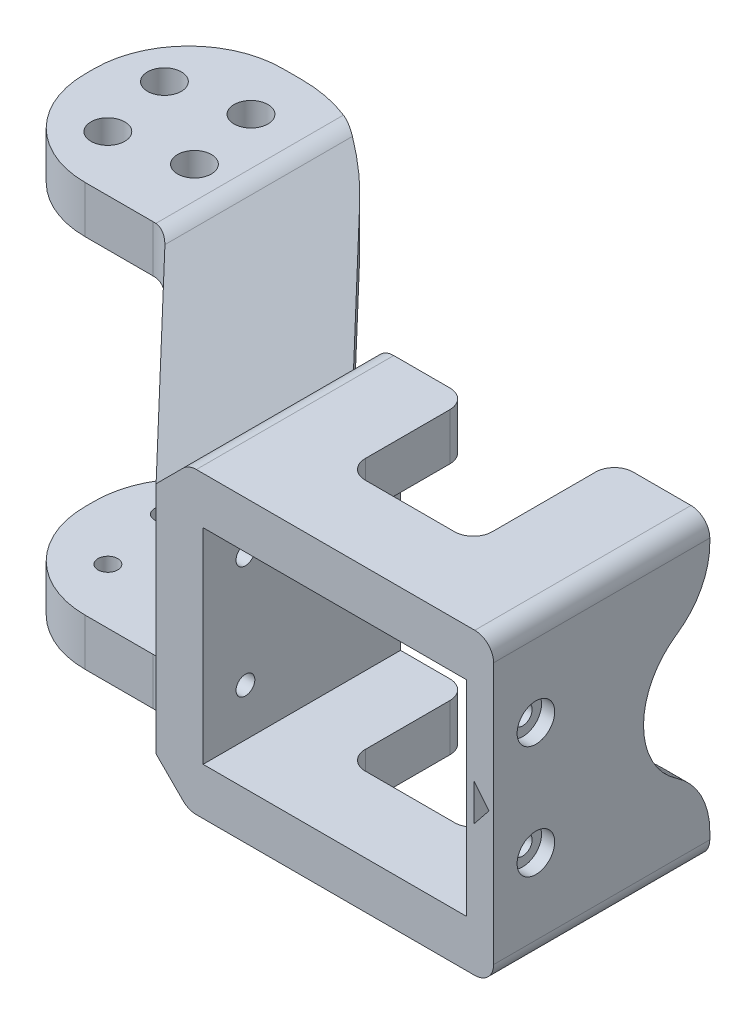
ISO-10303-21;
HEADER;
FILE_DESCRIPTION(('STEP AP214'),'2;1');
FILE_NAME('part.step','',(''),(''),'','','');
FILE_SCHEMA(('AUTOMOTIVE_DESIGN { 1 0 10303 214 1 1 1 1 }'));
ENDSEC;
DATA;
#1=APPLICATION_CONTEXT('core data for automotive mechanical design processes');
#2=APPLICATION_PROTOCOL_DEFINITION('international standard','automotive_design',2000,#1);
#3=PRODUCT_CONTEXT('',#1,'mechanical');
#4=PRODUCT('Part','Part','',(#3));
#5=PRODUCT_RELATED_PRODUCT_CATEGORY('part','',(#4));
#6=PRODUCT_DEFINITION_FORMATION('','',#4);
#7=PRODUCT_DEFINITION_CONTEXT('part definition',#1,'design');
#8=PRODUCT_DEFINITION('design','',#6,#7);
#9=PRODUCT_DEFINITION_SHAPE('','',#8);
#10=(LENGTH_UNIT() NAMED_UNIT(*) SI_UNIT(.MILLI.,.METRE.));
#11=(NAMED_UNIT(*) PLANE_ANGLE_UNIT() SI_UNIT($,.RADIAN.));
#12=(NAMED_UNIT(*) SI_UNIT($,.STERADIAN.) SOLID_ANGLE_UNIT());
#13=UNCERTAINTY_MEASURE_WITH_UNIT(LENGTH_MEASURE(1.E-05),#10,'distance_accuracy_value','');
#14=(GEOMETRIC_REPRESENTATION_CONTEXT(3) GLOBAL_UNCERTAINTY_ASSIGNED_CONTEXT((#13)) GLOBAL_UNIT_ASSIGNED_CONTEXT((#10,
#11,#12)) REPRESENTATION_CONTEXT('',''));
#15=CARTESIAN_POINT('',(0.,0.,0.));
#16=DIRECTION('',(0.,0.,1.));
#17=DIRECTION('',(1.,0.,0.));
#18=AXIS2_PLACEMENT_3D('',#15,#16,#17);
#19=CARTESIAN_POINT('',(1.1909734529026E-12,-1.19856976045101E-12,33.0158666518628));
#20=DIRECTION('',(0.,0.,1.));
#21=DIRECTION('',(0.,-1.,0.));
#22=AXIS2_PLACEMENT_3D('',#19,#20,#21);
#23=PLANE('',#22);
#24=DIRECTION('',(0.,-1.,0.));
#25=VECTOR('',#24,1.);
#26=CARTESIAN_POINT('',(61.5844949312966,-17.6404728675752,33.0158666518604));
#27=LINE('',#26,#25);
#28=CARTESIAN_POINT('',(61.5844949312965,-14.8531083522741,33.0158666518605));
#29=VERTEX_POINT('',#28);
#30=CARTESIAN_POINT('',(61.5844949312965,-15.640472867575,33.0158666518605));
#31=VERTEX_POINT('',#30);
#32=EDGE_CURVE('E914',#29,#31,#27,.T.);
#33=ORIENTED_EDGE('',*,*,#32,.T.);
#34=CARTESIAN_POINT('',(59.5844949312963,-15.640472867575,33.0158666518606));
#35=DIRECTION('',(0.,0.,1.));
#36=DIRECTION('',(0.,-1.,0.));
#37=AXIS2_PLACEMENT_3D('',#34,#35,#36);
#38=CIRCLE('',#37,2.);
#39=CARTESIAN_POINT('',(59.5844949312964,-17.6404728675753,33.0158666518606));
#40=VERTEX_POINT('',#39);
#41=EDGE_CURVE('E1448',#31,#40,#38,.F.);
#42=ORIENTED_EDGE('',*,*,#41,.T.);
#43=DIRECTION('',(-1.,0.,0.));
#44=VECTOR('',#43,1.);
#45=CARTESIAN_POINT('',(25.6844949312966,-17.6404728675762,33.0158666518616));
#46=LINE('',#45,#44);
#47=CARTESIAN_POINT('',(53.4344949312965,-17.6404728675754,33.0158666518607));
#48=VERTEX_POINT('',#47);
#49=EDGE_CURVE('E891',#40,#48,#46,.T.);
#50=ORIENTED_EDGE('',*,*,#49,.T.);
#51=DIRECTION('',(0.,1.,0.));
#52=VECTOR('',#51,1.);
#53=CARTESIAN_POINT('',(53.4344949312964,-12.6404728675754,33.0158666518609));
#54=LINE('',#53,#52);
#55=CARTESIAN_POINT('',(53.4344949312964,-14.8531083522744,33.0158666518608));
#56=VERTEX_POINT('',#55);
#57=EDGE_CURVE('E934',#48,#56,#54,.T.);
#58=ORIENTED_EDGE('',*,*,#57,.T.);
#59=DIRECTION('',(1.,0.,0.));
#60=VECTOR('',#59,1.);
#61=CARTESIAN_POINT('',(1.55396666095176E-12,-14.8531083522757,33.0158666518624));
#62=LINE('',#61,#60);
#63=EDGE_CURVE('E1419',#56,#29,#62,.T.);
#64=ORIENTED_EDGE('',*,*,#63,.T.);
#65=EDGE_LOOP('',(#33,#42,#50,#58,#64));
#66=FACE_BOUND('',#65,.T.);
#67=ADVANCED_FACE('F54',(#66),#23,.F.);
#68=CARTESIAN_POINT('',(8.26892499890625,-28.8654728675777,34.5240594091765));
#69=DIRECTION('',(0.,1.,0.));
#70=DIRECTION('',(-1.,0.,0.));
#71=AXIS2_PLACEMENT_3D('',#68,#69,#70);
#72=CYLINDRICAL_SURFACE('',#71,1.05);
#73=CARTESIAN_POINT('',(8.26892499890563,15.6895286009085,34.5240594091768));
#74=DIRECTION('',(0.,-1.,0.));
#75=DIRECTION('',(0.,0.,-1.));
#76=AXIS2_PLACEMENT_3D('',#73,#74,#75);
#77=CIRCLE('',#76,1.05);
#78=CARTESIAN_POINT('',(8.26892499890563,15.6895286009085,33.4740594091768));
#79=VERTEX_POINT('',#78);
#80=EDGE_CURVE('E796',#79,#79,#77,.F.);
#81=ORIENTED_EDGE('',*,*,#80,.F.);
#82=EDGE_LOOP('',(#81));
#83=FACE_BOUND('',#82,.T.);
#84=CARTESIAN_POINT('',(8.26892499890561,17.1895286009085,34.5240594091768));
#85=DIRECTION('',(0.,1.,0.));
#86=DIRECTION('',(0.,0.,1.));
#87=AXIS2_PLACEMENT_3D('',#84,#85,#86);
#88=CIRCLE('',#87,1.05);
#89=CARTESIAN_POINT('',(8.26892499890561,17.1895286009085,35.5740594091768));
#90=VERTEX_POINT('',#89);
#91=EDGE_CURVE('E562',#90,#90,#88,.T.);
#92=ORIENTED_EDGE('',*,*,#91,.T.);
#93=EDGE_LOOP('',(#92));
#94=FACE_BOUND('',#93,.T.);
#95=ADVANCED_FACE('F1663',(#83,#94),#72,.F.);
#96=CARTESIAN_POINT('',(0.656302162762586,-28.8654728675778,36.1202967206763));
#97=DIRECTION('',(0.,1.,0.));
#98=DIRECTION('',(-1.,0.,0.));
#99=AXIS2_PLACEMENT_3D('',#96,#97,#98);
#100=CYLINDRICAL_SURFACE('',#99,1.05);
#101=CARTESIAN_POINT('',(0.656302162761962,15.6895286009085,36.1202967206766));
#102=DIRECTION('',(0.,-1.,0.));
#103=DIRECTION('',(0.,0.,-1.));
#104=AXIS2_PLACEMENT_3D('',#101,#102,#103);
#105=CIRCLE('',#104,1.05);
#106=CARTESIAN_POINT('',(0.656302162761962,15.6895286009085,35.0702967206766));
#107=VERTEX_POINT('',#106);
#108=EDGE_CURVE('E800',#107,#107,#105,.F.);
#109=ORIENTED_EDGE('',*,*,#108,.F.);
#110=EDGE_LOOP('',(#109));
#111=FACE_BOUND('',#110,.T.);
#112=CARTESIAN_POINT('',(0.656302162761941,17.1895286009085,36.1202967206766));
#113=DIRECTION('',(0.,1.,0.));
#114=DIRECTION('',(0.,0.,1.));
#115=AXIS2_PLACEMENT_3D('',#112,#113,#114);
#116=CIRCLE('',#115,1.05);
#117=CARTESIAN_POINT('',(0.656302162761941,17.1895286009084,37.1702967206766));
#118=VERTEX_POINT('',#117);
#119=EDGE_CURVE('E1613',#118,#118,#116,.T.);
#120=ORIENTED_EDGE('',*,*,#119,.T.);
#121=EDGE_LOOP('',(#120));
#122=FACE_BOUND('',#121,.T.);
#123=ADVANCED_FACE('F1666',(#111,#122),#100,.F.);
#124=CARTESIAN_POINT('',(-0.939935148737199,-28.8654728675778,28.5076738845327));
#125=DIRECTION('',(0.,1.,0.));
#126=DIRECTION('',(-1.,0.,0.));
#127=AXIS2_PLACEMENT_3D('',#124,#125,#126);
#128=CYLINDRICAL_SURFACE('',#127,1.05);
#129=CARTESIAN_POINT('',(-0.939935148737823,15.6895286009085,28.507673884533));
#130=DIRECTION('',(0.,-1.,0.));
#131=DIRECTION('',(0.,0.,-1.));
#132=AXIS2_PLACEMENT_3D('',#129,#130,#131);
#133=CIRCLE('',#132,1.05);
#134=CARTESIAN_POINT('',(-0.939935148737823,15.6895286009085,27.457673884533));
#135=VERTEX_POINT('',#134);
#136=EDGE_CURVE('E804',#135,#135,#133,.F.);
#137=ORIENTED_EDGE('',*,*,#136,.F.);
#138=EDGE_LOOP('',(#137));
#139=FACE_BOUND('',#138,.T.);
#140=CARTESIAN_POINT('',(-0.939935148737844,17.1895286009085,28.507673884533));
#141=DIRECTION('',(0.,1.,0.));
#142=DIRECTION('',(0.,0.,1.));
#143=AXIS2_PLACEMENT_3D('',#140,#141,#142);
#144=CIRCLE('',#143,1.05);
#145=CARTESIAN_POINT('',(-0.939935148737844,17.1895286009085,29.557673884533));
#146=VERTEX_POINT('',#145);
#147=EDGE_CURVE('E1617',#146,#146,#144,.T.);
#148=ORIENTED_EDGE('',*,*,#147,.T.);
#149=EDGE_LOOP('',(#148));
#150=FACE_BOUND('',#149,.T.);
#151=ADVANCED_FACE('F1696',(#139,#150),#128,.F.);
#152=CARTESIAN_POINT('',(6.67268768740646,-28.8654728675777,26.9114365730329));
#153=DIRECTION('',(0.,1.,0.));
#154=DIRECTION('',(-1.,0.,0.));
#155=AXIS2_PLACEMENT_3D('',#152,#153,#154);
#156=CYLINDRICAL_SURFACE('',#155,1.05);
#157=CARTESIAN_POINT('',(6.67268768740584,15.6895286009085,26.9114365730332));
#158=DIRECTION('',(0.,-1.,0.));
#159=DIRECTION('',(0.,0.,-1.));
#160=AXIS2_PLACEMENT_3D('',#157,#158,#159);
#161=CIRCLE('',#160,1.05);
#162=CARTESIAN_POINT('',(6.67268768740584,15.6895286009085,25.8614365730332));
#163=VERTEX_POINT('',#162);
#164=EDGE_CURVE('E808',#163,#163,#161,.F.);
#165=ORIENTED_EDGE('',*,*,#164,.F.);
#166=EDGE_LOOP('',(#165));
#167=FACE_BOUND('',#166,.T.);
#168=CARTESIAN_POINT('',(6.67268768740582,17.1895286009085,26.9114365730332));
#169=DIRECTION('',(0.,1.,0.));
#170=DIRECTION('',(0.,0.,1.));
#171=AXIS2_PLACEMENT_3D('',#168,#169,#170);
#172=CIRCLE('',#171,1.05);
#173=CARTESIAN_POINT('',(6.67268768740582,17.1895286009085,27.9614365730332));
#174=VERTEX_POINT('',#173);
#175=EDGE_CURVE('E549',#174,#174,#172,.T.);
#176=ORIENTED_EDGE('',*,*,#175,.T.);
#177=EDGE_LOOP('',(#176));
#178=FACE_BOUND('',#177,.T.);
#179=ADVANCED_FACE('F1623',(#167,#178),#156,.F.);
#180=CARTESIAN_POINT('',(17.1844949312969,-7.59047286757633,51.5158666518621));
#181=DIRECTION('',(1.,0.,0.));
#182=DIRECTION('',(0.,0.,-1.));
#183=AXIS2_PLACEMENT_3D('',#180,#181,#182);
#184=CYLINDRICAL_SURFACE('',#183,0.999999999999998);
#185=CARTESIAN_POINT('',(58.6844949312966,-7.5904728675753,51.5158666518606));
#186=DIRECTION('',(-1.,0.,0.));
#187=DIRECTION('',(0.,0.,1.));
#188=AXIS2_PLACEMENT_3D('',#185,#186,#187);
#189=CIRCLE('',#188,0.999999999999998);
#190=CARTESIAN_POINT('',(58.6844949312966,-7.5904728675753,50.5158666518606));
#191=VERTEX_POINT('',#190);
#192=EDGE_CURVE('E583',#191,#191,#189,.T.);
#193=CARTESIAN_POINT('',(60.1844949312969,-7.59047286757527,51.5158666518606));
#194=DIRECTION('',(1.,0.,0.));
#195=DIRECTION('',(0.,0.,-1.));
#196=AXIS2_PLACEMENT_3D('',#193,#194,#195);
#197=CIRCLE('',#196,0.999999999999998);
#198=CARTESIAN_POINT('',(60.1844949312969,-7.59047286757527,50.5158666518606));
#199=VERTEX_POINT('',#198);
#200=EDGE_CURVE('E1133',#199,#199,#197,.F.);
#201=CARTESIAN_POINT('',(58.6844949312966,-7.5904728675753,50.5158666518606));
#202=CARTESIAN_POINT('',(58.7001199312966,-7.5904728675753,50.5158666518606));
#203=CARTESIAN_POINT('',(58.7157449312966,-7.5904728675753,50.5158666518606));
#204=CARTESIAN_POINT('',(58.7469949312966,-7.5904728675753,50.5158666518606));
#205=CARTESIAN_POINT('',(58.7626199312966,-7.5904728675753,50.5158666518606));
#206=CARTESIAN_POINT('',(58.7938699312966,-7.5904728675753,50.5158666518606));
#207=CARTESIAN_POINT('',(58.8094949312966,-7.5904728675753,50.5158666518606));
#208=CARTESIAN_POINT('',(58.8407449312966,-7.5904728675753,50.5158666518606));
#209=CARTESIAN_POINT('',(58.8563699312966,-7.5904728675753,50.5158666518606));
#210=CARTESIAN_POINT('',(58.8876199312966,-7.5904728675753,50.5158666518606));
#211=CARTESIAN_POINT('',(58.9032449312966,-7.5904728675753,50.5158666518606));
#212=CARTESIAN_POINT('',(58.9344949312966,-7.5904728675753,50.5158666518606));
#213=CARTESIAN_POINT('',(58.9501199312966,-7.5904728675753,50.5158666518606));
#214=CARTESIAN_POINT('',(58.9813699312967,-7.59047286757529,50.5158666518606));
#215=CARTESIAN_POINT('',(58.9969949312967,-7.59047286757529,50.5158666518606));
#216=CARTESIAN_POINT('',(59.0282449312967,-7.59047286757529,50.5158666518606));
#217=CARTESIAN_POINT('',(59.0438699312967,-7.59047286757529,50.5158666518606));
#218=CARTESIAN_POINT('',(59.0751199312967,-7.59047286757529,50.5158666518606));
#219=CARTESIAN_POINT('',(59.0907449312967,-7.59047286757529,50.5158666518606));
#220=CARTESIAN_POINT('',(59.1219949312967,-7.59047286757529,50.5158666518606));
#221=CARTESIAN_POINT('',(59.1376199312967,-7.59047286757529,50.5158666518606));
#222=CARTESIAN_POINT('',(59.1688699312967,-7.59047286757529,50.5158666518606));
#223=CARTESIAN_POINT('',(59.1844949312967,-7.59047286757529,50.5158666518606));
#224=CARTESIAN_POINT('',(59.2157449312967,-7.59047286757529,50.5158666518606));
#225=CARTESIAN_POINT('',(59.2313699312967,-7.59047286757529,50.5158666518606));
#226=CARTESIAN_POINT('',(59.2626199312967,-7.59047286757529,50.5158666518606));
#227=CARTESIAN_POINT('',(59.2782449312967,-7.59047286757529,50.5158666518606));
#228=CARTESIAN_POINT('',(59.3094949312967,-7.59047286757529,50.5158666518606));
#229=CARTESIAN_POINT('',(59.3251199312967,-7.59047286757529,50.5158666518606));
#230=CARTESIAN_POINT('',(59.3563699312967,-7.59047286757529,50.5158666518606));
#231=CARTESIAN_POINT('',(59.3719949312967,-7.59047286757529,50.5158666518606));
#232=CARTESIAN_POINT('',(59.4032449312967,-7.59047286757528,50.5158666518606));
#233=CARTESIAN_POINT('',(59.4188699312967,-7.59047286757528,50.5158666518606));
#234=CARTESIAN_POINT('',(59.4501199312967,-7.59047286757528,50.5158666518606));
#235=CARTESIAN_POINT('',(59.4657449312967,-7.59047286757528,50.5158666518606));
#236=CARTESIAN_POINT('',(59.4969949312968,-7.59047286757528,50.5158666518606));
#237=CARTESIAN_POINT('',(59.5126199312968,-7.59047286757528,50.5158666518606));
#238=CARTESIAN_POINT('',(59.5438699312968,-7.59047286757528,50.5158666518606));
#239=CARTESIAN_POINT('',(59.5594949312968,-7.59047286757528,50.5158666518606));
#240=CARTESIAN_POINT('',(59.5907449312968,-7.59047286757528,50.5158666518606));
#241=CARTESIAN_POINT('',(59.6063699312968,-7.59047286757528,50.5158666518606));
#242=CARTESIAN_POINT('',(59.6376199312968,-7.59047286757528,50.5158666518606));
#243=CARTESIAN_POINT('',(59.6532449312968,-7.59047286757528,50.5158666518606));
#244=CARTESIAN_POINT('',(59.6844949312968,-7.59047286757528,50.5158666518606));
#245=CARTESIAN_POINT('',(59.7001199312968,-7.59047286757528,50.5158666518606));
#246=CARTESIAN_POINT('',(59.7313699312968,-7.59047286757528,50.5158666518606));
#247=CARTESIAN_POINT('',(59.7469949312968,-7.59047286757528,50.5158666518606));
#248=CARTESIAN_POINT('',(59.7782449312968,-7.59047286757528,50.5158666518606));
#249=CARTESIAN_POINT('',(59.7938699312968,-7.59047286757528,50.5158666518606));
#250=CARTESIAN_POINT('',(59.8251199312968,-7.59047286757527,50.5158666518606));
#251=CARTESIAN_POINT('',(59.8407449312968,-7.59047286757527,50.5158666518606));
#252=CARTESIAN_POINT('',(59.8719949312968,-7.59047286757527,50.5158666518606));
#253=CARTESIAN_POINT('',(59.8876199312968,-7.59047286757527,50.5158666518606));
#254=CARTESIAN_POINT('',(59.9188699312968,-7.59047286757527,50.5158666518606));
#255=CARTESIAN_POINT('',(59.9344949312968,-7.59047286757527,50.5158666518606));
#256=CARTESIAN_POINT('',(59.9657449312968,-7.59047286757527,50.5158666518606));
#257=CARTESIAN_POINT('',(59.9813699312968,-7.59047286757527,50.5158666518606));
#258=CARTESIAN_POINT('',(60.0126199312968,-7.59047286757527,50.5158666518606));
#259=CARTESIAN_POINT('',(60.0282449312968,-7.59047286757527,50.5158666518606));
#260=CARTESIAN_POINT('',(60.0594949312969,-7.59047286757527,50.5158666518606));
#261=CARTESIAN_POINT('',(60.0751199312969,-7.59047286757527,50.5158666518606));
#262=CARTESIAN_POINT('',(60.1063699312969,-7.59047286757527,50.5158666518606));
#263=CARTESIAN_POINT('',(60.1219949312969,-7.59047286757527,50.5158666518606));
#264=CARTESIAN_POINT('',(60.1532449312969,-7.59047286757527,50.5158666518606));
#265=CARTESIAN_POINT('',(60.1688699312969,-7.59047286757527,50.5158666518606));
#266=CARTESIAN_POINT('',(60.1844949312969,-7.59047286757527,50.5158666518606));
#267=B_SPLINE_CURVE_WITH_KNOTS('',3,(#201,#202,#203,#204,#205,#206,#207,#208,#209,#210,#211,
#212,#213,#214,#215,#216,#217,#218,#219,#220,#221,#222,#223,#224,#225,#226,#227,#228,#229,#230,
#231,#232,#233,#234,#235,#236,#237,#238,#239,#240,#241,#242,#243,#244,#245,#246,#247,#248,#249,
#250,#251,#252,#253,#254,#255,#256,#257,#258,#259,#260,#261,#262,#263,#264,#265,#266),
.UNSPECIFIED.,.F.,.F.,(4,2,2,2,2,2,2,2,2,2,2,2,2,2,2,2,2,2,2,2,2,2,2,2,2,2,2,2,2,2,2,2,4),(0.,
0.0468750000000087,0.0937500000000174,0.140625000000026,0.187500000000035,0.234375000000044,
0.281250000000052,0.328125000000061,0.37500000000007,0.421875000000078,0.468750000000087,
0.515625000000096,0.562500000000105,0.609375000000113,0.656250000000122,0.703125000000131,
0.750000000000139,0.796875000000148,0.843750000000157,0.890625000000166,0.937500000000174,
0.984375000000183,1.03125000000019,1.0781250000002,1.12500000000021,1.17187500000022,
1.21875000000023,1.26562500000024,1.31250000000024,1.35937500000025,1.40625000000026,
1.45312500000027,1.50000000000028),.UNSPECIFIED.);
#268=EDGE_CURVE('BSEAM1702',#191,#199,#267,.T.);
#269=ORIENTED_EDGE('',*,*,#192,.T.);
#270=ORIENTED_EDGE('',*,*,#200,.F.);
#271=ORIENTED_EDGE('',*,*,#268,.T.);
#272=ORIENTED_EDGE('',*,*,#268,.F.);
#273=EDGE_LOOP('',(#269,#271,#270,#272));
#274=FACE_BOUND('',#273,.T.);
#275=ADVANCED_FACE('F1702',(#274),#184,.F.);
#276=CARTESIAN_POINT('',(17.1844949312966,4.40952713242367,51.5158666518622));
#277=DIRECTION('',(1.,0.,0.));
#278=DIRECTION('',(0.,0.,-1.));
#279=AXIS2_PLACEMENT_3D('',#276,#277,#278);
#280=CYLINDRICAL_SURFACE('',#279,0.999999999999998);
#281=CARTESIAN_POINT('',(58.6844949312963,4.4095271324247,51.5158666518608));
#282=DIRECTION('',(-1.,0.,0.));
#283=DIRECTION('',(0.,0.,1.));
#284=AXIS2_PLACEMENT_3D('',#281,#282,#283);
#285=CIRCLE('',#284,0.999999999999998);
#286=CARTESIAN_POINT('',(58.6844949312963,4.4095271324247,50.5158666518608));
#287=VERTEX_POINT('',#286);
#288=EDGE_CURVE('E589',#287,#287,#285,.T.);
#289=CARTESIAN_POINT('',(60.1844949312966,4.40952713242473,51.5158666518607));
#290=DIRECTION('',(1.,0.,0.));
#291=DIRECTION('',(0.,0.,-1.));
#292=AXIS2_PLACEMENT_3D('',#289,#290,#291);
#293=CIRCLE('',#292,0.999999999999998);
#294=CARTESIAN_POINT('',(60.1844949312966,4.40952713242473,50.5158666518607));
#295=VERTEX_POINT('',#294);
#296=EDGE_CURVE('E577',#295,#295,#293,.F.);
#297=CARTESIAN_POINT('',(58.6844949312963,4.4095271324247,50.5158666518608));
#298=CARTESIAN_POINT('',(58.7001199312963,4.4095271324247,50.5158666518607));
#299=CARTESIAN_POINT('',(58.7157449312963,4.4095271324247,50.5158666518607));
#300=CARTESIAN_POINT('',(58.7469949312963,4.4095271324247,50.5158666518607));
#301=CARTESIAN_POINT('',(58.7626199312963,4.4095271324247,50.5158666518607));
#302=CARTESIAN_POINT('',(58.7938699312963,4.4095271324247,50.5158666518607));
#303=CARTESIAN_POINT('',(58.8094949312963,4.4095271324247,50.5158666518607));
#304=CARTESIAN_POINT('',(58.8407449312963,4.4095271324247,50.5158666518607));
#305=CARTESIAN_POINT('',(58.8563699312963,4.4095271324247,50.5158666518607));
#306=CARTESIAN_POINT('',(58.8876199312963,4.4095271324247,50.5158666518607));
#307=CARTESIAN_POINT('',(58.9032449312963,4.4095271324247,50.5158666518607));
#308=CARTESIAN_POINT('',(58.9344949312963,4.4095271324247,50.5158666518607));
#309=CARTESIAN_POINT('',(58.9501199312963,4.4095271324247,50.5158666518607));
#310=CARTESIAN_POINT('',(58.9813699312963,4.40952713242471,50.5158666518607));
#311=CARTESIAN_POINT('',(58.9969949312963,4.40952713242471,50.5158666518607));
#312=CARTESIAN_POINT('',(59.0282449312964,4.40952713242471,50.5158666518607));
#313=CARTESIAN_POINT('',(59.0438699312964,4.40952713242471,50.5158666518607));
#314=CARTESIAN_POINT('',(59.0751199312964,4.40952713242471,50.5158666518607));
#315=CARTESIAN_POINT('',(59.0907449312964,4.40952713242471,50.5158666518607));
#316=CARTESIAN_POINT('',(59.1219949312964,4.40952713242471,50.5158666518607));
#317=CARTESIAN_POINT('',(59.1376199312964,4.40952713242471,50.5158666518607));
#318=CARTESIAN_POINT('',(59.1688699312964,4.40952713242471,50.5158666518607));
#319=CARTESIAN_POINT('',(59.1844949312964,4.40952713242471,50.5158666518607));
#320=CARTESIAN_POINT('',(59.2157449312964,4.40952713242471,50.5158666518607));
#321=CARTESIAN_POINT('',(59.2313699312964,4.40952713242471,50.5158666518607));
#322=CARTESIAN_POINT('',(59.2626199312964,4.40952713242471,50.5158666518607));
#323=CARTESIAN_POINT('',(59.2782449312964,4.40952713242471,50.5158666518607));
#324=CARTESIAN_POINT('',(59.3094949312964,4.40952713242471,50.5158666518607));
#325=CARTESIAN_POINT('',(59.3251199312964,4.40952713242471,50.5158666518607));
#326=CARTESIAN_POINT('',(59.3563699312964,4.40952713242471,50.5158666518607));
#327=CARTESIAN_POINT('',(59.3719949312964,4.40952713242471,50.5158666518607));
#328=CARTESIAN_POINT('',(59.4032449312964,4.40952713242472,50.5158666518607));
#329=CARTESIAN_POINT('',(59.4188699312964,4.40952713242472,50.5158666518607));
#330=CARTESIAN_POINT('',(59.4501199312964,4.40952713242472,50.5158666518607));
#331=CARTESIAN_POINT('',(59.4657449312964,4.40952713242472,50.5158666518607));
#332=CARTESIAN_POINT('',(59.4969949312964,4.40952713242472,50.5158666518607));
#333=CARTESIAN_POINT('',(59.5126199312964,4.40952713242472,50.5158666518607));
#334=CARTESIAN_POINT('',(59.5438699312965,4.40952713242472,50.5158666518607));
#335=CARTESIAN_POINT('',(59.5594949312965,4.40952713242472,50.5158666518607));
#336=CARTESIAN_POINT('',(59.5907449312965,4.40952713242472,50.5158666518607));
#337=CARTESIAN_POINT('',(59.6063699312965,4.40952713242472,50.5158666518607));
#338=CARTESIAN_POINT('',(59.6376199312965,4.40952713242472,50.5158666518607));
#339=CARTESIAN_POINT('',(59.6532449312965,4.40952713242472,50.5158666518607));
#340=CARTESIAN_POINT('',(59.6844949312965,4.40952713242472,50.5158666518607));
#341=CARTESIAN_POINT('',(59.7001199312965,4.40952713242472,50.5158666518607));
#342=CARTESIAN_POINT('',(59.7313699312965,4.40952713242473,50.5158666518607));
#343=CARTESIAN_POINT('',(59.7469949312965,4.40952713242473,50.5158666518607));
#344=CARTESIAN_POINT('',(59.7782449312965,4.40952713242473,50.5158666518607));
#345=CARTESIAN_POINT('',(59.7938699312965,4.40952713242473,50.5158666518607));
#346=CARTESIAN_POINT('',(59.8251199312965,4.40952713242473,50.5158666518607));
#347=CARTESIAN_POINT('',(59.8407449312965,4.40952713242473,50.5158666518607));
#348=CARTESIAN_POINT('',(59.8719949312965,4.40952713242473,50.5158666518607));
#349=CARTESIAN_POINT('',(59.8876199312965,4.40952713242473,50.5158666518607));
#350=CARTESIAN_POINT('',(59.9188699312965,4.40952713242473,50.5158666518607));
#351=CARTESIAN_POINT('',(59.9344949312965,4.40952713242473,50.5158666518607));
#352=CARTESIAN_POINT('',(59.9657449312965,4.40952713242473,50.5158666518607));
#353=CARTESIAN_POINT('',(59.9813699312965,4.40952713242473,50.5158666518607));
#354=CARTESIAN_POINT('',(60.0126199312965,4.40952713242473,50.5158666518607));
#355=CARTESIAN_POINT('',(60.0282449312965,4.40952713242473,50.5158666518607));
#356=CARTESIAN_POINT('',(60.0594949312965,4.40952713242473,50.5158666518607));
#357=CARTESIAN_POINT('',(60.0751199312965,4.40952713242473,50.5158666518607));
#358=CARTESIAN_POINT('',(60.1063699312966,4.40952713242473,50.5158666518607));
#359=CARTESIAN_POINT('',(60.1219949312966,4.40952713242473,50.5158666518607));
#360=CARTESIAN_POINT('',(60.1532449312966,4.40952713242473,50.5158666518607));
#361=CARTESIAN_POINT('',(60.1688699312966,4.40952713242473,50.5158666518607));
#362=CARTESIAN_POINT('',(60.1844949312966,4.40952713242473,50.5158666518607));
#363=B_SPLINE_CURVE_WITH_KNOTS('',3,(#297,#298,#299,#300,#301,#302,#303,#304,#305,#306,#307,
#308,#309,#310,#311,#312,#313,#314,#315,#316,#317,#318,#319,#320,#321,#322,#323,#324,#325,#326,
#327,#328,#329,#330,#331,#332,#333,#334,#335,#336,#337,#338,#339,#340,#341,#342,#343,#344,#345,
#346,#347,#348,#349,#350,#351,#352,#353,#354,#355,#356,#357,#358,#359,#360,#361,#362),
.UNSPECIFIED.,.F.,.F.,(4,2,2,2,2,2,2,2,2,2,2,2,2,2,2,2,2,2,2,2,2,2,2,2,2,2,2,2,2,2,2,2,4),(0.,
0.0468750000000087,0.0937500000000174,0.140625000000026,0.187500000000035,0.234375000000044,
0.281250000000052,0.328125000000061,0.37500000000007,0.421875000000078,0.468750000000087,
0.515625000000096,0.562500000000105,0.609375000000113,0.656250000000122,0.703125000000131,
0.750000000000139,0.796875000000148,0.843750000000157,0.890625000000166,0.937500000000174,
0.984375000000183,1.03125000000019,1.0781250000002,1.12500000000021,1.17187500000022,
1.21875000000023,1.26562500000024,1.31250000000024,1.35937500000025,1.40625000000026,
1.45312500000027,1.50000000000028),.UNSPECIFIED.);
#364=EDGE_CURVE('BSEAM2178',#287,#295,#363,.T.);
#365=ORIENTED_EDGE('',*,*,#288,.T.);
#366=ORIENTED_EDGE('',*,*,#296,.F.);
#367=ORIENTED_EDGE('',*,*,#364,.T.);
#368=ORIENTED_EDGE('',*,*,#364,.F.);
#369=EDGE_LOOP('',(#365,#367,#366,#368));
#370=FACE_BOUND('',#369,.T.);
#371=ADVANCED_FACE('F2178',(#370),#280,.F.);
#372=CARTESIAN_POINT('',(8.26892499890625,-28.8654728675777,34.5240594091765));
#373=DIRECTION('',(0.,1.,0.));
#374=DIRECTION('',(-1.,0.,0.));
#375=AXIS2_PLACEMENT_3D('',#372,#373,#374);
#376=CYLINDRICAL_SURFACE('',#375,1.05);
#377=CARTESIAN_POINT('',(8.26892499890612,-19.1704743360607,34.5240594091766));
#378=DIRECTION('',(0.,-1.,0.));
#379=DIRECTION('',(0.,0.,-1.));
#380=AXIS2_PLACEMENT_3D('',#377,#378,#379);
#381=CIRCLE('',#380,1.05);
#382=CARTESIAN_POINT('',(8.26892499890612,-19.1704743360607,33.4740594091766));
#383=VERTEX_POINT('',#382);
#384=EDGE_CURVE('E690',#383,#383,#381,.F.);
#385=ORIENTED_EDGE('',*,*,#384,.T.);
#386=EDGE_LOOP('',(#385));
#387=FACE_BOUND('',#386,.T.);
#388=CARTESIAN_POINT('',(8.26892499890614,-20.6704743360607,34.5240594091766));
#389=DIRECTION('',(0.,-1.,0.));
#390=DIRECTION('',(0.,0.,-1.));
#391=AXIS2_PLACEMENT_3D('',#388,#389,#390);
#392=CIRCLE('',#391,1.05);
#393=CARTESIAN_POINT('',(8.26892499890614,-20.6704743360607,33.4740594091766));
#394=VERTEX_POINT('',#393);
#395=EDGE_CURVE('E636',#394,#394,#392,.T.);
#396=ORIENTED_EDGE('',*,*,#395,.T.);
#397=EDGE_LOOP('',(#396));
#398=FACE_BOUND('',#397,.T.);
#399=ADVANCED_FACE('F2171',(#387,#398),#376,.F.);
#400=CARTESIAN_POINT('',(0.656302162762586,-28.8654728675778,36.1202967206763));
#401=DIRECTION('',(0.,1.,0.));
#402=DIRECTION('',(-1.,0.,0.));
#403=AXIS2_PLACEMENT_3D('',#400,#401,#402);
#404=CYLINDRICAL_SURFACE('',#403,1.05);
#405=CARTESIAN_POINT('',(0.65630216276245,-19.1704743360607,36.1202967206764));
#406=DIRECTION('',(0.,-1.,0.));
#407=DIRECTION('',(0.,0.,-1.));
#408=AXIS2_PLACEMENT_3D('',#405,#406,#407);
#409=CIRCLE('',#408,1.05);
#410=CARTESIAN_POINT('',(0.65630216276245,-19.1704743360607,35.0702967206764));
#411=VERTEX_POINT('',#410);
#412=EDGE_CURVE('E700',#411,#411,#409,.F.);
#413=ORIENTED_EDGE('',*,*,#412,.T.);
#414=EDGE_LOOP('',(#413));
#415=FACE_BOUND('',#414,.T.);
#416=CARTESIAN_POINT('',(0.656302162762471,-20.6704743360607,36.1202967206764));
#417=DIRECTION('',(0.,-1.,0.));
#418=DIRECTION('',(0.,0.,-1.));
#419=AXIS2_PLACEMENT_3D('',#416,#417,#418);
#420=CIRCLE('',#419,1.05);
#421=CARTESIAN_POINT('',(0.656302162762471,-20.6704743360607,35.0702967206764));
#422=VERTEX_POINT('',#421);
#423=EDGE_CURVE('E1043',#422,#422,#420,.T.);
#424=ORIENTED_EDGE('',*,*,#423,.T.);
#425=EDGE_LOOP('',(#424));
#426=FACE_BOUND('',#425,.T.);
#427=ADVANCED_FACE('F2177',(#415,#426),#404,.F.);
#428=CARTESIAN_POINT('',(-0.939935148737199,-28.8654728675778,28.5076738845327));
#429=DIRECTION('',(0.,1.,0.));
#430=DIRECTION('',(-1.,0.,0.));
#431=AXIS2_PLACEMENT_3D('',#428,#429,#430);
#432=CYLINDRICAL_SURFACE('',#431,1.05);
#433=CARTESIAN_POINT('',(-0.939935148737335,-19.1704743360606,28.5076738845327));
#434=DIRECTION('',(0.,-1.,0.));
#435=DIRECTION('',(0.,0.,-1.));
#436=AXIS2_PLACEMENT_3D('',#433,#434,#435);
#437=CIRCLE('',#436,1.05);
#438=CARTESIAN_POINT('',(-0.939935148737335,-19.1704743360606,27.4576738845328));
#439=VERTEX_POINT('',#438);
#440=EDGE_CURVE('E696',#439,#439,#437,.F.);
#441=ORIENTED_EDGE('',*,*,#440,.T.);
#442=EDGE_LOOP('',(#441));
#443=FACE_BOUND('',#442,.T.);
#444=CARTESIAN_POINT('',(-0.939935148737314,-20.6704743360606,28.5076738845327));
#445=DIRECTION('',(0.,-1.,0.));
#446=DIRECTION('',(0.,0.,-1.));
#447=AXIS2_PLACEMENT_3D('',#444,#445,#446);
#448=CIRCLE('',#447,1.05);
#449=CARTESIAN_POINT('',(-0.939935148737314,-20.6704743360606,27.4576738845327));
#450=VERTEX_POINT('',#449);
#451=EDGE_CURVE('E1040',#450,#450,#448,.T.);
#452=ORIENTED_EDGE('',*,*,#451,.T.);
#453=EDGE_LOOP('',(#452));
#454=FACE_BOUND('',#453,.T.);
#455=ADVANCED_FACE('F1677',(#443,#454),#432,.F.);
#456=CARTESIAN_POINT('',(6.67268768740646,-28.8654728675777,26.9114365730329));
#457=DIRECTION('',(0.,1.,0.));
#458=DIRECTION('',(-1.,0.,0.));
#459=AXIS2_PLACEMENT_3D('',#456,#457,#458);
#460=CYLINDRICAL_SURFACE('',#459,1.05);
#461=CARTESIAN_POINT('',(6.67268768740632,-19.1704743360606,26.911436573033));
#462=DIRECTION('',(0.,-1.,0.));
#463=DIRECTION('',(0.,0.,-1.));
#464=AXIS2_PLACEMENT_3D('',#461,#462,#463);
#465=CIRCLE('',#464,1.05);
#466=CARTESIAN_POINT('',(6.67268768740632,-19.1704743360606,25.861436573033));
#467=VERTEX_POINT('',#466);
#468=EDGE_CURVE('E691',#467,#467,#465,.F.);
#469=ORIENTED_EDGE('',*,*,#468,.T.);
#470=EDGE_LOOP('',(#469));
#471=FACE_BOUND('',#470,.T.);
#472=CARTESIAN_POINT('',(6.67268768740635,-20.6704743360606,26.9114365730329));
#473=DIRECTION('',(0.,-1.,0.));
#474=DIRECTION('',(0.,0.,-1.));
#475=AXIS2_PLACEMENT_3D('',#472,#473,#474);
#476=CIRCLE('',#475,1.05);
#477=CARTESIAN_POINT('',(6.67268768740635,-20.6704743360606,25.8614365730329));
#478=VERTEX_POINT('',#477);
#479=EDGE_CURVE('E627',#478,#478,#476,.T.);
#480=ORIENTED_EDGE('',*,*,#479,.T.);
#481=EDGE_LOOP('',(#480));
#482=FACE_BOUND('',#481,.T.);
#483=ADVANCED_FACE('F1673',(#471,#482),#460,.F.);
#484=CARTESIAN_POINT('',(25.6844949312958,14.1595271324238,41.0158666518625));
#485=DIRECTION('',(1.,0.,0.));
#486=DIRECTION('',(0.,0.,-1.));
#487=AXIS2_PLACEMENT_3D('',#484,#485,#486);
#488=PLANE('',#487);
#489=DIRECTION('',(0.,0.,1.));
#490=VECTOR('',#489,1.);
#491=CARTESIAN_POINT('',(25.684494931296,5.75952713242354,56.0158666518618));
#492=LINE('',#491,#490);
#493=CARTESIAN_POINT('',(25.684494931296,5.75952713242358,52.9915021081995));
#494=VERTEX_POINT('',#493);
#495=CARTESIAN_POINT('',(25.684494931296,5.75952713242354,56.0158666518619));
#496=VERTEX_POINT('',#495);
#497=EDGE_CURVE('E776',#494,#496,#492,.T.);
#498=ORIENTED_EDGE('',*,*,#497,.F.);
#499=CARTESIAN_POINT('',(25.6844949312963,4.40952713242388,51.5158666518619));
#500=DIRECTION('',(1.,0.,0.));
#501=DIRECTION('',(0.,0.,-1.));
#502=AXIS2_PLACEMENT_3D('',#499,#500,#501);
#503=CIRCLE('',#502,2.);
#504=CARTESIAN_POINT('',(25.684494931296,5.75952713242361,50.0402311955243));
#505=VERTEX_POINT('',#504);
#506=EDGE_CURVE('E567',#494,#505,#503,.T.);
#507=ORIENTED_EDGE('',*,*,#506,.T.);
#508=CARTESIAN_POINT('',(25.684494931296,5.7595271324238,35.0158666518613));
#509=VERTEX_POINT('',#508);
#510=EDGE_CURVE('E778',#509,#505,#492,.T.);
#511=ORIENTED_EDGE('',*,*,#510,.F.);
#512=DIRECTION('',(0.,1.,0.));
#513=VECTOR('',#512,1.);
#514=CARTESIAN_POINT('',(25.6844949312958,14.1595271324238,35.0158666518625));
#515=LINE('',#514,#513);
#516=CARTESIAN_POINT('',(25.6844949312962,-9.24047286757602,35.015866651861));
#517=VERTEX_POINT('',#516);
#518=EDGE_CURVE('E918',#517,#509,#515,.T.);
#519=ORIENTED_EDGE('',*,*,#518,.F.);
#520=DIRECTION('',(0.,0.,1.));
#521=VECTOR('',#520,1.);
#522=CARTESIAN_POINT('',(25.684494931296,-9.24047286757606,56.0158666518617));
#523=LINE('',#522,#521);
#524=CARTESIAN_POINT('',(25.684494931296,-9.24047286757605,50.3856011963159));
#525=VERTEX_POINT('',#524);
#526=EDGE_CURVE('E722',#517,#525,#523,.T.);
#527=ORIENTED_EDGE('',*,*,#526,.T.);
#528=CARTESIAN_POINT('',(25.6844949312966,-7.59047286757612,51.5158666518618));
#529=DIRECTION('',(1.,0.,0.));
#530=DIRECTION('',(0.,0.,-1.));
#531=AXIS2_PLACEMENT_3D('',#528,#529,#530);
#532=CIRCLE('',#531,2.);
#533=CARTESIAN_POINT('',(25.684494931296,-9.24047286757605,52.6461321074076));
#534=VERTEX_POINT('',#533);
#535=EDGE_CURVE('E563',#525,#534,#532,.T.);
#536=ORIENTED_EDGE('',*,*,#535,.T.);
#537=CARTESIAN_POINT('',(25.6844949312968,-9.24047286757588,56.0158666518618));
#538=VERTEX_POINT('',#537);
#539=EDGE_CURVE('E727',#534,#538,#523,.T.);
#540=ORIENTED_EDGE('',*,*,#539,.T.);
#541=DIRECTION('',(0.,1.,0.));
#542=VECTOR('',#541,1.);
#543=CARTESIAN_POINT('',(25.6844949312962,14.1595271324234,56.0158666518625));
#544=LINE('',#543,#542);
#545=EDGE_CURVE('E763',#538,#496,#544,.T.);
#546=ORIENTED_EDGE('',*,*,#545,.T.);
#547=EDGE_LOOP('',(#498,#507,#511,#519,#527,#536,#540,#546));
#548=FACE_BOUND('',#547,.T.);
#549=ADVANCED_FACE('F1475',(#548),#488,.F.);
#550=DIRECTION('',(1.,0.,0.));
#551=VECTOR('',#550,1.);
#552=CARTESIAN_POINT('',(25.6844949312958,14.1595271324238,33.0158666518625));
#553=LINE('',#552,#551);
#554=CARTESIAN_POINT('',(53.4344949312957,14.1595271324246,33.0158666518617));
#555=VERTEX_POINT('',#554);
#556=CARTESIAN_POINT('',(59.5844949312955,14.1595271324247,33.0158666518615));
#557=VERTEX_POINT('',#556);
#558=EDGE_CURVE('E894',#555,#557,#553,.T.);
#559=ORIENTED_EDGE('',*,*,#558,.T.);
#560=CARTESIAN_POINT('',(59.5844949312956,12.159527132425,33.0158666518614));
#561=DIRECTION('',(0.,0.,1.));
#562=DIRECTION('',(0.,-1.,0.));
#563=AXIS2_PLACEMENT_3D('',#560,#561,#562);
#564=CIRCLE('',#563,2.);
#565=CARTESIAN_POINT('',(61.5844949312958,12.159527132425,33.0158666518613));
#566=VERTEX_POINT('',#565);
#567=EDGE_CURVE('E1441',#557,#566,#564,.F.);
#568=ORIENTED_EDGE('',*,*,#567,.T.);
#569=DIRECTION('',(0.,-1.,0.));
#570=VECTOR('',#569,1.);
#571=CARTESIAN_POINT('',(61.5844949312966,-17.6404728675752,33.0158666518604));
#572=LINE('',#571,#570);
#573=CARTESIAN_POINT('',(61.5844949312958,11.6721626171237,33.0158666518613));
#574=VERTEX_POINT('',#573);
#575=EDGE_CURVE('E777',#566,#574,#572,.T.);
#576=ORIENTED_EDGE('',*,*,#575,.T.);
#577=DIRECTION('',(1.,0.,0.));
#578=VECTOR('',#577,1.);
#579=CARTESIAN_POINT('',(9.05718969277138E-13,11.6721626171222,33.0158666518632));
#580=LINE('',#579,#578);
#581=CARTESIAN_POINT('',(53.4344949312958,11.6721626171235,33.0158666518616));
#582=VERTEX_POINT('',#581);
#583=EDGE_CURVE('E1366',#574,#582,#580,.F.);
#584=ORIENTED_EDGE('',*,*,#583,.T.);
#585=DIRECTION('',(0.,1.,0.));
#586=VECTOR('',#585,1.);
#587=CARTESIAN_POINT('',(53.4344949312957,14.1595271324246,33.0158666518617));
#588=LINE('',#587,#586);
#589=EDGE_CURVE('E911',#582,#555,#588,.T.);
#590=ORIENTED_EDGE('',*,*,#589,.T.);
#591=EDGE_LOOP('',(#559,#568,#576,#584,#590));
#592=FACE_BOUND('',#591,.T.);
#593=ADVANCED_FACE('F1542',(#592),#23,.F.);
#594=CARTESIAN_POINT('',(-5.86550506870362,20.6895286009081,92.6816575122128));
#595=DIRECTION('',(0.,1.,0.));
#596=DIRECTION('',(0.,0.,1.));
#597=AXIS2_PLACEMENT_3D('',#594,#595,#596);
#598=PLANE('',#597);
#599=CARTESIAN_POINT('',(-0.939935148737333,20.6895286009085,28.507673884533));
#600=DIRECTION('',(0.,1.,0.));
#601=DIRECTION('',(0.,0.,1.));
#602=AXIS2_PLACEMENT_3D('',#599,#600,#601);
#603=CIRCLE('',#602,1.8);
#604=CARTESIAN_POINT('',(-0.939935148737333,20.6895286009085,30.307673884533));
#605=VERTEX_POINT('',#604);
#606=EDGE_CURVE('E518',#605,#605,#603,.T.);
#607=ORIENTED_EDGE('',*,*,#606,.F.);
#608=EDGE_LOOP('',(#607));
#609=FACE_BOUND('',#608,.T.);
#610=CARTESIAN_POINT('',(6.67268768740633,20.6895286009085,26.9114365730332));
#611=DIRECTION('',(0.,1.,0.));
#612=DIRECTION('',(0.,0.,1.));
#613=AXIS2_PLACEMENT_3D('',#610,#611,#612);
#614=CIRCLE('',#613,1.8);
#615=CARTESIAN_POINT('',(6.67268768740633,20.6895286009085,28.7114365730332));
#616=VERTEX_POINT('',#615);
#617=EDGE_CURVE('E534',#616,#616,#614,.T.);
#618=ORIENTED_EDGE('',*,*,#617,.F.);
#619=EDGE_LOOP('',(#618));
#620=FACE_BOUND('',#619,.T.);
#621=CARTESIAN_POINT('',(8.26892499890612,20.6895286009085,34.5240594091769));
#622=DIRECTION('',(0.,1.,0.));
#623=DIRECTION('',(0.,0.,1.));
#624=AXIS2_PLACEMENT_3D('',#621,#622,#623);
#625=CIRCLE('',#624,1.8);
#626=CARTESIAN_POINT('',(8.26892499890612,20.6895286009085,36.3240594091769));
#627=VERTEX_POINT('',#626);
#628=EDGE_CURVE('E526',#627,#627,#625,.T.);
#629=ORIENTED_EDGE('',*,*,#628,.F.);
#630=EDGE_LOOP('',(#629));
#631=FACE_BOUND('',#630,.T.);
#632=CARTESIAN_POINT('',(0.656302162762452,20.6895286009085,36.1202967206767));
#633=DIRECTION('',(0.,1.,0.));
#634=DIRECTION('',(0.,0.,1.));
#635=AXIS2_PLACEMENT_3D('',#632,#633,#634);
#636=CIRCLE('',#635,1.8);
#637=CARTESIAN_POINT('',(0.656302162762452,20.6895286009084,37.9202967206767));
#638=VERTEX_POINT('',#637);
#639=EDGE_CURVE('E525',#638,#638,#636,.T.);
#640=ORIENTED_EDGE('',*,*,#639,.F.);
#641=EDGE_LOOP('',(#640));
#642=FACE_BOUND('',#641,.T.);
#643=DIRECTION('',(0.,0.,-1.));
#644=VECTOR('',#643,1.);
#645=CARTESIAN_POINT('',(11.6678176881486,20.6895286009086,21.0158666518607));
#646=LINE('',#645,#644);
#647=CARTESIAN_POINT('',(11.6678176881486,20.6895286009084,42.0300653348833));
#648=VERTEX_POINT('',#647);
#649=CARTESIAN_POINT('',(11.6678176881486,20.6895286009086,22.0702083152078));
#650=VERTEX_POINT('',#649);
#651=EDGE_CURVE('E1210',#648,#650,#646,.T.);
#652=ORIENTED_EDGE('',*,*,#651,.T.);
#653=CARTESIAN_POINT('',(6.14345224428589,20.6895286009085,36.0158666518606));
#654=DIRECTION('',(0.,1.,0.));
#655=DIRECTION('',(0.,0.,1.));
#656=AXIS2_PLACEMENT_3D('',#653,#654,#655);
#657=CIRCLE('',#656,15.);
#658=CARTESIAN_POINT('',(6.143452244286,20.6895286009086,21.0158666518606));
#659=VERTEX_POINT('',#658);
#660=EDGE_CURVE('E1338',#650,#659,#657,.T.);
#661=ORIENTED_EDGE('',*,*,#660,.T.);
#662=DIRECTION('',(1.,0.,0.));
#663=VECTOR('',#662,1.);
#664=CARTESIAN_POINT('',(-5.86550506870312,20.6895286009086,21.0158666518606));
#665=LINE('',#664,#663);
#666=CARTESIAN_POINT('',(4.13449493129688,20.6895286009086,21.0158666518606));
#667=VERTEX_POINT('',#666);
#668=EDGE_CURVE('E812',#667,#659,#665,.T.);
#669=ORIENTED_EDGE('',*,*,#668,.F.);
#670=CARTESIAN_POINT('',(4.13449493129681,20.6895286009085,31.0158666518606));
#671=DIRECTION('',(0.,1.,0.));
#672=DIRECTION('',(0.,0.,1.));
#673=AXIS2_PLACEMENT_3D('',#670,#671,#672);
#674=CIRCLE('',#673,10.);
#675=CARTESIAN_POINT('',(-5.86550506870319,20.6895286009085,31.0158666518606));
#676=VERTEX_POINT('',#675);
#677=EDGE_CURVE('E841',#667,#676,#674,.T.);
#678=ORIENTED_EDGE('',*,*,#677,.T.);
#679=DIRECTION('',(0.,0.,-1.));
#680=VECTOR('',#679,1.);
#681=CARTESIAN_POINT('',(-5.86550506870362,20.6895286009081,92.6816575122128));
#682=LINE('',#681,#680);
#683=CARTESIAN_POINT('',(-5.8655050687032,20.6895286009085,32.0158666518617));
#684=VERTEX_POINT('',#683);
#685=EDGE_CURVE('E825',#684,#676,#682,.T.);
#686=ORIENTED_EDGE('',*,*,#685,.F.);
#687=CARTESIAN_POINT('',(4.1344949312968,20.6895286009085,32.0158666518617));
#688=DIRECTION('',(0.,1.,0.));
#689=DIRECTION('',(0.,0.,1.));
#690=AXIS2_PLACEMENT_3D('',#687,#688,#689);
#691=CIRCLE('',#690,10.);
#692=CARTESIAN_POINT('',(4.13449493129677,20.6895286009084,42.0158666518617));
#693=VERTEX_POINT('',#692);
#694=EDGE_CURVE('E838',#684,#693,#691,.T.);
#695=ORIENTED_EDGE('',*,*,#694,.T.);
#696=DIRECTION('',(1.,0.,0.));
#697=VECTOR('',#696,1.);
#698=CARTESIAN_POINT('',(-5.86550506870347,20.6895286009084,42.0158666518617));
#699=LINE('',#698,#697);
#700=CARTESIAN_POINT('',(11.3762863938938,20.6895286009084,42.0158666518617));
#701=VERTEX_POINT('',#700);
#702=EDGE_CURVE('E820',#693,#701,#699,.T.);
#703=ORIENTED_EDGE('',*,*,#702,.T.);
#704=CARTESIAN_POINT('',(11.3762863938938,20.6895286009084,45.0158666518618));
#705=DIRECTION('',(0.,1.,0.));
#706=DIRECTION('',(0.,0.,1.));
#707=AXIS2_PLACEMENT_3D('',#704,#705,#706);
#708=CIRCLE('',#707,3.);
#709=EDGE_CURVE('E1073',#701,#648,#708,.F.);
#710=ORIENTED_EDGE('',*,*,#709,.T.);
#711=EDGE_LOOP('',(#652,#661,#669,#678,#686,#695,#703,#710));
#712=FACE_BOUND('',#711,.T.);
#713=ADVANCED_FACE('F1523',(#609,#620,#631,#642,#712),#598,.T.);
#714=CARTESIAN_POINT('',(-5.86550506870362,15.6895286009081,92.6816575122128));
#715=DIRECTION('',(-1.,0.,0.));
#716=DIRECTION('',(0.,0.,1.));
#717=AXIS2_PLACEMENT_3D('',#714,#715,#716);
#718=PLANE('',#717);
#719=ORIENTED_EDGE('',*,*,#685,.T.);
#720=DIRECTION('',(0.,1.,0.));
#721=VECTOR('',#720,1.);
#722=CARTESIAN_POINT('',(-5.86550506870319,15.6895286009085,31.0158666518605));
#723=LINE('',#722,#721);
#724=CARTESIAN_POINT('',(-5.86550506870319,15.6895286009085,31.0158666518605));
#725=VERTEX_POINT('',#724);
#726=EDGE_CURVE('E848',#676,#725,#723,.F.);
#727=ORIENTED_EDGE('',*,*,#726,.T.);
#728=DIRECTION('',(0.,0.,-1.));
#729=VECTOR('',#728,1.);
#730=CARTESIAN_POINT('',(-5.86550506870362,15.6895286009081,92.6816575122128));
#731=LINE('',#730,#729);
#732=CARTESIAN_POINT('',(-5.8655050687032,15.6895286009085,32.0158666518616));
#733=VERTEX_POINT('',#732);
#734=EDGE_CURVE('E828',#733,#725,#731,.T.);
#735=ORIENTED_EDGE('',*,*,#734,.F.);
#736=DIRECTION('',(0.,1.,0.));
#737=VECTOR('',#736,1.);
#738=CARTESIAN_POINT('',(-5.8655050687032,15.6895286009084,32.0158666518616));
#739=LINE('',#738,#737);
#740=EDGE_CURVE('E844',#733,#684,#739,.T.);
#741=ORIENTED_EDGE('',*,*,#740,.T.);
#742=EDGE_LOOP('',(#719,#727,#735,#741));
#743=FACE_BOUND('',#742,.T.);
#744=ADVANCED_FACE('F1639',(#743),#718,.T.);
#745=CARTESIAN_POINT('',(11.6844949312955,15.6895286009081,92.6816575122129));
#746=DIRECTION('',(0.,-1.,0.));
#747=DIRECTION('',(0.,0.,-1.));
#748=AXIS2_PLACEMENT_3D('',#745,#746,#747);
#749=PLANE('',#748);
#750=ORIENTED_EDGE('',*,*,#164,.T.);
#751=EDGE_LOOP('',(#750));
#752=FACE_BOUND('',#751,.T.);
#753=ORIENTED_EDGE('',*,*,#136,.T.);
#754=EDGE_LOOP('',(#753));
#755=FACE_BOUND('',#754,.T.);
#756=ORIENTED_EDGE('',*,*,#108,.T.);
#757=EDGE_LOOP('',(#756));
#758=FACE_BOUND('',#757,.T.);
#759=ORIENTED_EDGE('',*,*,#80,.T.);
#760=EDGE_LOOP('',(#759));
#761=FACE_BOUND('',#760,.T.);
#762=DIRECTION('',(-1.,0.,0.));
#763=VECTOR('',#762,1.);
#764=CARTESIAN_POINT('',(11.684494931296,15.6895286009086,21.0158666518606));
#765=LINE('',#764,#763);
#766=CARTESIAN_POINT('',(6.14345224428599,15.6895286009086,21.0158666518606));
#767=VERTEX_POINT('',#766);
#768=CARTESIAN_POINT('',(4.13449493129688,15.6895286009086,21.0158666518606));
#769=VERTEX_POINT('',#768);
#770=EDGE_CURVE('E813',#767,#769,#765,.T.);
#771=ORIENTED_EDGE('',*,*,#770,.F.);
#772=CARTESIAN_POINT('',(6.14345224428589,15.6895286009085,36.0158666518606));
#773=DIRECTION('',(0.,-1.,0.));
#774=DIRECTION('',(0.,0.,-1.));
#775=AXIS2_PLACEMENT_3D('',#772,#773,#774);
#776=CIRCLE('',#775,15.);
#777=CARTESIAN_POINT('',(11.6698018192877,15.6895286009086,22.0709944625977));
#778=VERTEX_POINT('',#777);
#779=EDGE_CURVE('E78',#767,#778,#776,.T.);
#780=ORIENTED_EDGE('',*,*,#779,.T.);
#781=DIRECTION('',(0.,0.,-1.));
#782=VECTOR('',#781,1.);
#783=CARTESIAN_POINT('',(11.6698018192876,15.6895286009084,42.3161276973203));
#784=LINE('',#783,#782);
#785=CARTESIAN_POINT('',(11.6698018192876,15.6895286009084,42.0302597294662));
#786=VERTEX_POINT('',#785);
#787=EDGE_CURVE('E1191',#778,#786,#784,.F.);
#788=ORIENTED_EDGE('',*,*,#787,.T.);
#789=CARTESIAN_POINT('',(11.3762863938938,15.6895286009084,45.0158666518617));
#790=DIRECTION('',(0.,-1.,0.));
#791=DIRECTION('',(0.,0.,-1.));
#792=AXIS2_PLACEMENT_3D('',#789,#790,#791);
#793=CIRCLE('',#792,3.);
#794=CARTESIAN_POINT('',(11.3762863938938,15.6895286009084,42.0158666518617));
#795=VERTEX_POINT('',#794);
#796=EDGE_CURVE('E1070',#786,#795,#793,.F.);
#797=ORIENTED_EDGE('',*,*,#796,.T.);
#798=DIRECTION('',(-1.,0.,0.));
#799=VECTOR('',#798,1.);
#800=CARTESIAN_POINT('',(11.6844949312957,15.6895286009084,42.0158666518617));
#801=LINE('',#800,#799);
#802=CARTESIAN_POINT('',(4.13449493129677,15.6895286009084,42.0158666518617));
#803=VERTEX_POINT('',#802);
#804=EDGE_CURVE('E816',#795,#803,#801,.T.);
#805=ORIENTED_EDGE('',*,*,#804,.T.);
#806=CARTESIAN_POINT('',(4.1344949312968,15.6895286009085,32.0158666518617));
#807=DIRECTION('',(0.,-1.,0.));
#808=DIRECTION('',(0.,0.,-1.));
#809=AXIS2_PLACEMENT_3D('',#806,#807,#808);
#810=CIRCLE('',#809,10.);
#811=EDGE_CURVE('E851',#803,#733,#810,.T.);
#812=ORIENTED_EDGE('',*,*,#811,.T.);
#813=ORIENTED_EDGE('',*,*,#734,.T.);
#814=CARTESIAN_POINT('',(4.13449493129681,15.6895286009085,31.0158666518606));
#815=DIRECTION('',(0.,-1.,0.));
#816=DIRECTION('',(0.,0.,-1.));
#817=AXIS2_PLACEMENT_3D('',#814,#815,#816);
#818=CIRCLE('',#817,10.);
#819=EDGE_CURVE('E854',#725,#769,#818,.T.);
#820=ORIENTED_EDGE('',*,*,#819,.T.);
#821=EDGE_LOOP('',(#771,#780,#788,#797,#805,#812,#813,#820));
#822=FACE_BOUND('',#821,.T.);
#823=ADVANCED_FACE('F1707',(#752,#755,#758,#761,#822),#749,.T.);
#824=CARTESIAN_POINT('',(-1.45517257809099E-13,-1.46281958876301E-13,21.0158666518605));
#825=DIRECTION('',(0.,0.,-1.));
#826=DIRECTION('',(0.,1.,0.));
#827=AXIS2_PLACEMENT_3D('',#824,#825,#826);
#828=PLANE('',#827);
#829=ORIENTED_EDGE('',*,*,#668,.T.);
#830=DIRECTION('',(0.,1.,0.));
#831=VECTOR('',#830,1.);
#832=CARTESIAN_POINT('',(6.14345224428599,-1.49091160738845E-13,21.0158666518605));
#833=LINE('',#832,#831);
#834=EDGE_CURVE('E1527',#659,#767,#833,.F.);
#835=ORIENTED_EDGE('',*,*,#834,.T.);
#836=ORIENTED_EDGE('',*,*,#770,.T.);
#837=DIRECTION('',(0.,1.,0.));
#838=VECTOR('',#837,1.);
#839=CARTESIAN_POINT('',(4.13449493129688,-1.46281958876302E-13,21.0158666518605));
#840=LINE('',#839,#838);
#841=EDGE_CURVE('E726',#769,#667,#840,.T.);
#842=ORIENTED_EDGE('',*,*,#841,.T.);
#843=EDGE_LOOP('',(#829,#835,#836,#842));
#844=FACE_BOUND('',#843,.T.);
#845=ADVANCED_FACE('F1705',(#844),#828,.T.);
#846=CARTESIAN_POINT('',(11.6844949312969,12.0345271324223,42.0158666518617));
#847=DIRECTION('',(0.,0.,1.));
#848=DIRECTION('',(0.,-1.,0.));
#849=AXIS2_PLACEMENT_3D('',#846,#847,#848);
#850=PLANE('',#849);
#851=ORIENTED_EDGE('',*,*,#804,.F.);
#852=DIRECTION('',(0.,-1.,0.));
#853=VECTOR('',#852,1.);
#854=CARTESIAN_POINT('',(11.3762863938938,20.6895286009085,42.0158666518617));
#855=LINE('',#854,#853);
#856=EDGE_CURVE('E1056',#795,#701,#855,.F.);
#857=ORIENTED_EDGE('',*,*,#856,.T.);
#858=ORIENTED_EDGE('',*,*,#702,.F.);
#859=DIRECTION('',(0.,1.,0.));
#860=VECTOR('',#859,1.);
#861=CARTESIAN_POINT('',(4.13449493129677,12.0345271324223,42.0158666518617));
#862=LINE('',#861,#860);
#863=EDGE_CURVE('E858',#693,#803,#862,.F.);
#864=ORIENTED_EDGE('',*,*,#863,.T.);
#865=EDGE_LOOP('',(#851,#857,#858,#864));
#866=FACE_BOUND('',#865,.T.);
#867=ADVANCED_FACE('F1687',(#866),#850,.T.);
#868=CARTESIAN_POINT('',(13.9215321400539,14.7446223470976,61.8124558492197));
#869=DIRECTION('',(-0.607018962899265,-0.794687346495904,0.));
#870=DIRECTION('',(-0.794687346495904,0.607018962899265,0.));
#871=AXIS2_PLACEMENT_3D('',#868,#869,#870);
#872=PLANE('',#871);
#873=DIRECTION('',(0.,0.,-1.));
#874=VECTOR('',#873,1.);
#875=CARTESIAN_POINT('',(13.4908587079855,15.0735906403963,21.0158666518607));
#876=LINE('',#875,#874);
#877=CARTESIAN_POINT('',(13.4908587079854,15.0735906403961,42.8878196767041));
#878=VERTEX_POINT('',#877);
#879=CARTESIAN_POINT('',(13.4908587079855,15.0735906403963,22.9385726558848));
#880=VERTEX_POINT('',#879);
#881=EDGE_CURVE('E1188',#878,#880,#876,.T.);
#882=ORIENTED_EDGE('',*,*,#881,.T.);
#883=CARTESIAN_POINT('',(6.14345224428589,20.6858796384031,36.0158666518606));
#884=DIRECTION('',(-0.607018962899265,-0.794687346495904,0.));
#885=DIRECTION('',(-0.794687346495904,0.607018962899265,0.));
#886=AXIS2_PLACEMENT_3D('',#883,#884,#885);
#887=ELLIPSE('',#886,18.875347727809,15.);
#888=CARTESIAN_POINT('',(17.1353546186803,12.2897560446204,25.8091001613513));
#889=VERTEX_POINT('',#888);
#890=EDGE_CURVE('E12',#880,#889,#887,.T.);
#891=ORIENTED_EDGE('',*,*,#890,.T.);
#892=DIRECTION('',(0.603766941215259,-0.461185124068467,0.650210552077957));
#893=VECTOR('',#892,1.);
#894=CARTESIAN_POINT('',(25.8061914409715,5.66656970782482,35.1469244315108));
#895=LINE('',#894,#893);
#896=EDGE_CURVE('E782',#889,#509,#895,.T.);
#897=ORIENTED_EDGE('',*,*,#896,.T.);
#898=ORIENTED_EDGE('',*,*,#510,.T.);
#899=CARTESIAN_POINT('',(27.4518662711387,4.40952713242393,51.5158666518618));
#900=DIRECTION('',(-0.607018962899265,-0.794687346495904,0.));
#901=DIRECTION('',(0.794687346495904,-0.607018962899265,0.));
#902=AXIS2_PLACEMENT_3D('',#899,#900,#901);
#903=ELLIPSE('',#902,3.29478998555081,2.);
#904=EDGE_CURVE('E1151',#494,#505,#903,.T.);
#905=ORIENTED_EDGE('',*,*,#904,.F.);
#906=ORIENTED_EDGE('',*,*,#497,.T.);
#907=DIRECTION('',(-0.603766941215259,0.461185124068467,-0.650210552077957));
#908=VECTOR('',#907,1.);
#909=CARTESIAN_POINT('',(25.8061914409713,5.66656970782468,56.146924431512));
#910=LINE('',#909,#908);
#911=CARTESIAN_POINT('',(13.5746668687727,15.0095740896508,42.9745133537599));
#912=VERTEX_POINT('',#911);
#913=EDGE_CURVE('E772',#496,#912,#910,.T.);
#914=ORIENTED_EDGE('',*,*,#913,.T.);
#915=CARTESIAN_POINT('',(11.3762863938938,16.6887988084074,45.0158666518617));
#916=DIRECTION('',(-0.607018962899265,-0.794687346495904,0.));
#917=DIRECTION('',(-0.794687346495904,0.607018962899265,0.));
#918=AXIS2_PLACEMENT_3D('',#915,#916,#917);
#919=ELLIPSE('',#918,3.77506954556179,3.);
#920=EDGE_CURVE('E1066',#912,#878,#919,.F.);
#921=ORIENTED_EDGE('',*,*,#920,.T.);
#922=EDGE_LOOP('',(#882,#891,#897,#898,#905,#906,#914,#921));
#923=FACE_BOUND('',#922,.T.);
#924=ADVANCED_FACE('F1501',(#923),#872,.T.);
#925=CARTESIAN_POINT('',(12.684494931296,-31.4348209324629,21.0158666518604));
#926=DIRECTION('',(0.732793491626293,0.,-0.680451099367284));
#927=DIRECTION('',(-0.680451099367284,0.,-0.732793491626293));
#928=AXIS2_PLACEMENT_3D('',#925,#926,#927);
#929=PLANE('',#928);
#930=ORIENTED_EDGE('',*,*,#896,.F.);
#931=DIRECTION('',(0.,1.,0.));
#932=VECTOR('',#931,1.);
#933=CARTESIAN_POINT('',(17.1353546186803,-31.4348209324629,25.809100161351));
#934=LINE('',#933,#932);
#935=CARTESIAN_POINT('',(17.1353546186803,17.2813846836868,25.8091001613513));
#936=VERTEX_POINT('',#935);
#937=EDGE_CURVE('E1318',#889,#936,#934,.T.);
#938=ORIENTED_EDGE('',*,*,#937,.T.);
#939=DIRECTION('',(0.603450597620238,-0.462078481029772,0.649869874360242));
#940=VECTOR('',#939,1.);
#941=CARTESIAN_POINT('',(27.2189285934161,9.5601187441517,36.668333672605));
#942=LINE('',#941,#940);
#943=CARTESIAN_POINT('',(25.684494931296,10.7350761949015,35.0158666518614));
#944=VERTEX_POINT('',#943);
#945=EDGE_CURVE('E785',#936,#944,#942,.T.);
#946=ORIENTED_EDGE('',*,*,#945,.T.);
#947=EDGE_CURVE('E919',#509,#944,#515,.T.);
#948=ORIENTED_EDGE('',*,*,#947,.F.);
#949=EDGE_LOOP('',(#930,#938,#946,#948));
#950=FACE_BOUND('',#949,.T.);
#951=ADVANCED_FACE('F1506',(#950),#929,.T.);
#952=CARTESIAN_POINT('',(12.6844949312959,-31.434820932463,42.0158666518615));
#953=DIRECTION('',(-0.732793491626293,0.,0.680451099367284));
#954=DIRECTION('',(0.680451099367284,0.,0.732793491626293));
#955=AXIS2_PLACEMENT_3D('',#952,#953,#954);
#956=PLANE('',#955);
#957=DIRECTION('',(-0.603450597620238,0.462078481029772,-0.649869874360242));
#958=VECTOR('',#957,1.);
#959=CARTESIAN_POINT('',(25.6844949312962,10.7350761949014,56.0158666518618));
#960=LINE('',#959,#958);
#961=CARTESIAN_POINT('',(25.6844949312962,10.7350761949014,56.0158666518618));
#962=VERTEX_POINT('',#961);
#963=CARTESIAN_POINT('',(13.5746668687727,20.0078998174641,42.9745133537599));
#964=VERTEX_POINT('',#963);
#965=EDGE_CURVE('E792',#962,#964,#960,.T.);
#966=ORIENTED_EDGE('',*,*,#965,.T.);
#967=DIRECTION('',(0.,-1.,0.));
#968=VECTOR('',#967,1.);
#969=CARTESIAN_POINT('',(13.5746668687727,15.6895286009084,42.9745133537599));
#970=LINE('',#969,#968);
#971=EDGE_CURVE('E1036',#964,#912,#970,.T.);
#972=ORIENTED_EDGE('',*,*,#971,.T.);
#973=ORIENTED_EDGE('',*,*,#913,.F.);
#974=DIRECTION('',(0.,1.,0.));
#975=VECTOR('',#974,1.);
#976=CARTESIAN_POINT('',(25.684494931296,-31.4348209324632,56.0158666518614));
#977=LINE('',#976,#975);
#978=EDGE_CURVE('E788',#496,#962,#977,.T.);
#979=ORIENTED_EDGE('',*,*,#978,.T.);
#980=EDGE_LOOP('',(#966,#972,#973,#979));
#981=FACE_BOUND('',#980,.T.);
#982=ADVANCED_FACE('F1498',(#981),#956,.T.);
#983=CARTESIAN_POINT('',(25.6844949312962,10.7350761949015,32.0158666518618));
#984=DIRECTION('',(-0.607961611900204,-0.793966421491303,0.));
#985=DIRECTION('',(-0.793966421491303,0.607961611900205,0.));
#986=AXIS2_PLACEMENT_3D('',#983,#984,#985);
#987=PLANE('',#986);
#988=ORIENTED_EDGE('',*,*,#945,.F.);
#989=CARTESIAN_POINT('',(6.14345224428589,25.6981823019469,36.0158666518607));
#990=DIRECTION('',(-0.607961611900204,-0.793966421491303,0.));
#991=DIRECTION('',(-0.793966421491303,0.607961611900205,0.));
#992=AXIS2_PLACEMENT_3D('',#989,#990,#991);
#993=ELLIPSE('',#992,18.8924866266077,15.);
#994=CARTESIAN_POINT('',(13.4917025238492,20.0714278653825,22.9390467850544));
#995=VERTEX_POINT('',#994);
#996=EDGE_CURVE('E1322',#936,#995,#993,.F.);
#997=ORIENTED_EDGE('',*,*,#996,.T.);
#998=DIRECTION('',(0.,0.,-1.));
#999=VECTOR('',#998,1.);
#1000=CARTESIAN_POINT('',(13.4917025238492,20.0714278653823,42.3161276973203));
#1001=LINE('',#1000,#999);
#1002=CARTESIAN_POINT('',(13.4917025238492,20.0714278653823,42.8886584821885));
#1003=VERTEX_POINT('',#1002);
#1004=EDGE_CURVE('E1513',#995,#1003,#1001,.F.);
#1005=ORIENTED_EDGE('',*,*,#1004,.T.);
#1006=CARTESIAN_POINT('',(11.3762863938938,21.6912593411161,45.0158666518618));
#1007=DIRECTION('',(-0.607961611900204,-0.793966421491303,0.));
#1008=DIRECTION('',(-0.793966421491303,0.607961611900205,0.));
#1009=AXIS2_PLACEMENT_3D('',#1006,#1007,#1008);
#1010=ELLIPSE('',#1009,3.77849732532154,3.);
#1011=EDGE_CURVE('E1077',#1003,#964,#1010,.T.);
#1012=ORIENTED_EDGE('',*,*,#1011,.T.);
#1013=ORIENTED_EDGE('',*,*,#965,.F.);
#1014=DIRECTION('',(-0.793966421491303,0.607961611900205,0.));
#1015=VECTOR('',#1014,1.);
#1016=CARTESIAN_POINT('',(25.6844949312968,10.7350761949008,56.0158666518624));
#1017=LINE('',#1016,#1015);
#1018=CARTESIAN_POINT('',(25.6989643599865,10.7239965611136,56.0158666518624));
#1019=VERTEX_POINT('',#1018);
#1020=EDGE_CURVE('E1105',#1019,#962,#1017,.T.);
#1021=ORIENTED_EDGE('',*,*,#1020,.F.);
#1022=DIRECTION('',(0.,0.,1.));
#1023=VECTOR('',#1022,1.);
#1024=CARTESIAN_POINT('',(25.6989643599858,10.7239965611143,32.0158666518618));
#1025=LINE('',#1024,#1023);
#1026=CARTESIAN_POINT('',(25.6989643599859,10.7239965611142,35.0158666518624));
#1027=VERTEX_POINT('',#1026);
#1028=EDGE_CURVE('E1123',#1019,#1027,#1025,.F.);
#1029=ORIENTED_EDGE('',*,*,#1028,.T.);
#1030=DIRECTION('',(0.793966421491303,-0.607961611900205,0.));
#1031=VECTOR('',#1030,1.);
#1032=CARTESIAN_POINT('',(14.6752673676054,19.1651401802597,35.015866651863));
#1033=LINE('',#1032,#1031);
#1034=EDGE_CURVE('E1119',#944,#1027,#1033,.T.);
#1035=ORIENTED_EDGE('',*,*,#1034,.F.);
#1036=EDGE_LOOP('',(#988,#997,#1005,#1012,#1013,#1021,#1029,#1035));
#1037=FACE_BOUND('',#1036,.T.);
#1038=ADVANCED_FACE('F1512',(#1037),#987,.F.);
#1039=CARTESIAN_POINT('',(1.1909734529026E-12,-1.19856976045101E-12,35.0158666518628));
#1040=DIRECTION('',(0.,0.,1.));
#1041=DIRECTION('',(0.,-1.,0.));
#1042=AXIS2_PLACEMENT_3D('',#1039,#1040,#1041);
#1043=PLANE('',#1042);
#1044=DIRECTION('',(-0.707106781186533,-0.707106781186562,0.));
#1045=VECTOR('',#1044,1.);
#1046=CARTESIAN_POINT('',(29.1344949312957,14.1595271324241,35.0158666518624));
#1047=LINE('',#1046,#1045);
#1048=CARTESIAN_POINT('',(28.5487084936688,13.5737406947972,35.0158666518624));
#1049=VERTEX_POINT('',#1048);
#1050=EDGE_CURVE('E1115',#1027,#1049,#1047,.F.);
#1051=ORIENTED_EDGE('',*,*,#1050,.T.);
#1052=CARTESIAN_POINT('',(29.9629220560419,12.1595271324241,35.0158666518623));
#1053=DIRECTION('',(0.,0.,1.));
#1054=DIRECTION('',(0.,-1.,0.));
#1055=AXIS2_PLACEMENT_3D('',#1052,#1053,#1054);
#1056=CIRCLE('',#1055,2.);
#1057=CARTESIAN_POINT('',(29.9629220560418,14.159527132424,35.0158666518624));
#1058=VERTEX_POINT('',#1057);
#1059=EDGE_CURVE('E1171',#1049,#1058,#1056,.F.);
#1060=ORIENTED_EDGE('',*,*,#1059,.T.);
#1061=DIRECTION('',(1.,0.,0.));
#1062=VECTOR('',#1061,1.);
#1063=CARTESIAN_POINT('',(25.6844949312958,14.1595271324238,35.0158666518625));
#1064=LINE('',#1063,#1062);
#1065=CARTESIAN_POINT('',(35.9344949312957,14.1595271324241,35.0158666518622));
#1066=VERTEX_POINT('',#1065);
#1067=EDGE_CURVE('E899',#1058,#1066,#1064,.T.);
#1068=ORIENTED_EDGE('',*,*,#1067,.T.);
#1069=DIRECTION('',(0.,1.,0.));
#1070=VECTOR('',#1069,1.);
#1071=CARTESIAN_POINT('',(35.9344949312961,-3.25202089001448E-13,35.0158666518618));
#1072=LINE('',#1071,#1070);
#1073=CARTESIAN_POINT('',(35.9344949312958,9.15952713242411,35.015866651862));
#1074=VERTEX_POINT('',#1073);
#1075=EDGE_CURVE('E965',#1066,#1074,#1072,.F.);
#1076=ORIENTED_EDGE('',*,*,#1075,.T.);
#1077=DIRECTION('',(1.,0.,0.));
#1078=VECTOR('',#1077,1.);
#1079=CARTESIAN_POINT('',(58.6844949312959,9.15952713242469,35.0158666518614));
#1080=LINE('',#1079,#1078);
#1081=CARTESIAN_POINT('',(30.6844949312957,9.15952713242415,35.0158666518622));
#1082=VERTEX_POINT('',#1081);
#1083=EDGE_CURVE('E751',#1082,#1074,#1080,.T.);
#1084=ORIENTED_EDGE('',*,*,#1083,.F.);
#1085=DIRECTION('',(0.,1.,0.));
#1086=VECTOR('',#1085,1.);
#1087=CARTESIAN_POINT('',(30.6844949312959,9.15952713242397,35.0158666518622));
#1088=LINE('',#1087,#1086);
#1089=CARTESIAN_POINT('',(30.6844949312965,-12.640472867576,35.0158666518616));
#1090=VERTEX_POINT('',#1089);
#1091=EDGE_CURVE('E925',#1090,#1082,#1088,.T.);
#1092=ORIENTED_EDGE('',*,*,#1091,.F.);
#1093=DIRECTION('',(-1.,0.,0.));
#1094=VECTOR('',#1093,1.);
#1095=CARTESIAN_POINT('',(30.6844949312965,-12.640472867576,35.0158666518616));
#1096=LINE('',#1095,#1094);
#1097=CARTESIAN_POINT('',(35.9344949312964,-12.6404728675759,35.0158666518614));
#1098=VERTEX_POINT('',#1097);
#1099=EDGE_CURVE('E746',#1098,#1090,#1096,.T.);
#1100=ORIENTED_EDGE('',*,*,#1099,.F.);
#1101=DIRECTION('',(0.,1.,0.));
#1102=VECTOR('',#1101,1.);
#1103=CARTESIAN_POINT('',(35.9344949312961,-3.25202089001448E-13,35.0158666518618));
#1104=LINE('',#1103,#1102);
#1105=CARTESIAN_POINT('',(35.9344949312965,-17.6404728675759,35.0158666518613));
#1106=VERTEX_POINT('',#1105);
#1107=EDGE_CURVE('E968',#1098,#1106,#1104,.F.);
#1108=ORIENTED_EDGE('',*,*,#1107,.T.);
#1109=DIRECTION('',(-1.,0.,0.));
#1110=VECTOR('',#1109,1.);
#1111=CARTESIAN_POINT('',(25.6844949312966,-17.6404728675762,35.0158666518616));
#1112=LINE('',#1111,#1110);
#1113=CARTESIAN_POINT('',(29.9629220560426,-17.640472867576,35.0158666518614));
#1114=VERTEX_POINT('',#1113);
#1115=EDGE_CURVE('E895',#1106,#1114,#1112,.T.);
#1116=ORIENTED_EDGE('',*,*,#1115,.T.);
#1117=CARTESIAN_POINT('',(29.9629220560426,-15.6404728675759,35.0158666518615));
#1118=DIRECTION('',(0.,0.,1.));
#1119=DIRECTION('',(0.,-1.,0.));
#1120=AXIS2_PLACEMENT_3D('',#1117,#1118,#1119);
#1121=CIRCLE('',#1120,2.);
#1122=CARTESIAN_POINT('',(28.5487084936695,-17.054686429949,35.0158666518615));
#1123=VERTEX_POINT('',#1122);
#1124=EDGE_CURVE('E1168',#1114,#1123,#1121,.F.);
#1125=ORIENTED_EDGE('',*,*,#1124,.T.);
#1126=DIRECTION('',(0.707106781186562,-0.707106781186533,0.));
#1127=VECTOR('',#1126,1.);
#1128=CARTESIAN_POINT('',(25.6844949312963,-14.1904728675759,35.0158666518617));
#1129=LINE('',#1128,#1127);
#1130=CARTESIAN_POINT('',(25.6989643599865,-14.204942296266,35.0158666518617));
#1131=VERTEX_POINT('',#1130);
#1132=EDGE_CURVE('E1108',#1123,#1131,#1129,.F.);
#1133=ORIENTED_EDGE('',*,*,#1132,.T.);
#1134=DIRECTION('',(-0.793966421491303,-0.607961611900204,0.));
#1135=VECTOR('',#1134,1.);
#1136=CARTESIAN_POINT('',(16.3555237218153,-21.3594680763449,35.0158666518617));
#1137=LINE('',#1136,#1135);
#1138=CARTESIAN_POINT('',(25.6844949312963,-14.2160219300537,35.0158666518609));
#1139=VERTEX_POINT('',#1138);
#1140=EDGE_CURVE('E1111',#1131,#1139,#1137,.T.);
#1141=ORIENTED_EDGE('',*,*,#1140,.T.);
#1142=EDGE_CURVE('E824',#1139,#517,#515,.T.);
#1143=ORIENTED_EDGE('',*,*,#1142,.T.);
#1144=ORIENTED_EDGE('',*,*,#518,.T.);
#1145=ORIENTED_EDGE('',*,*,#947,.T.);
#1146=ORIENTED_EDGE('',*,*,#1034,.T.);
#1147=EDGE_LOOP('',(#1051,#1060,#1068,#1076,#1084,#1092,#1100,#1108,#1116,#1125,#1133,#1141,
#1143,#1144,#1145,#1146));
#1148=FACE_BOUND('',#1147,.T.);
#1149=ADVANCED_FACE('F1378',(#1148),#1043,.F.);
#1150=CARTESIAN_POINT('',(1.62635307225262E-12,-1.63786832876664E-12,56.0158666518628));
#1151=DIRECTION('',(0.,0.,1.));
#1152=DIRECTION('',(0.,-1.,0.));
#1153=AXIS2_PLACEMENT_3D('',#1150,#1151,#1152);
#1154=PLANE('',#1153);
#1155=DIRECTION('',(0.624695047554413,0.780868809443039,0.));
#1156=VECTOR('',#1155,1.);
#1157=CARTESIAN_POINT('',(59.4844949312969,-3.74047286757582,56.0158666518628));
#1158=LINE('',#1157,#1156);
#1159=CARTESIAN_POINT('',(59.4844949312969,-3.74047286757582,56.0158666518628));
#1160=VERTEX_POINT('',#1159);
#1161=CARTESIAN_POINT('',(61.0844949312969,-1.74047286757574,56.015866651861));
#1162=VERTEX_POINT('',#1161);
#1163=EDGE_CURVE('E482',#1160,#1162,#1158,.T.);
#1164=ORIENTED_EDGE('',*,*,#1163,.F.);
#1165=DIRECTION('',(0.,-1.,0.));
#1166=VECTOR('',#1165,1.);
#1167=CARTESIAN_POINT('',(59.4844949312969,0.259527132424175,56.0158666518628));
#1168=LINE('',#1167,#1166);
#1169=CARTESIAN_POINT('',(59.4844949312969,0.259527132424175,56.0158666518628));
#1170=VERTEX_POINT('',#1169);
#1171=EDGE_CURVE('E499',#1170,#1160,#1168,.T.);
#1172=ORIENTED_EDGE('',*,*,#1171,.F.);
#1173=DIRECTION('',(-0.624695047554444,0.780868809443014,0.));
#1174=VECTOR('',#1173,1.);
#1175=CARTESIAN_POINT('',(61.0844949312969,-1.74047286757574,56.0158666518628));
#1176=LINE('',#1175,#1174);
#1177=EDGE_CURVE('E505',#1162,#1170,#1176,.T.);
#1178=ORIENTED_EDGE('',*,*,#1177,.F.);
#1179=EDGE_LOOP('',(#1164,#1172,#1178));
#1180=FACE_BOUND('',#1179,.T.);
#1181=DIRECTION('',(0.,-1.,0.));
#1182=VECTOR('',#1181,1.);
#1183=CARTESIAN_POINT('',(61.584494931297,-17.6404728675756,56.0158666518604));
#1184=LINE('',#1183,#1182);
#1185=CARTESIAN_POINT('',(61.5844949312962,12.1595271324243,56.0158666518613));
#1186=VERTEX_POINT('',#1185);
#1187=CARTESIAN_POINT('',(61.584494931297,-15.6404728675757,56.0158666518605));
#1188=VERTEX_POINT('',#1187);
#1189=EDGE_CURVE('E771',#1186,#1188,#1184,.T.);
#1190=ORIENTED_EDGE('',*,*,#1189,.F.);
#1191=CARTESIAN_POINT('',(59.5844949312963,12.1595271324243,56.0158666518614));
#1192=DIRECTION('',(0.,0.,1.));
#1193=DIRECTION('',(0.,-1.,0.));
#1194=AXIS2_PLACEMENT_3D('',#1191,#1192,#1193);
#1195=CIRCLE('',#1194,2.);
#1196=CARTESIAN_POINT('',(59.5844949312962,14.1595271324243,56.0158666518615));
#1197=VERTEX_POINT('',#1196);
#1198=EDGE_CURVE('E1435',#1186,#1197,#1195,.T.);
#1199=ORIENTED_EDGE('',*,*,#1198,.T.);
#1200=DIRECTION('',(1.,0.,0.));
#1201=VECTOR('',#1200,1.);
#1202=CARTESIAN_POINT('',(25.6844949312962,14.1595271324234,56.0158666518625));
#1203=LINE('',#1202,#1201);
#1204=CARTESIAN_POINT('',(29.9629220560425,14.1595271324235,56.0158666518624));
#1205=VERTEX_POINT('',#1204);
#1206=EDGE_CURVE('E767',#1205,#1197,#1203,.T.);
#1207=ORIENTED_EDGE('',*,*,#1206,.F.);
#1208=CARTESIAN_POINT('',(29.9629220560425,12.1595271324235,56.0158666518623));
#1209=DIRECTION('',(0.,0.,1.));
#1210=DIRECTION('',(0.,-1.,0.));
#1211=AXIS2_PLACEMENT_3D('',#1208,#1209,#1210);
#1212=CIRCLE('',#1211,2.);
#1213=CARTESIAN_POINT('',(28.5487084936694,13.5737406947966,56.0158666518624));
#1214=VERTEX_POINT('',#1213);
#1215=EDGE_CURVE('E1162',#1205,#1214,#1212,.T.);
#1216=ORIENTED_EDGE('',*,*,#1215,.T.);
#1217=DIRECTION('',(0.707106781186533,0.707106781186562,0.));
#1218=VECTOR('',#1217,1.);
#1219=CARTESIAN_POINT('',(7.48748389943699,-7.48748389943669,56.0158666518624));
#1220=LINE('',#1219,#1218);
#1221=EDGE_CURVE('E1102',#1214,#1019,#1220,.F.);
#1222=ORIENTED_EDGE('',*,*,#1221,.T.);
#1223=ORIENTED_EDGE('',*,*,#1020,.T.);
#1224=ORIENTED_EDGE('',*,*,#978,.F.);
#1225=ORIENTED_EDGE('',*,*,#545,.F.);
#1226=DIRECTION('',(0.,-1.,0.));
#1227=VECTOR('',#1226,1.);
#1228=CARTESIAN_POINT('',(25.684494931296,27.9538751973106,56.0158666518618));
#1229=LINE('',#1228,#1227);
#1230=CARTESIAN_POINT('',(25.6844949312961,-14.2160219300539,56.0158666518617));
#1231=VERTEX_POINT('',#1230);
#1232=EDGE_CURVE('E716',#538,#1231,#1229,.T.);
#1233=ORIENTED_EDGE('',*,*,#1232,.T.);
#1234=DIRECTION('',(0.793966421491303,0.607961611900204,0.));
#1235=VECTOR('',#1234,1.);
#1236=CARTESIAN_POINT('',(25.6844949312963,-14.2160219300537,56.0158666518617));
#1237=LINE('',#1236,#1235);
#1238=CARTESIAN_POINT('',(25.6989643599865,-14.2049422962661,56.0158666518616));
#1239=VERTEX_POINT('',#1238);
#1240=EDGE_CURVE('E1098',#1231,#1239,#1237,.T.);
#1241=ORIENTED_EDGE('',*,*,#1240,.T.);
#1242=DIRECTION('',(-0.707106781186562,0.707106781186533,0.));
#1243=VECTOR('',#1242,1.);
#1244=CARTESIAN_POINT('',(5.74701103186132,5.74701103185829,56.0158666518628));
#1245=LINE('',#1244,#1243);
#1246=CARTESIAN_POINT('',(28.5487084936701,-17.0546864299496,56.0158666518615));
#1247=VERTEX_POINT('',#1246);
#1248=EDGE_CURVE('E1094',#1239,#1247,#1245,.F.);
#1249=ORIENTED_EDGE('',*,*,#1248,.T.);
#1250=CARTESIAN_POINT('',(29.9629220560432,-15.6404728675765,56.0158666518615));
#1251=DIRECTION('',(0.,0.,1.));
#1252=DIRECTION('',(0.,-1.,0.));
#1253=AXIS2_PLACEMENT_3D('',#1250,#1251,#1252);
#1254=CIRCLE('',#1253,2.);
#1255=CARTESIAN_POINT('',(29.9629220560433,-17.6404728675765,56.0158666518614));
#1256=VERTEX_POINT('',#1255);
#1257=EDGE_CURVE('E1158',#1247,#1256,#1254,.T.);
#1258=ORIENTED_EDGE('',*,*,#1257,.T.);
#1259=DIRECTION('',(-1.,0.,0.));
#1260=VECTOR('',#1259,1.);
#1261=CARTESIAN_POINT('',(25.684494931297,-17.6404728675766,56.0158666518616));
#1262=LINE('',#1261,#1260);
#1263=CARTESIAN_POINT('',(59.584494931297,-17.6404728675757,56.0158666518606));
#1264=VERTEX_POINT('',#1263);
#1265=EDGE_CURVE('E760',#1264,#1256,#1262,.T.);
#1266=ORIENTED_EDGE('',*,*,#1265,.F.);
#1267=CARTESIAN_POINT('',(59.584494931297,-15.6404728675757,56.0158666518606));
#1268=DIRECTION('',(0.,0.,1.));
#1269=DIRECTION('',(0.,-1.,0.));
#1270=AXIS2_PLACEMENT_3D('',#1267,#1268,#1269);
#1271=CIRCLE('',#1270,2.);
#1272=EDGE_CURVE('E1432',#1264,#1188,#1271,.T.);
#1273=ORIENTED_EDGE('',*,*,#1272,.T.);
#1274=EDGE_LOOP('',(#1190,#1199,#1207,#1216,#1222,#1223,#1224,#1225,#1233,#1241,#1249,#1258,
#1266,#1273));
#1275=FACE_BOUND('',#1274,.T.);
#1276=DIRECTION('',(1.,0.,0.));
#1277=VECTOR('',#1276,1.);
#1278=CARTESIAN_POINT('',(58.6844949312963,9.15952713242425,56.0158666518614));
#1279=LINE('',#1278,#1277);
#1280=CARTESIAN_POINT('',(30.6844949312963,9.15952713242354,56.0158666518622));
#1281=VERTEX_POINT('',#1280);
#1282=CARTESIAN_POINT('',(58.6844949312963,9.15952713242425,56.0158666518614));
#1283=VERTEX_POINT('',#1282);
#1284=EDGE_CURVE('E742',#1281,#1283,#1279,.T.);
#1285=ORIENTED_EDGE('',*,*,#1284,.T.);
#1286=DIRECTION('',(0.,-1.,0.));
#1287=VECTOR('',#1286,1.);
#1288=CARTESIAN_POINT('',(58.6844949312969,-12.6404728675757,56.0158666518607));
#1289=LINE('',#1288,#1287);
#1290=CARTESIAN_POINT('',(58.6844949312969,-12.6404728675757,56.0158666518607));
#1291=VERTEX_POINT('',#1290);
#1292=EDGE_CURVE('E721',#1283,#1291,#1289,.T.);
#1293=ORIENTED_EDGE('',*,*,#1292,.T.);
#1294=DIRECTION('',(-1.,0.,0.));
#1295=VECTOR('',#1294,1.);
#1296=CARTESIAN_POINT('',(30.6844949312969,-12.6404728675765,56.0158666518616));
#1297=LINE('',#1296,#1295);
#1298=CARTESIAN_POINT('',(30.6844949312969,-12.6404728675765,56.0158666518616));
#1299=VERTEX_POINT('',#1298);
#1300=EDGE_CURVE('E734',#1291,#1299,#1297,.T.);
#1301=ORIENTED_EDGE('',*,*,#1300,.T.);
#1302=DIRECTION('',(0.,1.,0.));
#1303=VECTOR('',#1302,1.);
#1304=CARTESIAN_POINT('',(30.6844949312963,9.15952713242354,56.0158666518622));
#1305=LINE('',#1304,#1303);
#1306=EDGE_CURVE('E738',#1299,#1281,#1305,.T.);
#1307=ORIENTED_EDGE('',*,*,#1306,.T.);
#1308=EDGE_LOOP('',(#1285,#1293,#1301,#1307));
#1309=FACE_BOUND('',#1308,.T.);
#1310=ADVANCED_FACE('F1493',(#1180,#1275,#1309),#1154,.T.);
#1311=CARTESIAN_POINT('',(25.6844949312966,-17.6404728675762,41.0158666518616));
#1312=DIRECTION('',(0.,1.,0.));
#1313=DIRECTION('',(0.,0.,1.));
#1314=AXIS2_PLACEMENT_3D('',#1311,#1312,#1313);
#1315=PLANE('',#1314);
#1316=ORIENTED_EDGE('',*,*,#49,.F.);
#1317=DIRECTION('',(0.,0.,1.));
#1318=VECTOR('',#1317,1.);
#1319=CARTESIAN_POINT('',(59.5844949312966,-17.6404728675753,41.0158666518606));
#1320=LINE('',#1319,#1318);
#1321=EDGE_CURVE('E1444',#40,#1264,#1320,.T.);
#1322=ORIENTED_EDGE('',*,*,#1321,.T.);
#1323=ORIENTED_EDGE('',*,*,#1265,.T.);
#1324=DIRECTION('',(0.,0.,1.));
#1325=VECTOR('',#1324,1.);
#1326=CARTESIAN_POINT('',(29.9629220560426,-17.6404728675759,35.0158666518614));
#1327=LINE('',#1326,#1325);
#1328=EDGE_CURVE('E1174',#1256,#1114,#1327,.F.);
#1329=ORIENTED_EDGE('',*,*,#1328,.T.);
#1330=ORIENTED_EDGE('',*,*,#1115,.F.);
#1331=CARTESIAN_POINT('',(35.9344949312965,-17.6404728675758,37.0158666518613));
#1332=DIRECTION('',(0.,1.,0.));
#1333=DIRECTION('',(0.,0.,1.));
#1334=AXIS2_PLACEMENT_3D('',#1331,#1332,#1333);
#1335=CIRCLE('',#1334,2.);
#1336=CARTESIAN_POINT('',(37.9344949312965,-17.6404728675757,37.0158666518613));
#1337=VERTEX_POINT('',#1336);
#1338=EDGE_CURVE('E951',#1106,#1337,#1335,.F.);
#1339=ORIENTED_EDGE('',*,*,#1338,.T.);
#1340=DIRECTION('',(0.,0.,1.));
#1341=VECTOR('',#1340,1.);
#1342=CARTESIAN_POINT('',(37.9344949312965,-17.6404728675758,41.0158666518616));
#1343=LINE('',#1342,#1341);
#1344=CARTESIAN_POINT('',(37.9344949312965,-17.640472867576,46.0158666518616));
#1345=VERTEX_POINT('',#1344);
#1346=EDGE_CURVE('E664',#1337,#1345,#1343,.T.);
#1347=ORIENTED_EDGE('',*,*,#1346,.T.);
#1348=CARTESIAN_POINT('',(39.9344949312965,-17.6404728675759,46.0158666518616));
#1349=DIRECTION('',(0.,1.,0.));
#1350=DIRECTION('',(0.,0.,1.));
#1351=AXIS2_PLACEMENT_3D('',#1348,#1349,#1350);
#1352=CIRCLE('',#1351,2.);
#1353=CARTESIAN_POINT('',(39.9344949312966,-17.640472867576,48.0158666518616));
#1354=VERTEX_POINT('',#1353);
#1355=EDGE_CURVE('E1033',#1345,#1354,#1352,.T.);
#1356=ORIENTED_EDGE('',*,*,#1355,.T.);
#1357=DIRECTION('',(1.,0.,0.));
#1358=VECTOR('',#1357,1.);
#1359=CARTESIAN_POINT('',(25.6844949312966,-17.6404728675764,48.0158666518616));
#1360=LINE('',#1359,#1358);
#1361=CARTESIAN_POINT('',(49.4344949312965,-17.6404728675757,48.0158666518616));
#1362=VERTEX_POINT('',#1361);
#1363=EDGE_CURVE('E648',#1354,#1362,#1360,.T.);
#1364=ORIENTED_EDGE('',*,*,#1363,.T.);
#1365=CARTESIAN_POINT('',(49.4344949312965,-17.6404728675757,46.0158666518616));
#1366=DIRECTION('',(0.,1.,0.));
#1367=DIRECTION('',(0.,0.,1.));
#1368=AXIS2_PLACEMENT_3D('',#1365,#1366,#1367);
#1369=CIRCLE('',#1368,2.);
#1370=CARTESIAN_POINT('',(51.4344949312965,-17.6404728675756,46.0158666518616));
#1371=VERTEX_POINT('',#1370);
#1372=EDGE_CURVE('E1027',#1362,#1371,#1369,.T.);
#1373=ORIENTED_EDGE('',*,*,#1372,.T.);
#1374=DIRECTION('',(0.,0.,1.));
#1375=VECTOR('',#1374,1.);
#1376=CARTESIAN_POINT('',(51.4344949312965,-17.6404728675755,41.0158666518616));
#1377=LINE('',#1376,#1375);
#1378=CARTESIAN_POINT('',(51.4344949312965,-17.6404728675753,35.0158666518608));
#1379=VERTEX_POINT('',#1378);
#1380=EDGE_CURVE('E656',#1379,#1371,#1377,.T.);
#1381=ORIENTED_EDGE('',*,*,#1380,.F.);
#1382=CARTESIAN_POINT('',(53.4344949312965,-17.6404728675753,35.0158666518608));
#1383=DIRECTION('',(0.,1.,0.));
#1384=DIRECTION('',(0.,0.,1.));
#1385=AXIS2_PLACEMENT_3D('',#1382,#1383,#1384);
#1386=CIRCLE('',#1385,2.);
#1387=EDGE_CURVE('E954',#1379,#48,#1386,.F.);
#1388=ORIENTED_EDGE('',*,*,#1387,.T.);
#1389=EDGE_LOOP('',(#1316,#1322,#1323,#1329,#1330,#1339,#1347,#1356,#1364,#1373,#1381,#1388));
#1390=FACE_BOUND('',#1389,.T.);
#1391=ADVANCED_FACE('F1568',(#1390),#1315,.F.);
#1392=CARTESIAN_POINT('',(25.6844949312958,14.1595271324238,41.0158666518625));
#1393=DIRECTION('',(0.,-1.,0.));
#1394=DIRECTION('',(0.,0.,-1.));
#1395=AXIS2_PLACEMENT_3D('',#1392,#1393,#1394);
#1396=PLANE('',#1395);
#1397=ORIENTED_EDGE('',*,*,#1206,.T.);
#1398=DIRECTION('',(0.,0.,1.));
#1399=VECTOR('',#1398,1.);
#1400=CARTESIAN_POINT('',(59.5844949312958,14.1595271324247,41.0158666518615));
#1401=LINE('',#1400,#1399);
#1402=EDGE_CURVE('E1438',#1197,#557,#1401,.F.);
#1403=ORIENTED_EDGE('',*,*,#1402,.T.);
#1404=ORIENTED_EDGE('',*,*,#558,.F.);
#1405=CARTESIAN_POINT('',(53.4344949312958,14.1595271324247,35.0158666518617));
#1406=DIRECTION('',(0.,-1.,0.));
#1407=DIRECTION('',(0.,0.,-1.));
#1408=AXIS2_PLACEMENT_3D('',#1405,#1406,#1407);
#1409=CIRCLE('',#1408,2.);
#1410=CARTESIAN_POINT('',(51.4344949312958,14.1595271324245,35.0158666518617));
#1411=VERTEX_POINT('',#1410);
#1412=EDGE_CURVE('E975',#555,#1411,#1409,.F.);
#1413=ORIENTED_EDGE('',*,*,#1412,.T.);
#1414=DIRECTION('',(0.,0.,1.));
#1415=VECTOR('',#1414,1.);
#1416=CARTESIAN_POINT('',(51.4344949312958,14.1595271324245,33.0158666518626));
#1417=LINE('',#1416,#1415);
#1418=CARTESIAN_POINT('',(51.4344949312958,14.1595271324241,46.0158666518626));
#1419=VERTEX_POINT('',#1418);
#1420=EDGE_CURVE('E640',#1411,#1419,#1417,.T.);
#1421=ORIENTED_EDGE('',*,*,#1420,.T.);
#1422=CARTESIAN_POINT('',(49.4344949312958,14.1595271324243,46.0158666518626));
#1423=DIRECTION('',(0.,-1.,0.));
#1424=DIRECTION('',(0.,0.,-1.));
#1425=AXIS2_PLACEMENT_3D('',#1422,#1423,#1424);
#1426=CIRCLE('',#1425,2.);
#1427=CARTESIAN_POINT('',(49.4344949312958,14.159527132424,48.0158666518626));
#1428=VERTEX_POINT('',#1427);
#1429=EDGE_CURVE('E1018',#1419,#1428,#1426,.T.);
#1430=ORIENTED_EDGE('',*,*,#1429,.T.);
#1431=DIRECTION('',(1.,0.,0.));
#1432=VECTOR('',#1431,1.);
#1433=CARTESIAN_POINT('',(37.9344949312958,14.1595271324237,48.0158666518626));
#1434=LINE('',#1433,#1432);
#1435=CARTESIAN_POINT('',(39.9344949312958,14.1595271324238,48.0158666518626));
#1436=VERTEX_POINT('',#1435);
#1437=EDGE_CURVE('E635',#1436,#1428,#1434,.T.);
#1438=ORIENTED_EDGE('',*,*,#1437,.F.);
#1439=CARTESIAN_POINT('',(39.9344949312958,14.1595271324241,46.0158666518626));
#1440=DIRECTION('',(0.,-1.,0.));
#1441=DIRECTION('',(0.,0.,-1.));
#1442=AXIS2_PLACEMENT_3D('',#1439,#1440,#1441);
#1443=CIRCLE('',#1442,2.);
#1444=CARTESIAN_POINT('',(37.9344949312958,14.1595271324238,46.0158666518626));
#1445=VERTEX_POINT('',#1444);
#1446=EDGE_CURVE('E1012',#1436,#1445,#1443,.T.);
#1447=ORIENTED_EDGE('',*,*,#1446,.T.);
#1448=DIRECTION('',(0.,0.,1.));
#1449=VECTOR('',#1448,1.);
#1450=CARTESIAN_POINT('',(37.9344949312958,14.1595271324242,33.0158666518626));
#1451=LINE('',#1450,#1449);
#1452=CARTESIAN_POINT('',(37.9344949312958,14.1595271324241,37.0158666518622));
#1453=VERTEX_POINT('',#1452);
#1454=EDGE_CURVE('E631',#1453,#1445,#1451,.T.);
#1455=ORIENTED_EDGE('',*,*,#1454,.F.);
#1456=CARTESIAN_POINT('',(35.9344949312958,14.1595271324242,37.0158666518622));
#1457=DIRECTION('',(0.,-1.,0.));
#1458=DIRECTION('',(0.,0.,-1.));
#1459=AXIS2_PLACEMENT_3D('',#1456,#1457,#1458);
#1460=CIRCLE('',#1459,2.);
#1461=EDGE_CURVE('E971',#1453,#1066,#1460,.F.);
#1462=ORIENTED_EDGE('',*,*,#1461,.T.);
#1463=ORIENTED_EDGE('',*,*,#1067,.F.);
#1464=DIRECTION('',(0.,0.,-1.));
#1465=VECTOR('',#1464,1.);
#1466=CARTESIAN_POINT('',(29.9629220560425,14.1595271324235,56.0158666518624));
#1467=LINE('',#1466,#1465);
#1468=EDGE_CURVE('E1154',#1058,#1205,#1467,.F.);
#1469=ORIENTED_EDGE('',*,*,#1468,.T.);
#1470=EDGE_LOOP('',(#1397,#1403,#1404,#1413,#1421,#1430,#1438,#1447,#1455,#1462,#1463,#1469));
#1471=FACE_BOUND('',#1470,.T.);
#1472=ADVANCED_FACE('F1552',(#1471),#1396,.F.);
#1473=CARTESIAN_POINT('',(61.5844949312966,-17.6404728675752,41.0158666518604));
#1474=DIRECTION('',(-1.,0.,0.));
#1475=DIRECTION('',(0.,0.,1.));
#1476=AXIS2_PLACEMENT_3D('',#1473,#1474,#1475);
#1477=PLANE('',#1476);
#1478=CARTESIAN_POINT('',(61.5844949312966,4.40952713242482,51.5158666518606));
#1479=DIRECTION('',(1.,0.,0.));
#1480=DIRECTION('',(0.,0.,-1.));
#1481=AXIS2_PLACEMENT_3D('',#1478,#1479,#1480);
#1482=CIRCLE('',#1481,2.);
#1483=CARTESIAN_POINT('',(61.5844949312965,4.40952713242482,49.5158666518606));
#1484=VERTEX_POINT('',#1483);
#1485=EDGE_CURVE('E578',#1484,#1484,#1482,.T.);
#1486=ORIENTED_EDGE('',*,*,#1485,.F.);
#1487=EDGE_LOOP('',(#1486));
#1488=FACE_BOUND('',#1487,.T.);
#1489=CARTESIAN_POINT('',(61.5844949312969,-7.59047286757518,51.5158666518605));
#1490=DIRECTION('',(1.,0.,0.));
#1491=DIRECTION('',(0.,0.,-1.));
#1492=AXIS2_PLACEMENT_3D('',#1489,#1490,#1491);
#1493=CIRCLE('',#1492,2.);
#1494=CARTESIAN_POINT('',(61.5844949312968,-7.59047286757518,49.5158666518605));
#1495=VERTEX_POINT('',#1494);
#1496=EDGE_CURVE('E572',#1495,#1495,#1493,.T.);
#1497=ORIENTED_EDGE('',*,*,#1496,.F.);
#1498=EDGE_LOOP('',(#1497));
#1499=FACE_BOUND('',#1498,.T.);
#1500=ORIENTED_EDGE('',*,*,#575,.F.);
#1501=DIRECTION('',(0.,0.,1.));
#1502=VECTOR('',#1501,1.);
#1503=CARTESIAN_POINT('',(61.5844949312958,12.1595271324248,41.0158666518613));
#1504=LINE('',#1503,#1502);
#1505=EDGE_CURVE('E1428',#566,#1186,#1504,.T.);
#1506=ORIENTED_EDGE('',*,*,#1505,.T.);
#1507=ORIENTED_EDGE('',*,*,#1189,.T.);
#1508=DIRECTION('',(0.,0.,1.));
#1509=VECTOR('',#1508,1.);
#1510=CARTESIAN_POINT('',(61.5844949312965,-15.6404728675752,41.0158666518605));
#1511=LINE('',#1510,#1509);
#1512=EDGE_CURVE('E1399',#1188,#31,#1511,.F.);
#1513=ORIENTED_EDGE('',*,*,#1512,.T.);
#1514=ORIENTED_EDGE('',*,*,#32,.F.);
#1515=CARTESIAN_POINT('',(61.5844949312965,-14.8531083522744,41.0158666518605));
#1516=DIRECTION('',(-1.,0.,0.));
#1517=DIRECTION('',(0.,0.,1.));
#1518=AXIS2_PLACEMENT_3D('',#1515,#1516,#1517);
#1519=CIRCLE('',#1518,8.);
#1520=CARTESIAN_POINT('',(61.5844949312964,-8.22179060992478,36.5408666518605));
#1521=VERTEX_POINT('',#1520);
#1522=EDGE_CURVE('E1418',#29,#1521,#1519,.F.);
#1523=ORIENTED_EDGE('',*,*,#1522,.T.);
#1524=CARTESIAN_POINT('',(61.5844949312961,-1.59047286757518,32.0658666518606));
#1525=DIRECTION('',(1.,0.,0.));
#1526=DIRECTION('',(0.,0.,-1.));
#1527=AXIS2_PLACEMENT_3D('',#1524,#1525,#1526);
#1528=CIRCLE('',#1527,8.00000000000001);
#1529=CARTESIAN_POINT('',(61.5844949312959,5.04084487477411,36.540866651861));
#1530=VERTEX_POINT('',#1529);
#1531=EDGE_CURVE('E512',#1530,#1521,#1528,.T.);
#1532=ORIENTED_EDGE('',*,*,#1531,.F.);
#1533=CARTESIAN_POINT('',(61.5844949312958,11.6721626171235,41.0158666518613));
#1534=DIRECTION('',(-1.,0.,0.));
#1535=DIRECTION('',(0.,0.,1.));
#1536=AXIS2_PLACEMENT_3D('',#1533,#1534,#1535);
#1537=CIRCLE('',#1536,8.);
#1538=EDGE_CURVE('E1414',#1530,#574,#1537,.F.);
#1539=ORIENTED_EDGE('',*,*,#1538,.T.);
#1540=EDGE_LOOP('',(#1500,#1506,#1507,#1513,#1514,#1523,#1532,#1539));
#1541=FACE_BOUND('',#1540,.T.);
#1542=ADVANCED_FACE('F1559',(#1488,#1499,#1541),#1477,.F.);
#1543=CARTESIAN_POINT('',(58.6844949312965,-12.6404728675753,41.0158666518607));
#1544=DIRECTION('',(-1.,0.,0.));
#1545=DIRECTION('',(0.,0.,1.));
#1546=AXIS2_PLACEMENT_3D('',#1543,#1544,#1545);
#1547=PLANE('',#1546);
#1548=CARTESIAN_POINT('',(58.6844949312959,-1.5904728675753,32.0658666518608));
#1549=DIRECTION('',(-1.,0.,0.));
#1550=DIRECTION('',(0.,0.,1.));
#1551=AXIS2_PLACEMENT_3D('',#1548,#1549,#1550);
#1552=CIRCLE('',#1551,8.00000000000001);
#1553=CARTESIAN_POINT('',(58.6844949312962,-8.2217906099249,36.5408666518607));
#1554=VERTEX_POINT('',#1553);
#1555=CARTESIAN_POINT('',(58.6844949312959,5.04084487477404,36.5408666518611));
#1556=VERTEX_POINT('',#1555);
#1557=EDGE_CURVE('E1607',#1554,#1556,#1552,.T.);
#1558=ORIENTED_EDGE('',*,*,#1557,.F.);
#1559=CARTESIAN_POINT('',(58.6844949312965,-14.8531083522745,41.0158666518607));
#1560=DIRECTION('',(-1.,0.,0.));
#1561=DIRECTION('',(0.,0.,1.));
#1562=AXIS2_PLACEMENT_3D('',#1559,#1560,#1561);
#1563=CIRCLE('',#1562,8.);
#1564=CARTESIAN_POINT('',(58.6844949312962,-12.6404728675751,33.327938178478));
#1565=VERTEX_POINT('',#1564);
#1566=EDGE_CURVE('E1585',#1554,#1565,#1563,.T.);
#1567=ORIENTED_EDGE('',*,*,#1566,.T.);
#1568=DIRECTION('',(0.,0.,1.));
#1569=VECTOR('',#1568,1.);
#1570=CARTESIAN_POINT('',(58.6844949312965,-12.6404728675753,41.0158666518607));
#1571=LINE('',#1570,#1569);
#1572=EDGE_CURVE('E757',#1565,#1291,#1571,.T.);
#1573=ORIENTED_EDGE('',*,*,#1572,.T.);
#1574=ORIENTED_EDGE('',*,*,#1292,.F.);
#1575=DIRECTION('',(0.,0.,1.));
#1576=VECTOR('',#1575,1.);
#1577=CARTESIAN_POINT('',(58.6844949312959,9.15952713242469,41.0158666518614));
#1578=LINE('',#1577,#1576);
#1579=CARTESIAN_POINT('',(58.6844949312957,9.15952713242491,33.4206929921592));
#1580=VERTEX_POINT('',#1579);
#1581=EDGE_CURVE('E747',#1580,#1283,#1578,.T.);
#1582=ORIENTED_EDGE('',*,*,#1581,.F.);
#1583=CARTESIAN_POINT('',(58.6844949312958,11.6721626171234,41.0158666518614));
#1584=DIRECTION('',(-1.,0.,0.));
#1585=DIRECTION('',(0.,0.,1.));
#1586=AXIS2_PLACEMENT_3D('',#1583,#1584,#1585);
#1587=CIRCLE('',#1586,8.);
#1588=EDGE_CURVE('E1587',#1580,#1556,#1587,.T.);
#1589=ORIENTED_EDGE('',*,*,#1588,.T.);
#1590=EDGE_LOOP('',(#1558,#1567,#1573,#1574,#1582,#1589));
#1591=FACE_BOUND('',#1590,.T.);
#1592=ORIENTED_EDGE('',*,*,#288,.F.);
#1593=EDGE_LOOP('',(#1592));
#1594=FACE_BOUND('',#1593,.T.);
#1595=ORIENTED_EDGE('',*,*,#192,.F.);
#1596=EDGE_LOOP('',(#1595));
#1597=FACE_BOUND('',#1596,.T.);
#1598=ADVANCED_FACE('F1782',(#1591,#1594,#1597),#1547,.T.);
#1599=CARTESIAN_POINT('',(30.6844949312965,-12.640472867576,41.0158666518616));
#1600=DIRECTION('',(0.,1.,0.));
#1601=DIRECTION('',(0.,0.,1.));
#1602=AXIS2_PLACEMENT_3D('',#1599,#1600,#1601);
#1603=PLANE('',#1602);
#1604=ORIENTED_EDGE('',*,*,#1572,.F.);
#1605=DIRECTION('',(1.,0.,0.));
#1606=VECTOR('',#1605,1.);
#1607=CARTESIAN_POINT('',(58.6844949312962,-12.6404728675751,33.3279381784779));
#1608=LINE('',#1607,#1606);
#1609=CARTESIAN_POINT('',(52.3616960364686,-12.6404728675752,33.3279381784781));
#1610=VERTEX_POINT('',#1609);
#1611=EDGE_CURVE('E1367',#1565,#1610,#1608,.F.);
#1612=ORIENTED_EDGE('',*,*,#1611,.T.);
#1613=CARTESIAN_POINT('',(53.4344949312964,-12.6404728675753,35.0158666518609));
#1614=DIRECTION('',(0.,1.,0.));
#1615=DIRECTION('',(0.,0.,1.));
#1616=AXIS2_PLACEMENT_3D('',#1613,#1614,#1615);
#1617=CIRCLE('',#1616,2.);
#1618=CARTESIAN_POINT('',(51.4344949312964,-12.6404728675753,35.0158666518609));
#1619=VERTEX_POINT('',#1618);
#1620=EDGE_CURVE('E941',#1610,#1619,#1617,.T.);
#1621=ORIENTED_EDGE('',*,*,#1620,.T.);
#1622=DIRECTION('',(0.,0.,1.));
#1623=VECTOR('',#1622,1.);
#1624=CARTESIAN_POINT('',(51.4344949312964,-12.6404728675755,41.0158666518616));
#1625=LINE('',#1624,#1623);
#1626=CARTESIAN_POINT('',(51.4344949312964,-12.6404728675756,46.0158666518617));
#1627=VERTEX_POINT('',#1626);
#1628=EDGE_CURVE('E652',#1619,#1627,#1625,.T.);
#1629=ORIENTED_EDGE('',*,*,#1628,.T.);
#1630=CARTESIAN_POINT('',(49.4344949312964,-12.6404728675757,46.0158666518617));
#1631=DIRECTION('',(0.,1.,0.));
#1632=DIRECTION('',(0.,0.,1.));
#1633=AXIS2_PLACEMENT_3D('',#1630,#1631,#1632);
#1634=CIRCLE('',#1633,2.);
#1635=CARTESIAN_POINT('',(49.4344949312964,-12.6404728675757,48.0158666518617));
#1636=VERTEX_POINT('',#1635);
#1637=EDGE_CURVE('E1024',#1627,#1636,#1634,.F.);
#1638=ORIENTED_EDGE('',*,*,#1637,.T.);
#1639=DIRECTION('',(1.,0.,0.));
#1640=VECTOR('',#1639,1.);
#1641=CARTESIAN_POINT('',(30.6844949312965,-12.6404728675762,48.0158666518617));
#1642=LINE('',#1641,#1640);
#1643=CARTESIAN_POINT('',(39.9344949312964,-12.640472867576,48.0158666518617));
#1644=VERTEX_POINT('',#1643);
#1645=EDGE_CURVE('E644',#1644,#1636,#1642,.T.);
#1646=ORIENTED_EDGE('',*,*,#1645,.F.);
#1647=CARTESIAN_POINT('',(39.9344949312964,-12.6404728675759,46.0158666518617));
#1648=DIRECTION('',(0.,1.,0.));
#1649=DIRECTION('',(0.,0.,1.));
#1650=AXIS2_PLACEMENT_3D('',#1647,#1648,#1649);
#1651=CIRCLE('',#1650,2.);
#1652=CARTESIAN_POINT('',(37.9344949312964,-12.640472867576,46.0158666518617));
#1653=VERTEX_POINT('',#1652);
#1654=EDGE_CURVE('E1030',#1644,#1653,#1651,.F.);
#1655=ORIENTED_EDGE('',*,*,#1654,.T.);
#1656=DIRECTION('',(0.,0.,1.));
#1657=VECTOR('',#1656,1.);
#1658=CARTESIAN_POINT('',(37.9344949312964,-12.6404728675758,41.0158666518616));
#1659=LINE('',#1658,#1657);
#1660=CARTESIAN_POINT('',(37.9344949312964,-12.6404728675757,37.0158666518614));
#1661=VERTEX_POINT('',#1660);
#1662=EDGE_CURVE('E660',#1661,#1653,#1659,.T.);
#1663=ORIENTED_EDGE('',*,*,#1662,.F.);
#1664=CARTESIAN_POINT('',(35.9344949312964,-12.6404728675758,37.0158666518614));
#1665=DIRECTION('',(0.,1.,0.));
#1666=DIRECTION('',(0.,0.,1.));
#1667=AXIS2_PLACEMENT_3D('',#1664,#1665,#1666);
#1668=CIRCLE('',#1667,2.);
#1669=EDGE_CURVE('E938',#1661,#1098,#1668,.T.);
#1670=ORIENTED_EDGE('',*,*,#1669,.T.);
#1671=ORIENTED_EDGE('',*,*,#1099,.T.);
#1672=DIRECTION('',(0.,0.,1.));
#1673=VECTOR('',#1672,1.);
#1674=CARTESIAN_POINT('',(30.6844949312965,-12.640472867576,41.0158666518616));
#1675=LINE('',#1674,#1673);
#1676=EDGE_CURVE('E754',#1090,#1299,#1675,.T.);
#1677=ORIENTED_EDGE('',*,*,#1676,.T.);
#1678=ORIENTED_EDGE('',*,*,#1300,.F.);
#1679=EDGE_LOOP('',(#1604,#1612,#1621,#1629,#1638,#1646,#1655,#1663,#1670,#1671,#1677,#1678));
#1680=FACE_BOUND('',#1679,.T.);
#1681=ADVANCED_FACE('F1601',(#1680),#1603,.T.);
#1682=CARTESIAN_POINT('',(30.6844949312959,9.15952713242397,41.0158666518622));
#1683=DIRECTION('',(1.,0.,0.));
#1684=DIRECTION('',(0.,0.,-1.));
#1685=AXIS2_PLACEMENT_3D('',#1682,#1683,#1684);
#1686=PLANE('',#1685);
#1687=CARTESIAN_POINT('',(30.6844949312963,4.40952713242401,51.5158666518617));
#1688=DIRECTION('',(1.,0.,0.));
#1689=DIRECTION('',(0.,0.,-1.));
#1690=AXIS2_PLACEMENT_3D('',#1687,#1688,#1689);
#1691=CIRCLE('',#1690,0.999999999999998);
#1692=CARTESIAN_POINT('',(30.6844949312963,4.40952713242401,50.5158666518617));
#1693=VERTEX_POINT('',#1692);
#1694=EDGE_CURVE('E587',#1693,#1693,#1691,.T.);
#1695=ORIENTED_EDGE('',*,*,#1694,.F.);
#1696=EDGE_LOOP('',(#1695));
#1697=FACE_BOUND('',#1696,.T.);
#1698=CARTESIAN_POINT('',(30.6844949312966,-7.59047286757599,51.5158666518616));
#1699=DIRECTION('',(1.,0.,0.));
#1700=DIRECTION('',(0.,0.,-1.));
#1701=AXIS2_PLACEMENT_3D('',#1698,#1699,#1700);
#1702=CIRCLE('',#1701,0.999999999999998);
#1703=CARTESIAN_POINT('',(30.6844949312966,-7.59047286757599,50.5158666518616));
#1704=VERTEX_POINT('',#1703);
#1705=EDGE_CURVE('E588',#1704,#1704,#1702,.T.);
#1706=ORIENTED_EDGE('',*,*,#1705,.F.);
#1707=EDGE_LOOP('',(#1706));
#1708=FACE_BOUND('',#1707,.T.);
#1709=ORIENTED_EDGE('',*,*,#1306,.F.);
#1710=ORIENTED_EDGE('',*,*,#1676,.F.);
#1711=ORIENTED_EDGE('',*,*,#1091,.T.);
#1712=DIRECTION('',(0.,0.,1.));
#1713=VECTOR('',#1712,1.);
#1714=CARTESIAN_POINT('',(30.6844949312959,9.15952713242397,41.0158666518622));
#1715=LINE('',#1714,#1713);
#1716=EDGE_CURVE('E750',#1082,#1281,#1715,.T.);
#1717=ORIENTED_EDGE('',*,*,#1716,.T.);
#1718=EDGE_LOOP('',(#1709,#1710,#1711,#1717));
#1719=FACE_BOUND('',#1718,.T.);
#1720=ADVANCED_FACE('F1775',(#1697,#1708,#1719),#1686,.T.);
#1721=CARTESIAN_POINT('',(58.6844949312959,9.15952713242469,41.0158666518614));
#1722=DIRECTION('',(0.,-1.,0.));
#1723=DIRECTION('',(0.,0.,-1.));
#1724=AXIS2_PLACEMENT_3D('',#1721,#1722,#1723);
#1725=PLANE('',#1724);
#1726=CARTESIAN_POINT('',(53.4344949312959,9.15952713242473,35.0158666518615));
#1727=DIRECTION('',(0.,-1.,0.));
#1728=DIRECTION('',(0.,0.,-1.));
#1729=AXIS2_PLACEMENT_3D('',#1726,#1727,#1728);
#1730=CIRCLE('',#1729,2.);
#1731=CARTESIAN_POINT('',(51.4344949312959,9.15952713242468,35.0158666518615));
#1732=VERTEX_POINT('',#1731);
#1733=CARTESIAN_POINT('',(52.2280866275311,9.15952713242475,33.4206929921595));
#1734=VERTEX_POINT('',#1733);
#1735=EDGE_CURVE('E987',#1732,#1734,#1730,.T.);
#1736=ORIENTED_EDGE('',*,*,#1735,.T.);
#1737=DIRECTION('',(1.,0.,0.));
#1738=VECTOR('',#1737,1.);
#1739=CARTESIAN_POINT('',(52.2280866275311,9.15952713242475,33.4206929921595));
#1740=LINE('',#1739,#1738);
#1741=EDGE_CURVE('E1396',#1734,#1580,#1740,.T.);
#1742=ORIENTED_EDGE('',*,*,#1741,.T.);
#1743=ORIENTED_EDGE('',*,*,#1581,.T.);
#1744=ORIENTED_EDGE('',*,*,#1284,.F.);
#1745=ORIENTED_EDGE('',*,*,#1716,.F.);
#1746=ORIENTED_EDGE('',*,*,#1083,.T.);
#1747=CARTESIAN_POINT('',(35.9344949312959,9.15952713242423,37.015866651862));
#1748=DIRECTION('',(0.,-1.,0.));
#1749=DIRECTION('',(0.,0.,-1.));
#1750=AXIS2_PLACEMENT_3D('',#1747,#1748,#1749);
#1751=CIRCLE('',#1750,2.);
#1752=CARTESIAN_POINT('',(37.9344949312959,9.15952713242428,37.015866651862));
#1753=VERTEX_POINT('',#1752);
#1754=EDGE_CURVE('E984',#1074,#1753,#1751,.T.);
#1755=ORIENTED_EDGE('',*,*,#1754,.T.);
#1756=DIRECTION('',(0.,0.,-1.));
#1757=VECTOR('',#1756,1.);
#1758=CARTESIAN_POINT('',(37.9344949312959,9.15952713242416,41.0158666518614));
#1759=LINE('',#1758,#1757);
#1760=CARTESIAN_POINT('',(37.9344949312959,9.15952713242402,46.0158666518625));
#1761=VERTEX_POINT('',#1760);
#1762=EDGE_CURVE('E907',#1761,#1753,#1759,.T.);
#1763=ORIENTED_EDGE('',*,*,#1762,.F.);
#1764=CARTESIAN_POINT('',(39.9344949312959,9.15952713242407,46.0158666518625));
#1765=DIRECTION('',(0.,-1.,0.));
#1766=DIRECTION('',(0.,0.,-1.));
#1767=AXIS2_PLACEMENT_3D('',#1764,#1765,#1766);
#1768=CIRCLE('',#1767,2.);
#1769=CARTESIAN_POINT('',(39.9344949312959,9.15952713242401,48.0158666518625));
#1770=VERTEX_POINT('',#1769);
#1771=EDGE_CURVE('E1015',#1761,#1770,#1768,.F.);
#1772=ORIENTED_EDGE('',*,*,#1771,.T.);
#1773=DIRECTION('',(-1.,0.,0.));
#1774=VECTOR('',#1773,1.);
#1775=CARTESIAN_POINT('',(58.6844949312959,9.15952713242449,48.0158666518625));
#1776=LINE('',#1775,#1774);
#1777=CARTESIAN_POINT('',(49.4344949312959,9.15952713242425,48.0158666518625));
#1778=VERTEX_POINT('',#1777);
#1779=EDGE_CURVE('E890',#1778,#1770,#1776,.T.);
#1780=ORIENTED_EDGE('',*,*,#1779,.F.);
#1781=CARTESIAN_POINT('',(49.4344949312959,9.15952713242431,46.0158666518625));
#1782=DIRECTION('',(0.,-1.,0.));
#1783=DIRECTION('',(0.,0.,-1.));
#1784=AXIS2_PLACEMENT_3D('',#1781,#1782,#1783);
#1785=CIRCLE('',#1784,2.);
#1786=CARTESIAN_POINT('',(51.4344949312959,9.15952713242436,46.0158666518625));
#1787=VERTEX_POINT('',#1786);
#1788=EDGE_CURVE('E1021',#1778,#1787,#1785,.F.);
#1789=ORIENTED_EDGE('',*,*,#1788,.T.);
#1790=DIRECTION('',(0.,0.,-1.));
#1791=VECTOR('',#1790,1.);
#1792=CARTESIAN_POINT('',(51.4344949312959,9.15952713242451,41.0158666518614));
#1793=LINE('',#1792,#1791);
#1794=EDGE_CURVE('E903',#1787,#1732,#1793,.T.);
#1795=ORIENTED_EDGE('',*,*,#1794,.T.);
#1796=EDGE_LOOP('',(#1736,#1742,#1743,#1744,#1745,#1746,#1755,#1763,#1772,#1780,#1789,#1795));
#1797=FACE_BOUND('',#1796,.T.);
#1798=ADVANCED_FACE('F1772',(#1797),#1725,.T.);
#1799=CARTESIAN_POINT('',(13.9215321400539,-18.2255680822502,61.8124558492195));
#1800=DIRECTION('',(-0.607018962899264,0.794687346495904,0.));
#1801=DIRECTION('',(-0.794687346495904,-0.607018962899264,0.));
#1802=AXIS2_PLACEMENT_3D('',#1799,#1800,#1801);
#1803=PLANE('',#1802);
#1804=DIRECTION('',(0.60376694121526,0.461185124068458,0.650210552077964));
#1805=VECTOR('',#1804,1.);
#1806=CARTESIAN_POINT('',(25.8061914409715,-9.14751544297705,35.1469244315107));
#1807=LINE('',#1806,#1805);
#1808=CARTESIAN_POINT('',(17.1353546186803,-15.7707017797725,25.8091001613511));
#1809=VERTEX_POINT('',#1808);
#1810=EDGE_CURVE('E713',#1809,#517,#1807,.T.);
#1811=ORIENTED_EDGE('',*,*,#1810,.F.);
#1812=CARTESIAN_POINT('',(6.14345224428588,-24.1668253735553,36.0158666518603));
#1813=DIRECTION('',(-0.607018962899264,0.794687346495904,0.));
#1814=DIRECTION('',(-0.794687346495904,-0.607018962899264,0.));
#1815=AXIS2_PLACEMENT_3D('',#1812,#1813,#1814);
#1816=ELLIPSE('',#1815,18.875347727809,15.);
#1817=CARTESIAN_POINT('',(13.4908587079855,-18.5545363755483,22.9385726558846));
#1818=VERTEX_POINT('',#1817);
#1819=EDGE_CURVE('E1270',#1809,#1818,#1816,.T.);
#1820=ORIENTED_EDGE('',*,*,#1819,.T.);
#1821=DIRECTION('',(0.,0.,-1.));
#1822=VECTOR('',#1821,1.);
#1823=CARTESIAN_POINT('',(13.4908587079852,-18.5545363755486,61.8124558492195));
#1824=LINE('',#1823,#1822);
#1825=CARTESIAN_POINT('',(13.4908587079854,-18.5545363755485,42.8878196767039));
#1826=VERTEX_POINT('',#1825);
#1827=EDGE_CURVE('E1185',#1818,#1826,#1824,.F.);
#1828=ORIENTED_EDGE('',*,*,#1827,.T.);
#1829=CARTESIAN_POINT('',(11.3762863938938,-20.1697445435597,45.0158666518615));
#1830=DIRECTION('',(-0.607018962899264,0.794687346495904,0.));
#1831=DIRECTION('',(0.794687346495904,0.607018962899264,0.));
#1832=AXIS2_PLACEMENT_3D('',#1829,#1830,#1831);
#1833=ELLIPSE('',#1832,3.77506954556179,3.);
#1834=CARTESIAN_POINT('',(13.5746668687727,-18.4905198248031,42.9745133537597));
#1835=VERTEX_POINT('',#1834);
#1836=EDGE_CURVE('E1091',#1826,#1835,#1833,.F.);
#1837=ORIENTED_EDGE('',*,*,#1836,.T.);
#1838=DIRECTION('',(-0.60376694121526,-0.461185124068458,-0.650210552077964));
#1839=VECTOR('',#1838,1.);
#1840=CARTESIAN_POINT('',(25.8061914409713,-9.1475154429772,56.1469244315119));
#1841=LINE('',#1840,#1839);
#1842=EDGE_CURVE('E717',#538,#1835,#1841,.T.);
#1843=ORIENTED_EDGE('',*,*,#1842,.F.);
#1844=ORIENTED_EDGE('',*,*,#539,.F.);
#1845=CARTESIAN_POINT('',(27.844615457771,-7.59047286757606,51.5158666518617));
#1846=DIRECTION('',(-0.607018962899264,0.794687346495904,0.));
#1847=DIRECTION('',(0.794687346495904,0.607018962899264,0.));
#1848=AXIS2_PLACEMENT_3D('',#1845,#1846,#1847);
#1849=ELLIPSE('',#1848,3.29478998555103,2.);
#1850=EDGE_CURVE('E1129',#525,#534,#1849,.T.);
#1851=ORIENTED_EDGE('',*,*,#1850,.F.);
#1852=ORIENTED_EDGE('',*,*,#526,.F.);
#1853=EDGE_LOOP('',(#1811,#1820,#1828,#1837,#1843,#1844,#1851,#1852));
#1854=FACE_BOUND('',#1853,.T.);
#1855=ADVANCED_FACE('F1305',(#1854),#1803,.T.);
#1856=CARTESIAN_POINT('',(12.684494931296,27.9538751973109,21.0158666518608));
#1857=DIRECTION('',(0.732793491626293,0.,-0.680451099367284));
#1858=DIRECTION('',(-0.680451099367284,0.,-0.732793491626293));
#1859=AXIS2_PLACEMENT_3D('',#1856,#1857,#1858);
#1860=PLANE('',#1859);
#1861=DIRECTION('',(0.603450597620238,0.462078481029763,0.649869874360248));
#1862=VECTOR('',#1861,1.);
#1863=CARTESIAN_POINT('',(27.2189285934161,-13.0410644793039,36.6683336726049));
#1864=LINE('',#1863,#1862);
#1865=CARTESIAN_POINT('',(17.1353546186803,-20.7623304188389,25.8091001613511));
#1866=VERTEX_POINT('',#1865);
#1867=EDGE_CURVE('E710',#1866,#1139,#1864,.T.);
#1868=ORIENTED_EDGE('',*,*,#1867,.F.);
#1869=DIRECTION('',(0.,-1.,0.));
#1870=VECTOR('',#1869,1.);
#1871=CARTESIAN_POINT('',(17.1353546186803,27.9538751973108,25.8091001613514));
#1872=LINE('',#1871,#1870);
#1873=EDGE_CURVE('E1294',#1866,#1809,#1872,.F.);
#1874=ORIENTED_EDGE('',*,*,#1873,.T.);
#1875=ORIENTED_EDGE('',*,*,#1810,.T.);
#1876=ORIENTED_EDGE('',*,*,#1142,.F.);
#1877=EDGE_LOOP('',(#1868,#1874,#1875,#1876));
#1878=FACE_BOUND('',#1877,.T.);
#1879=ADVANCED_FACE('F1467',(#1878),#1860,.T.);
#1880=CARTESIAN_POINT('',(12.6844949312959,27.9538751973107,42.0158666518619));
#1881=DIRECTION('',(-0.732793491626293,0.,0.680451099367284));
#1882=DIRECTION('',(0.680451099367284,0.,0.732793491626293));
#1883=AXIS2_PLACEMENT_3D('',#1880,#1881,#1882);
#1884=PLANE('',#1883);
#1885=ORIENTED_EDGE('',*,*,#1842,.T.);
#1886=DIRECTION('',(0.,-1.,0.));
#1887=VECTOR('',#1886,1.);
#1888=CARTESIAN_POINT('',(13.5746668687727,-24.1704743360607,42.9745133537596));
#1889=LINE('',#1888,#1887);
#1890=CARTESIAN_POINT('',(13.5746668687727,-23.4888455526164,42.9745133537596));
#1891=VERTEX_POINT('',#1890);
#1892=EDGE_CURVE('E1059',#1835,#1891,#1889,.T.);
#1893=ORIENTED_EDGE('',*,*,#1892,.T.);
#1894=DIRECTION('',(-0.603450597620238,-0.462078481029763,-0.649869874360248));
#1895=VECTOR('',#1894,1.);
#1896=CARTESIAN_POINT('',(25.6844949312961,-14.2160219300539,56.0158666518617));
#1897=LINE('',#1896,#1895);
#1898=EDGE_CURVE('E695',#1231,#1891,#1897,.T.);
#1899=ORIENTED_EDGE('',*,*,#1898,.F.);
#1900=ORIENTED_EDGE('',*,*,#1232,.F.);
#1901=EDGE_LOOP('',(#1885,#1893,#1899,#1900));
#1902=FACE_BOUND('',#1901,.T.);
#1903=ADVANCED_FACE('F1488',(#1902),#1884,.T.);
#1904=CARTESIAN_POINT('',(25.6844949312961,-14.2160219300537,32.0158666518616));
#1905=DIRECTION('',(-0.607961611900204,0.793966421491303,0.));
#1906=DIRECTION('',(-0.793966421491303,-0.607961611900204,0.));
#1907=AXIS2_PLACEMENT_3D('',#1904,#1905,#1906);
#1908=PLANE('',#1907);
#1909=DIRECTION('',(0.,0.,-1.));
#1910=VECTOR('',#1909,1.);
#1911=CARTESIAN_POINT('',(13.4917025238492,-23.5523736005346,32.0158666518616));
#1912=LINE('',#1911,#1910);
#1913=CARTESIAN_POINT('',(13.4917025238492,-23.5523736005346,42.8886584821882));
#1914=VERTEX_POINT('',#1913);
#1915=CARTESIAN_POINT('',(13.4917025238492,-23.5523736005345,22.9390467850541));
#1916=VERTEX_POINT('',#1915);
#1917=EDGE_CURVE('E1194',#1914,#1916,#1912,.T.);
#1918=ORIENTED_EDGE('',*,*,#1917,.T.);
#1919=CARTESIAN_POINT('',(6.14345224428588,-29.1791280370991,36.0158666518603));
#1920=DIRECTION('',(-0.607961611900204,0.793966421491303,0.));
#1921=DIRECTION('',(-0.793966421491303,-0.607961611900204,0.));
#1922=AXIS2_PLACEMENT_3D('',#1919,#1920,#1921);
#1923=ELLIPSE('',#1922,18.8924866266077,15.);
#1924=EDGE_CURVE('E1290',#1916,#1866,#1923,.F.);
#1925=ORIENTED_EDGE('',*,*,#1924,.T.);
#1926=ORIENTED_EDGE('',*,*,#1867,.T.);
#1927=ORIENTED_EDGE('',*,*,#1140,.F.);
#1928=DIRECTION('',(0.,0.,-1.));
#1929=VECTOR('',#1928,1.);
#1930=CARTESIAN_POINT('',(25.6989643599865,-14.204942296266,32.0158666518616));
#1931=LINE('',#1930,#1929);
#1932=EDGE_CURVE('E1126',#1131,#1239,#1931,.F.);
#1933=ORIENTED_EDGE('',*,*,#1932,.T.);
#1934=ORIENTED_EDGE('',*,*,#1240,.F.);
#1935=ORIENTED_EDGE('',*,*,#1898,.T.);
#1936=CARTESIAN_POINT('',(11.3762863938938,-25.1722050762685,45.0158666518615));
#1937=DIRECTION('',(-0.607961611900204,0.793966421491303,0.));
#1938=DIRECTION('',(0.793966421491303,0.607961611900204,0.));
#1939=AXIS2_PLACEMENT_3D('',#1936,#1937,#1938);
#1940=ELLIPSE('',#1939,3.77849732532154,3.);
#1941=EDGE_CURVE('E1080',#1891,#1914,#1940,.T.);
#1942=ORIENTED_EDGE('',*,*,#1941,.T.);
#1943=EDGE_LOOP('',(#1918,#1925,#1926,#1927,#1933,#1934,#1935,#1942));
#1944=FACE_BOUND('',#1943,.T.);
#1945=ADVANCED_FACE('F1464',(#1944),#1908,.F.);
#1946=CARTESIAN_POINT('',(11.6844949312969,12.0345271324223,42.0158666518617));
#1947=DIRECTION('',(0.,0.,1.));
#1948=DIRECTION('',(0.,-1.,0.));
#1949=AXIS2_PLACEMENT_3D('',#1946,#1947,#1948);
#1950=PLANE('',#1949);
#1951=DIRECTION('',(1.,0.,0.));
#1952=VECTOR('',#1951,1.);
#1953=CARTESIAN_POINT('',(-5.86550506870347,-24.1704743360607,42.0158666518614));
#1954=LINE('',#1953,#1952);
#1955=CARTESIAN_POINT('',(4.13449493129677,-24.1704743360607,42.0158666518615));
#1956=VERTEX_POINT('',#1955);
#1957=CARTESIAN_POINT('',(11.3762863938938,-24.1704743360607,42.0158666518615));
#1958=VERTEX_POINT('',#1957);
#1959=EDGE_CURVE('E674',#1956,#1958,#1954,.T.);
#1960=ORIENTED_EDGE('',*,*,#1959,.T.);
#1961=DIRECTION('',(0.,-1.,0.));
#1962=VECTOR('',#1961,1.);
#1963=CARTESIAN_POINT('',(11.3762863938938,-19.1704743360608,42.0158666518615));
#1964=LINE('',#1963,#1962);
#1965=CARTESIAN_POINT('',(11.3762863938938,-19.1704743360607,42.0158666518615));
#1966=VERTEX_POINT('',#1965);
#1967=EDGE_CURVE('E1063',#1958,#1966,#1964,.F.);
#1968=ORIENTED_EDGE('',*,*,#1967,.T.);
#1969=DIRECTION('',(-1.,0.,0.));
#1970=VECTOR('',#1969,1.);
#1971=CARTESIAN_POINT('',(11.6844949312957,-19.1704743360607,42.0158666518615));
#1972=LINE('',#1971,#1970);
#1973=CARTESIAN_POINT('',(4.13449493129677,-19.1704743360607,42.0158666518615));
#1974=VERTEX_POINT('',#1973);
#1975=EDGE_CURVE('E668',#1966,#1974,#1972,.T.);
#1976=ORIENTED_EDGE('',*,*,#1975,.T.);
#1977=DIRECTION('',(0.,-1.,0.));
#1978=VECTOR('',#1977,1.);
#1979=CARTESIAN_POINT('',(4.13449493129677,-24.1704743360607,42.0158666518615));
#1980=LINE('',#1979,#1978);
#1981=EDGE_CURVE('E886',#1974,#1956,#1980,.T.);
#1982=ORIENTED_EDGE('',*,*,#1981,.T.);
#1983=EDGE_LOOP('',(#1960,#1968,#1976,#1982));
#1984=FACE_BOUND('',#1983,.T.);
#1985=ADVANCED_FACE('F1753',(#1984),#1950,.T.);
#1986=CARTESIAN_POINT('',(-1.45517257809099E-13,-1.46281958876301E-13,21.0158666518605));
#1987=DIRECTION('',(0.,0.,-1.));
#1988=DIRECTION('',(0.,1.,0.));
#1989=AXIS2_PLACEMENT_3D('',#1986,#1987,#1988);
#1990=PLANE('',#1989);
#1991=DIRECTION('',(-1.,0.,0.));
#1992=VECTOR('',#1991,1.);
#1993=CARTESIAN_POINT('',(11.684494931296,-19.1704743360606,21.0158666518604));
#1994=LINE('',#1993,#1992);
#1995=CARTESIAN_POINT('',(6.14345224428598,-19.1704743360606,21.0158666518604));
#1996=VERTEX_POINT('',#1995);
#1997=CARTESIAN_POINT('',(4.13449493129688,-19.1704743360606,21.0158666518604));
#1998=VERTEX_POINT('',#1997);
#1999=EDGE_CURVE('E679',#1996,#1998,#1994,.T.);
#2000=ORIENTED_EDGE('',*,*,#1999,.F.);
#2001=DIRECTION('',(0.,-1.,0.));
#2002=VECTOR('',#2001,1.);
#2003=CARTESIAN_POINT('',(6.14345224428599,-1.46803465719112E-13,21.0158666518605));
#2004=LINE('',#2003,#2002);
#2005=CARTESIAN_POINT('',(6.14345224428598,-24.1704743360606,21.0158666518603));
#2006=VERTEX_POINT('',#2005);
#2007=EDGE_CURVE('E1314',#1996,#2006,#2004,.T.);
#2008=ORIENTED_EDGE('',*,*,#2007,.T.);
#2009=DIRECTION('',(1.,0.,0.));
#2010=VECTOR('',#2009,1.);
#2011=CARTESIAN_POINT('',(-5.86550506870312,-24.1704743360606,21.0158666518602));
#2012=LINE('',#2011,#2010);
#2013=CARTESIAN_POINT('',(4.13449493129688,-24.1704743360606,21.0158666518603));
#2014=VERTEX_POINT('',#2013);
#2015=EDGE_CURVE('E673',#2014,#2006,#2012,.T.);
#2016=ORIENTED_EDGE('',*,*,#2015,.F.);
#2017=DIRECTION('',(0.,-1.,0.));
#2018=VECTOR('',#2017,1.);
#2019=CARTESIAN_POINT('',(4.13449493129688,-19.1704743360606,21.0158666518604));
#2020=LINE('',#2019,#2018);
#2021=EDGE_CURVE('E875',#2014,#1998,#2020,.F.);
#2022=ORIENTED_EDGE('',*,*,#2021,.T.);
#2023=EDGE_LOOP('',(#2000,#2008,#2016,#2022));
#2024=FACE_BOUND('',#2023,.T.);
#2025=ADVANCED_FACE('F1751',(#2024),#1990,.T.);
#2026=CARTESIAN_POINT('',(-5.86550506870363,-24.1704743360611,92.6816575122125));
#2027=DIRECTION('',(0.,1.,0.));
#2028=DIRECTION('',(0.,0.,1.));
#2029=AXIS2_PLACEMENT_3D('',#2026,#2027,#2028);
#2030=PLANE('',#2029);
#2031=CARTESIAN_POINT('',(3.66449492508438,-24.1704743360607,31.5158666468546));
#2032=DIRECTION('',(0.,-1.,0.));
#2033=DIRECTION('',(0.,0.,-1.));
#2034=AXIS2_PLACEMENT_3D('',#2031,#2032,#2033);
#2035=CIRCLE('',#2034,1.75);
#2036=CARTESIAN_POINT('',(3.66449492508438,-24.1704743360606,29.7658666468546));
#2037=VERTEX_POINT('',#2036);
#2038=EDGE_CURVE('E593',#2037,#2037,#2035,.T.);
#2039=ORIENTED_EDGE('',*,*,#2038,.F.);
#2040=EDGE_LOOP('',(#2039));
#2041=FACE_BOUND('',#2040,.T.);
#2042=CARTESIAN_POINT('',(-0.93993514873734,-24.1704743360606,28.5076738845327));
#2043=DIRECTION('',(0.,-1.,0.));
#2044=DIRECTION('',(0.,0.,-1.));
#2045=AXIS2_PLACEMENT_3D('',#2042,#2043,#2044);
#2046=CIRCLE('',#2045,1.8);
#2047=CARTESIAN_POINT('',(-0.93993514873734,-24.1704743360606,26.7076738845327));
#2048=VERTEX_POINT('',#2047);
#2049=EDGE_CURVE('E619',#2048,#2048,#2046,.T.);
#2050=ORIENTED_EDGE('',*,*,#2049,.F.);
#2051=EDGE_LOOP('',(#2050));
#2052=FACE_BOUND('',#2051,.T.);
#2053=CARTESIAN_POINT('',(6.67268768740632,-24.1704743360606,26.9114365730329));
#2054=DIRECTION('',(0.,-1.,0.));
#2055=DIRECTION('',(0.,0.,-1.));
#2056=AXIS2_PLACEMENT_3D('',#2053,#2054,#2055);
#2057=CIRCLE('',#2056,1.8);
#2058=CARTESIAN_POINT('',(6.67268768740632,-24.1704743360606,25.1114365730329));
#2059=VERTEX_POINT('',#2058);
#2060=EDGE_CURVE('E611',#2059,#2059,#2057,.T.);
#2061=ORIENTED_EDGE('',*,*,#2060,.F.);
#2062=EDGE_LOOP('',(#2061));
#2063=FACE_BOUND('',#2062,.T.);
#2064=CARTESIAN_POINT('',(8.26892499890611,-24.1704743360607,34.5240594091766));
#2065=DIRECTION('',(0.,-1.,0.));
#2066=DIRECTION('',(0.,0.,-1.));
#2067=AXIS2_PLACEMENT_3D('',#2064,#2065,#2066);
#2068=CIRCLE('',#2067,1.8);
#2069=CARTESIAN_POINT('',(8.26892499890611,-24.1704743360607,32.7240594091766));
#2070=VERTEX_POINT('',#2069);
#2071=EDGE_CURVE('E603',#2070,#2070,#2068,.T.);
#2072=ORIENTED_EDGE('',*,*,#2071,.F.);
#2073=EDGE_LOOP('',(#2072));
#2074=FACE_BOUND('',#2073,.T.);
#2075=CARTESIAN_POINT('',(0.656302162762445,-24.1704743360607,36.1202967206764));
#2076=DIRECTION('',(0.,-1.,0.));
#2077=DIRECTION('',(0.,0.,-1.));
#2078=AXIS2_PLACEMENT_3D('',#2075,#2076,#2077);
#2079=CIRCLE('',#2078,1.8);
#2080=CARTESIAN_POINT('',(0.656302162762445,-24.1704743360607,34.3202967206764));
#2081=VERTEX_POINT('',#2080);
#2082=EDGE_CURVE('E602',#2081,#2081,#2079,.T.);
#2083=ORIENTED_EDGE('',*,*,#2082,.F.);
#2084=EDGE_LOOP('',(#2083));
#2085=FACE_BOUND('',#2084,.T.);
#2086=ORIENTED_EDGE('',*,*,#2015,.T.);
#2087=CARTESIAN_POINT('',(6.14345224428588,-24.1704743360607,36.0158666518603));
#2088=DIRECTION('',(0.,1.,0.));
#2089=DIRECTION('',(0.,0.,1.));
#2090=AXIS2_PLACEMENT_3D('',#2087,#2088,#2089);
#2091=CIRCLE('',#2090,15.);
#2092=CARTESIAN_POINT('',(11.6678176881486,-24.1704743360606,22.0702083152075));
#2093=VERTEX_POINT('',#2092);
#2094=EDGE_CURVE('E1291',#2006,#2093,#2091,.F.);
#2095=ORIENTED_EDGE('',*,*,#2094,.T.);
#2096=DIRECTION('',(0.,0.,-1.));
#2097=VECTOR('',#2096,1.);
#2098=CARTESIAN_POINT('',(11.6678176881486,-24.1704743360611,92.6816575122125));
#2099=LINE('',#2098,#2097);
#2100=CARTESIAN_POINT('',(11.6678176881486,-24.1704743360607,42.0300653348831));
#2101=VERTEX_POINT('',#2100);
#2102=EDGE_CURVE('E1198',#2093,#2101,#2099,.F.);
#2103=ORIENTED_EDGE('',*,*,#2102,.T.);
#2104=CARTESIAN_POINT('',(11.3762863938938,-24.1704743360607,45.0158666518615));
#2105=DIRECTION('',(0.,1.,0.));
#2106=DIRECTION('',(0.,0.,1.));
#2107=AXIS2_PLACEMENT_3D('',#2104,#2105,#2106);
#2108=CIRCLE('',#2107,3.);
#2109=EDGE_CURVE('E1084',#2101,#1958,#2108,.T.);
#2110=ORIENTED_EDGE('',*,*,#2109,.T.);
#2111=ORIENTED_EDGE('',*,*,#1959,.F.);
#2112=CARTESIAN_POINT('',(4.1344949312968,-24.1704743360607,32.0158666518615));
#2113=DIRECTION('',(0.,1.,0.));
#2114=DIRECTION('',(0.,0.,1.));
#2115=AXIS2_PLACEMENT_3D('',#2112,#2113,#2114);
#2116=CIRCLE('',#2115,10.);
#2117=CARTESIAN_POINT('',(-5.8655050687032,-24.1704743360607,32.0158666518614));
#2118=VERTEX_POINT('',#2117);
#2119=EDGE_CURVE('E869',#1956,#2118,#2116,.F.);
#2120=ORIENTED_EDGE('',*,*,#2119,.T.);
#2121=DIRECTION('',(0.,0.,-1.));
#2122=VECTOR('',#2121,1.);
#2123=CARTESIAN_POINT('',(-5.86550506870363,-24.1704743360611,92.6816575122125));
#2124=LINE('',#2123,#2122);
#2125=CARTESIAN_POINT('',(-5.86550506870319,-24.1704743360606,31.0158666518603));
#2126=VERTEX_POINT('',#2125);
#2127=EDGE_CURVE('E669',#2118,#2126,#2124,.T.);
#2128=ORIENTED_EDGE('',*,*,#2127,.T.);
#2129=CARTESIAN_POINT('',(4.13449493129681,-24.1704743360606,31.0158666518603));
#2130=DIRECTION('',(0.,1.,0.));
#2131=DIRECTION('',(0.,0.,1.));
#2132=AXIS2_PLACEMENT_3D('',#2129,#2130,#2131);
#2133=CIRCLE('',#2132,10.);
#2134=EDGE_CURVE('E872',#2126,#2014,#2133,.F.);
#2135=ORIENTED_EDGE('',*,*,#2134,.T.);
#2136=EDGE_LOOP('',(#2086,#2095,#2103,#2110,#2111,#2120,#2128,#2135));
#2137=FACE_BOUND('',#2136,.T.);
#2138=ADVANCED_FACE('F1456',(#2041,#2052,#2063,#2074,#2085,#2137),#2030,.F.);
#2139=CARTESIAN_POINT('',(-5.86550506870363,-19.1704743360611,92.6816575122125));
#2140=DIRECTION('',(1.,0.,0.));
#2141=DIRECTION('',(0.,0.,-1.));
#2142=AXIS2_PLACEMENT_3D('',#2139,#2140,#2141);
#2143=PLANE('',#2142);
#2144=DIRECTION('',(0.,0.,-1.));
#2145=VECTOR('',#2144,1.);
#2146=CARTESIAN_POINT('',(-5.86550506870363,-19.1704743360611,92.6816575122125));
#2147=LINE('',#2146,#2145);
#2148=CARTESIAN_POINT('',(-5.8655050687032,-19.1704743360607,32.0158666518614));
#2149=VERTEX_POINT('',#2148);
#2150=CARTESIAN_POINT('',(-5.86550506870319,-19.1704743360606,31.0158666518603));
#2151=VERTEX_POINT('',#2150);
#2152=EDGE_CURVE('E675',#2149,#2151,#2147,.T.);
#2153=ORIENTED_EDGE('',*,*,#2152,.T.);
#2154=DIRECTION('',(0.,-1.,0.));
#2155=VECTOR('',#2154,1.);
#2156=CARTESIAN_POINT('',(-5.8655050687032,-24.1704743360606,31.0158666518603));
#2157=LINE('',#2156,#2155);
#2158=EDGE_CURVE('E865',#2151,#2126,#2157,.T.);
#2159=ORIENTED_EDGE('',*,*,#2158,.T.);
#2160=ORIENTED_EDGE('',*,*,#2127,.F.);
#2161=DIRECTION('',(0.,-1.,0.));
#2162=VECTOR('',#2161,1.);
#2163=CARTESIAN_POINT('',(-5.8655050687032,-19.1704743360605,32.0158666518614));
#2164=LINE('',#2163,#2162);
#2165=EDGE_CURVE('E862',#2118,#2149,#2164,.F.);
#2166=ORIENTED_EDGE('',*,*,#2165,.T.);
#2167=EDGE_LOOP('',(#2153,#2159,#2160,#2166));
#2168=FACE_BOUND('',#2167,.T.);
#2169=ADVANCED_FACE('F1748',(#2168),#2143,.F.);
#2170=CARTESIAN_POINT('',(11.6844949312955,-19.1704743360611,92.6816575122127));
#2171=DIRECTION('',(0.,-1.,0.));
#2172=DIRECTION('',(0.,0.,-1.));
#2173=AXIS2_PLACEMENT_3D('',#2170,#2171,#2172);
#2174=PLANE('',#2173);
#2175=CARTESIAN_POINT('',(3.66449492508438,-19.1704743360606,31.5158666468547));
#2176=DIRECTION('',(0.,-1.,0.));
#2177=DIRECTION('',(0.,0.,-1.));
#2178=AXIS2_PLACEMENT_3D('',#2175,#2176,#2177);
#2179=CIRCLE('',#2178,1.75);
#2180=CARTESIAN_POINT('',(3.66449492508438,-19.1704743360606,29.7658666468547));
#2181=VERTEX_POINT('',#2180);
#2182=EDGE_CURVE('E597',#2181,#2181,#2179,.T.);
#2183=ORIENTED_EDGE('',*,*,#2182,.T.);
#2184=EDGE_LOOP('',(#2183));
#2185=FACE_BOUND('',#2184,.T.);
#2186=ORIENTED_EDGE('',*,*,#468,.F.);
#2187=EDGE_LOOP('',(#2186));
#2188=FACE_BOUND('',#2187,.T.);
#2189=ORIENTED_EDGE('',*,*,#440,.F.);
#2190=EDGE_LOOP('',(#2189));
#2191=FACE_BOUND('',#2190,.T.);
#2192=ORIENTED_EDGE('',*,*,#412,.F.);
#2193=EDGE_LOOP('',(#2192));
#2194=FACE_BOUND('',#2193,.T.);
#2195=ORIENTED_EDGE('',*,*,#384,.F.);
#2196=EDGE_LOOP('',(#2195));
#2197=FACE_BOUND('',#2196,.T.);
#2198=DIRECTION('',(0.,0.,-1.));
#2199=VECTOR('',#2198,1.);
#2200=CARTESIAN_POINT('',(11.6698018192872,-19.1704743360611,92.6816575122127));
#2201=LINE('',#2200,#2199);
#2202=CARTESIAN_POINT('',(11.6698018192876,-19.1704743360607,42.030259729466));
#2203=VERTEX_POINT('',#2202);
#2204=CARTESIAN_POINT('',(11.6698018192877,-19.1704743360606,22.0709944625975));
#2205=VERTEX_POINT('',#2204);
#2206=EDGE_CURVE('E1181',#2203,#2205,#2201,.T.);
#2207=ORIENTED_EDGE('',*,*,#2206,.T.);
#2208=CARTESIAN_POINT('',(6.14345224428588,-19.1704743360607,36.0158666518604));
#2209=DIRECTION('',(0.,-1.,0.));
#2210=DIRECTION('',(0.,0.,-1.));
#2211=AXIS2_PLACEMENT_3D('',#2208,#2209,#2210);
#2212=CIRCLE('',#2211,15.);
#2213=EDGE_CURVE('E1269',#2205,#1996,#2212,.F.);
#2214=ORIENTED_EDGE('',*,*,#2213,.T.);
#2215=ORIENTED_EDGE('',*,*,#1999,.T.);
#2216=CARTESIAN_POINT('',(4.13449493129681,-19.1704743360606,31.0158666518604));
#2217=DIRECTION('',(0.,-1.,0.));
#2218=DIRECTION('',(0.,0.,-1.));
#2219=AXIS2_PLACEMENT_3D('',#2216,#2217,#2218);
#2220=CIRCLE('',#2219,10.);
#2221=EDGE_CURVE('E883',#1998,#2151,#2220,.F.);
#2222=ORIENTED_EDGE('',*,*,#2221,.T.);
#2223=ORIENTED_EDGE('',*,*,#2152,.F.);
#2224=CARTESIAN_POINT('',(4.1344949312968,-19.1704743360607,32.0158666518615));
#2225=DIRECTION('',(0.,-1.,0.));
#2226=DIRECTION('',(0.,0.,-1.));
#2227=AXIS2_PLACEMENT_3D('',#2224,#2225,#2226);
#2228=CIRCLE('',#2227,10.);
#2229=EDGE_CURVE('E879',#2149,#1974,#2228,.F.);
#2230=ORIENTED_EDGE('',*,*,#2229,.T.);
#2231=ORIENTED_EDGE('',*,*,#1975,.F.);
#2232=CARTESIAN_POINT('',(11.3762863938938,-19.1704743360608,45.0158666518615));
#2233=DIRECTION('',(0.,-1.,0.));
#2234=DIRECTION('',(0.,0.,-1.));
#2235=AXIS2_PLACEMENT_3D('',#2232,#2233,#2234);
#2236=CIRCLE('',#2235,3.);
#2237=EDGE_CURVE('E1087',#1966,#2203,#2236,.T.);
#2238=ORIENTED_EDGE('',*,*,#2237,.T.);
#2239=EDGE_LOOP('',(#2207,#2214,#2215,#2222,#2223,#2230,#2231,#2238));
#2240=FACE_BOUND('',#2239,.T.);
#2241=ADVANCED_FACE('F1722',(#2185,#2188,#2191,#2194,#2197,#2240),#2174,.F.);
#2242=CARTESIAN_POINT('',(4.13449493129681,-2.1588744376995E-13,31.0158666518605));
#2243=DIRECTION('',(0.,1.,0.));
#2244=DIRECTION('',(0.,0.,1.));
#2245=AXIS2_PLACEMENT_3D('',#2242,#2243,#2244);
#2246=CYLINDRICAL_SURFACE('',#2245,10.);
#2247=ORIENTED_EDGE('',*,*,#819,.F.);
#2248=ORIENTED_EDGE('',*,*,#726,.F.);
#2249=ORIENTED_EDGE('',*,*,#677,.F.);
#2250=ORIENTED_EDGE('',*,*,#841,.F.);
#2251=EDGE_LOOP('',(#2247,#2248,#2249,#2250));
#2252=FACE_BOUND('',#2251,.T.);
#2253=ADVANCED_FACE('F1718',(#2252),#2246,.T.);
#2254=CARTESIAN_POINT('',(4.1344949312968,15.6895286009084,32.0158666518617));
#2255=DIRECTION('',(0.,1.,0.));
#2256=DIRECTION('',(0.,0.,1.));
#2257=AXIS2_PLACEMENT_3D('',#2254,#2255,#2256);
#2258=CYLINDRICAL_SURFACE('',#2257,10.);
#2259=ORIENTED_EDGE('',*,*,#811,.F.);
#2260=ORIENTED_EDGE('',*,*,#863,.F.);
#2261=ORIENTED_EDGE('',*,*,#694,.F.);
#2262=ORIENTED_EDGE('',*,*,#740,.F.);
#2263=EDGE_LOOP('',(#2259,#2260,#2261,#2262));
#2264=FACE_BOUND('',#2263,.T.);
#2265=ADVANCED_FACE('F1721',(#2264),#2258,.T.);
#2266=CARTESIAN_POINT('',(4.13449493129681,-19.1704743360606,31.0158666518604));
#2267=DIRECTION('',(0.,1.,0.));
#2268=DIRECTION('',(0.,0.,1.));
#2269=AXIS2_PLACEMENT_3D('',#2266,#2267,#2268);
#2270=CYLINDRICAL_SURFACE('',#2269,10.);
#2271=ORIENTED_EDGE('',*,*,#2221,.F.);
#2272=ORIENTED_EDGE('',*,*,#2021,.F.);
#2273=ORIENTED_EDGE('',*,*,#2134,.F.);
#2274=ORIENTED_EDGE('',*,*,#2158,.F.);
#2275=EDGE_LOOP('',(#2271,#2272,#2273,#2274));
#2276=FACE_BOUND('',#2275,.T.);
#2277=ADVANCED_FACE('F1726',(#2276),#2270,.T.);
#2278=CARTESIAN_POINT('',(4.13449493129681,12.0345271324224,32.0158666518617));
#2279=DIRECTION('',(0.,1.,0.));
#2280=DIRECTION('',(0.,0.,1.));
#2281=AXIS2_PLACEMENT_3D('',#2278,#2279,#2280);
#2282=CYLINDRICAL_SURFACE('',#2281,10.);
#2283=ORIENTED_EDGE('',*,*,#2229,.F.);
#2284=ORIENTED_EDGE('',*,*,#2165,.F.);
#2285=ORIENTED_EDGE('',*,*,#2119,.F.);
#2286=ORIENTED_EDGE('',*,*,#1981,.F.);
#2287=EDGE_LOOP('',(#2283,#2284,#2285,#2286));
#2288=FACE_BOUND('',#2287,.T.);
#2289=ADVANCED_FACE('F1729',(#2288),#2282,.T.);
#2290=CARTESIAN_POINT('',(37.9344949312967,-23.8404728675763,48.0158666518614));
#2291=DIRECTION('',(0.,0.,1.));
#2292=DIRECTION('',(0.,-1.,0.));
#2293=AXIS2_PLACEMENT_3D('',#2290,#2291,#2292);
#2294=PLANE('',#2293);
#2295=ORIENTED_EDGE('',*,*,#1779,.T.);
#2296=DIRECTION('',(0.,1.,0.));
#2297=VECTOR('',#2296,1.);
#2298=CARTESIAN_POINT('',(39.9344949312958,14.1595271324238,48.0158666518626));
#2299=LINE('',#2298,#2297);
#2300=EDGE_CURVE('E1001',#1770,#1436,#2299,.T.);
#2301=ORIENTED_EDGE('',*,*,#2300,.T.);
#2302=ORIENTED_EDGE('',*,*,#1437,.T.);
#2303=DIRECTION('',(0.,1.,0.));
#2304=VECTOR('',#2303,1.);
#2305=CARTESIAN_POINT('',(49.4344949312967,-23.840472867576,48.0158666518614));
#2306=LINE('',#2305,#2304);
#2307=EDGE_CURVE('E998',#1428,#1778,#2306,.F.);
#2308=ORIENTED_EDGE('',*,*,#2307,.T.);
#2309=EDGE_LOOP('',(#2295,#2301,#2302,#2308));
#2310=FACE_BOUND('',#2309,.T.);
#2311=ADVANCED_FACE('F1732',(#2310),#2294,.F.);
#2312=CARTESIAN_POINT('',(51.4344949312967,-23.8404728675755,33.0158666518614));
#2313=DIRECTION('',(-1.,0.,0.));
#2314=DIRECTION('',(0.,-1.,0.));
#2315=AXIS2_PLACEMENT_3D('',#2312,#2313,#2314);
#2316=PLANE('',#2315);
#2317=ORIENTED_EDGE('',*,*,#1420,.F.);
#2318=DIRECTION('',(0.,1.,0.));
#2319=VECTOR('',#2318,1.);
#2320=CARTESIAN_POINT('',(51.4344949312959,9.15952713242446,35.0158666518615));
#2321=LINE('',#2320,#2319);
#2322=EDGE_CURVE('E982',#1411,#1732,#2321,.F.);
#2323=ORIENTED_EDGE('',*,*,#2322,.T.);
#2324=ORIENTED_EDGE('',*,*,#1794,.F.);
#2325=DIRECTION('',(0.,1.,0.));
#2326=VECTOR('',#2325,1.);
#2327=CARTESIAN_POINT('',(51.4344949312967,-23.8404728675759,46.0158666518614));
#2328=LINE('',#2327,#2326);
#2329=EDGE_CURVE('E978',#1787,#1419,#2328,.T.);
#2330=ORIENTED_EDGE('',*,*,#2329,.T.);
#2331=EDGE_LOOP('',(#2317,#2323,#2324,#2330));
#2332=FACE_BOUND('',#2331,.T.);
#2333=ADVANCED_FACE('F1736',(#2332),#2316,.T.);
#2334=CARTESIAN_POINT('',(37.9344949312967,-23.8404728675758,33.0158666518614));
#2335=DIRECTION('',(-1.,0.,0.));
#2336=DIRECTION('',(0.,-1.,0.));
#2337=AXIS2_PLACEMENT_3D('',#2334,#2335,#2336);
#2338=PLANE('',#2337);
#2339=ORIENTED_EDGE('',*,*,#1762,.T.);
#2340=DIRECTION('',(0.,1.,0.));
#2341=VECTOR('',#2340,1.);
#2342=CARTESIAN_POINT('',(37.9344949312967,-23.8404728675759,37.0158666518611));
#2343=LINE('',#2342,#2341);
#2344=EDGE_CURVE('E994',#1753,#1453,#2343,.T.);
#2345=ORIENTED_EDGE('',*,*,#2344,.T.);
#2346=ORIENTED_EDGE('',*,*,#1454,.T.);
#2347=DIRECTION('',(0.,1.,0.));
#2348=VECTOR('',#2347,1.);
#2349=CARTESIAN_POINT('',(37.9344949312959,9.15952713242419,46.0158666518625));
#2350=LINE('',#2349,#2348);
#2351=EDGE_CURVE('E991',#1445,#1761,#2350,.F.);
#2352=ORIENTED_EDGE('',*,*,#2351,.T.);
#2353=EDGE_LOOP('',(#2339,#2345,#2346,#2352));
#2354=FACE_BOUND('',#2353,.T.);
#2355=ADVANCED_FACE('F2060',(#2354),#2338,.F.);
#2356=ORIENTED_EDGE('',*,*,#1346,.F.);
#2357=DIRECTION('',(0.,1.,0.));
#2358=VECTOR('',#2357,1.);
#2359=CARTESIAN_POINT('',(37.9344949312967,-23.8404728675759,37.0158666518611));
#2360=LINE('',#2359,#2358);
#2361=EDGE_CURVE('E961',#1337,#1661,#2360,.T.);
#2362=ORIENTED_EDGE('',*,*,#2361,.T.);
#2363=ORIENTED_EDGE('',*,*,#1662,.T.);
#2364=DIRECTION('',(0.,1.,0.));
#2365=VECTOR('',#2364,1.);
#2366=CARTESIAN_POINT('',(37.9344949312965,-17.6404728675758,46.0158666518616));
#2367=LINE('',#2366,#2365);
#2368=EDGE_CURVE('E958',#1653,#1345,#2367,.F.);
#2369=ORIENTED_EDGE('',*,*,#2368,.T.);
#2370=EDGE_LOOP('',(#2356,#2362,#2363,#2369));
#2371=FACE_BOUND('',#2370,.T.);
#2372=ADVANCED_FACE('F2072',(#2371),#2338,.F.);
#2373=ORIENTED_EDGE('',*,*,#1628,.F.);
#2374=DIRECTION('',(0.,1.,0.));
#2375=VECTOR('',#2374,1.);
#2376=CARTESIAN_POINT('',(51.4344949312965,-17.6404728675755,35.0158666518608));
#2377=LINE('',#2376,#2375);
#2378=EDGE_CURVE('E948',#1619,#1379,#2377,.F.);
#2379=ORIENTED_EDGE('',*,*,#2378,.T.);
#2380=ORIENTED_EDGE('',*,*,#1380,.T.);
#2381=DIRECTION('',(0.,1.,0.));
#2382=VECTOR('',#2381,1.);
#2383=CARTESIAN_POINT('',(51.4344949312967,-23.8404728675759,46.0158666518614));
#2384=LINE('',#2383,#2382);
#2385=EDGE_CURVE('E944',#1371,#1627,#2384,.T.);
#2386=ORIENTED_EDGE('',*,*,#2385,.T.);
#2387=EDGE_LOOP('',(#2373,#2379,#2380,#2386));
#2388=FACE_BOUND('',#2387,.T.);
#2389=ADVANCED_FACE('F2063',(#2388),#2316,.T.);
#2390=ORIENTED_EDGE('',*,*,#1645,.T.);
#2391=DIRECTION('',(0.,1.,0.));
#2392=VECTOR('',#2391,1.);
#2393=CARTESIAN_POINT('',(49.4344949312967,-23.840472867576,48.0158666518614));
#2394=LINE('',#2393,#2392);
#2395=EDGE_CURVE('E1009',#1636,#1362,#2394,.F.);
#2396=ORIENTED_EDGE('',*,*,#2395,.T.);
#2397=ORIENTED_EDGE('',*,*,#1363,.F.);
#2398=DIRECTION('',(0.,1.,0.));
#2399=VECTOR('',#2398,1.);
#2400=CARTESIAN_POINT('',(39.9344949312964,-12.640472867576,48.0158666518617));
#2401=LINE('',#2400,#2399);
#2402=EDGE_CURVE('E1005',#1354,#1644,#2401,.T.);
#2403=ORIENTED_EDGE('',*,*,#2402,.T.);
#2404=EDGE_LOOP('',(#2390,#2396,#2397,#2403));
#2405=FACE_BOUND('',#2404,.T.);
#2406=ADVANCED_FACE('F1376',(#2405),#2294,.F.);
#2407=CARTESIAN_POINT('',(53.4344949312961,0.,35.0158666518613));
#2408=DIRECTION('',(0.,-1.,0.));
#2409=DIRECTION('',(0.,0.,-1.));
#2410=AXIS2_PLACEMENT_3D('',#2407,#2408,#2409);
#2411=CYLINDRICAL_SURFACE('',#2410,2.);
#2412=ORIENTED_EDGE('',*,*,#1620,.F.);
#2413=CARTESIAN_POINT('',(52.3616960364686,-12.6404728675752,33.3279381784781));
#2414=CARTESIAN_POINT('',(52.4441180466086,-12.8224172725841,33.2755923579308));
#2415=CARTESIAN_POINT('',(52.5291211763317,-13.0050806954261,33.2299952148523));
#2416=CARTESIAN_POINT('',(52.7029086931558,-13.3714712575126,33.1520309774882));
#2417=CARTESIAN_POINT('',(52.791693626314,-13.5551985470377,33.1196658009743));
#2418=CARTESIAN_POINT('',(52.9709280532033,-13.9218351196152,33.0681176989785));
#2419=CARTESIAN_POINT('',(53.0613588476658,-14.104739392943,33.0488326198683));
#2420=CARTESIAN_POINT('',(53.2433612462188,-14.4708131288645,33.0229007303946));
#2421=CARTESIAN_POINT('',(53.3349323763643,-14.6539824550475,33.0162488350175));
#2422=CARTESIAN_POINT('',(53.4291616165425,-14.8424417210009,33.0158719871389));
#2423=CARTESIAN_POINT('',(53.4318282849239,-14.8477750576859,33.0158666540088));
#2424=CARTESIAN_POINT('',(53.4344949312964,-14.8531083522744,33.0158666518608));
#2425=B_SPLINE_CURVE_WITH_KNOTS('',3,(#2413,#2414,#2415,#2416,#2417,#2418,#2419,#2420,#2421,
#2422,#2423,#2424),.UNSPECIFIED.,.F.,.F.,(4,2,2,2,2,4),(0.,0.619270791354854,1.23863130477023,
1.85309722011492,2.46731575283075,2.48520430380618),.UNSPECIFIED.);
#2426=EDGE_CURVE('E1357',#1610,#56,#2425,.T.);
#2427=ORIENTED_EDGE('',*,*,#2426,.T.);
#2428=ORIENTED_EDGE('',*,*,#57,.F.);
#2429=ORIENTED_EDGE('',*,*,#1387,.F.);
#2430=ORIENTED_EDGE('',*,*,#2378,.F.);
#2431=EDGE_LOOP('',(#2412,#2427,#2428,#2429,#2430));
#2432=FACE_BOUND('',#2431,.T.);
#2433=ADVANCED_FACE('F1370',(#2432),#2411,.T.);
#2434=CARTESIAN_POINT('',(35.9344949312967,-23.840472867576,37.0158666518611));
#2435=DIRECTION('',(0.,1.,0.));
#2436=DIRECTION('',(0.,0.,1.));
#2437=AXIS2_PLACEMENT_3D('',#2434,#2435,#2436);
#2438=CYLINDRICAL_SURFACE('',#2437,2.);
#2439=ORIENTED_EDGE('',*,*,#1338,.F.);
#2440=ORIENTED_EDGE('',*,*,#1107,.F.);
#2441=ORIENTED_EDGE('',*,*,#1669,.F.);
#2442=ORIENTED_EDGE('',*,*,#2361,.F.);
#2443=EDGE_LOOP('',(#2439,#2440,#2441,#2442));
#2444=FACE_BOUND('',#2443,.T.);
#2445=ADVANCED_FACE('F1375',(#2444),#2438,.T.);
#2446=CARTESIAN_POINT('',(53.4344949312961,0.,35.0158666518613));
#2447=DIRECTION('',(0.,-1.,0.));
#2448=DIRECTION('',(0.,0.,-1.));
#2449=AXIS2_PLACEMENT_3D('',#2446,#2447,#2448);
#2450=CYLINDRICAL_SURFACE('',#2449,2.);
#2451=ORIENTED_EDGE('',*,*,#589,.F.);
#2452=CARTESIAN_POINT('',(52.2280866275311,9.15952713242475,33.4206929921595));
#2453=CARTESIAN_POINT('',(52.2732262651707,9.26271055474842,33.3865603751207));
#2454=CARTESIAN_POINT('',(52.3193745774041,9.36617019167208,33.3546640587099));
#2455=CARTESIAN_POINT('',(52.4133849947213,9.57355958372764,33.2952767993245));
#2456=CARTESIAN_POINT('',(52.4612468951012,9.67748928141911,33.2677853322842));
#2457=CARTESIAN_POINT('',(52.606955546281,9.98987825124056,33.1918105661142));
#2458=CARTESIAN_POINT('',(52.7069334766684,10.1989559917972,33.1498207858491));
#2459=CARTESIAN_POINT('',(52.9093710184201,10.6158746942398,33.0831257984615));
#2460=CARTESIAN_POINT('',(53.011794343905,10.8237061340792,33.0582465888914));
#2461=CARTESIAN_POINT('',(53.2183159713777,11.2397682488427,33.024837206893));
#2462=CARTESIAN_POINT('',(53.3224134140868,11.4479986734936,33.0162989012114));
#2463=CARTESIAN_POINT('',(53.4291616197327,11.6614959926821,33.0158719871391));
#2464=CARTESIAN_POINT('',(53.4318282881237,11.6668293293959,33.0158666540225));
#2465=CARTESIAN_POINT('',(53.4344949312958,11.6721626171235,33.0158666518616));
#2466=B_SPLINE_CURVE_WITH_KNOTS('',3,(#2452,#2453,#2454,#2455,#2456,#2457,#2458,#2459,#2460,
#2461,#2462,#2463,#2464,#2465),.UNSPECIFIED.,.F.,.F.,(4,2,2,2,2,2,4),(0.,0.352990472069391,
0.705938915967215,1.41177228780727,2.11031726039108,2.80851446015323,2.82640301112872),.UNSPECIFIED.);
#2467=EDGE_CURVE('E1390',#582,#1734,#2466,.F.);
#2468=ORIENTED_EDGE('',*,*,#2467,.T.);
#2469=ORIENTED_EDGE('',*,*,#1735,.F.);
#2470=ORIENTED_EDGE('',*,*,#2322,.F.);
#2471=ORIENTED_EDGE('',*,*,#1412,.F.);
#2472=EDGE_LOOP('',(#2451,#2468,#2469,#2470,#2471));
#2473=FACE_BOUND('',#2472,.T.);
#2474=ADVANCED_FACE('F1382',(#2473),#2450,.T.);
#2475=CARTESIAN_POINT('',(35.9344949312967,-23.840472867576,37.0158666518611));
#2476=DIRECTION('',(0.,1.,0.));
#2477=DIRECTION('',(0.,0.,1.));
#2478=AXIS2_PLACEMENT_3D('',#2475,#2476,#2477);
#2479=CYLINDRICAL_SURFACE('',#2478,2.);
#2480=ORIENTED_EDGE('',*,*,#1754,.F.);
#2481=ORIENTED_EDGE('',*,*,#1075,.F.);
#2482=ORIENTED_EDGE('',*,*,#1461,.F.);
#2483=ORIENTED_EDGE('',*,*,#2344,.F.);
#2484=EDGE_LOOP('',(#2480,#2481,#2482,#2483));
#2485=FACE_BOUND('',#2484,.T.);
#2486=ADVANCED_FACE('F1387',(#2485),#2479,.T.);
#2487=CARTESIAN_POINT('',(39.9344949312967,-23.8404728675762,46.0158666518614));
#2488=DIRECTION('',(0.,-1.,0.));
#2489=DIRECTION('',(0.,0.,-1.));
#2490=AXIS2_PLACEMENT_3D('',#2487,#2488,#2489);
#2491=CYLINDRICAL_SURFACE('',#2490,2.);
#2492=ORIENTED_EDGE('',*,*,#1771,.F.);
#2493=ORIENTED_EDGE('',*,*,#2351,.F.);
#2494=ORIENTED_EDGE('',*,*,#1446,.F.);
#2495=ORIENTED_EDGE('',*,*,#2300,.F.);
#2496=EDGE_LOOP('',(#2492,#2493,#2494,#2495));
#2497=FACE_BOUND('',#2496,.T.);
#2498=ADVANCED_FACE('F2122',(#2497),#2491,.F.);
#2499=CARTESIAN_POINT('',(49.4344949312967,-23.8404728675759,46.0158666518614));
#2500=DIRECTION('',(0.,1.,0.));
#2501=DIRECTION('',(0.,0.,1.));
#2502=AXIS2_PLACEMENT_3D('',#2499,#2500,#2501);
#2503=CYLINDRICAL_SURFACE('',#2502,2.);
#2504=ORIENTED_EDGE('',*,*,#1788,.F.);
#2505=ORIENTED_EDGE('',*,*,#2307,.F.);
#2506=ORIENTED_EDGE('',*,*,#1429,.F.);
#2507=ORIENTED_EDGE('',*,*,#2329,.F.);
#2508=EDGE_LOOP('',(#2504,#2505,#2506,#2507));
#2509=FACE_BOUND('',#2508,.T.);
#2510=ADVANCED_FACE('F2132',(#2509),#2503,.F.);
#2511=CARTESIAN_POINT('',(49.4344949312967,-23.8404728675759,46.0158666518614));
#2512=DIRECTION('',(0.,1.,0.));
#2513=DIRECTION('',(0.,0.,1.));
#2514=AXIS2_PLACEMENT_3D('',#2511,#2512,#2513);
#2515=CYLINDRICAL_SURFACE('',#2514,2.);
#2516=ORIENTED_EDGE('',*,*,#1372,.F.);
#2517=ORIENTED_EDGE('',*,*,#2395,.F.);
#2518=ORIENTED_EDGE('',*,*,#1637,.F.);
#2519=ORIENTED_EDGE('',*,*,#2385,.F.);
#2520=EDGE_LOOP('',(#2516,#2517,#2518,#2519));
#2521=FACE_BOUND('',#2520,.T.);
#2522=ADVANCED_FACE('F2142',(#2521),#2515,.F.);
#2523=CARTESIAN_POINT('',(39.9344949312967,-23.8404728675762,46.0158666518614));
#2524=DIRECTION('',(0.,-1.,0.));
#2525=DIRECTION('',(0.,0.,-1.));
#2526=AXIS2_PLACEMENT_3D('',#2523,#2524,#2525);
#2527=CYLINDRICAL_SURFACE('',#2526,2.);
#2528=ORIENTED_EDGE('',*,*,#1355,.F.);
#2529=ORIENTED_EDGE('',*,*,#2368,.F.);
#2530=ORIENTED_EDGE('',*,*,#1654,.F.);
#2531=ORIENTED_EDGE('',*,*,#2402,.F.);
#2532=EDGE_LOOP('',(#2528,#2529,#2530,#2531));
#2533=FACE_BOUND('',#2532,.T.);
#2534=ADVANCED_FACE('F2153',(#2533),#2527,.F.);
#2535=CARTESIAN_POINT('',(6.67268768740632,-20.6704743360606,26.9114365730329));
#2536=DIRECTION('',(0.,-1.,0.));
#2537=DIRECTION('',(0.,0.,-1.));
#2538=AXIS2_PLACEMENT_3D('',#2535,#2536,#2537);
#2539=CYLINDRICAL_SURFACE('',#2538,1.8);
#2540=CARTESIAN_POINT('',(6.67268768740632,-20.6704743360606,26.9114365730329));
#2541=DIRECTION('',(0.,-1.,0.));
#2542=DIRECTION('',(0.,0.,-1.));
#2543=AXIS2_PLACEMENT_3D('',#2540,#2541,#2542);
#2544=CIRCLE('',#2543,1.8);
#2545=CARTESIAN_POINT('',(6.67268768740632,-20.6704743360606,25.1114365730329));
#2546=VERTEX_POINT('',#2545);
#2547=EDGE_CURVE('E607',#2546,#2546,#2544,.T.);
#2548=ORIENTED_EDGE('',*,*,#2547,.F.);
#2549=EDGE_LOOP('',(#2548));
#2550=FACE_BOUND('',#2549,.T.);
#2551=ORIENTED_EDGE('',*,*,#2060,.T.);
#2552=EDGE_LOOP('',(#2551));
#2553=FACE_BOUND('',#2552,.T.);
#2554=ADVANCED_FACE('F2164',(#2550,#2553),#2539,.F.);
#2555=CARTESIAN_POINT('',(6.67268768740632,-20.6704743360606,26.9114365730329));
#2556=DIRECTION('',(0.,-1.,0.));
#2557=DIRECTION('',(0.,0.,-1.));
#2558=AXIS2_PLACEMENT_3D('',#2555,#2556,#2557);
#2559=PLANE('',#2558);
#2560=ORIENTED_EDGE('',*,*,#479,.F.);
#2561=EDGE_LOOP('',(#2560));
#2562=FACE_BOUND('',#2561,.T.);
#2563=ORIENTED_EDGE('',*,*,#2547,.T.);
#2564=EDGE_LOOP('',(#2563));
#2565=FACE_BOUND('',#2564,.T.);
#2566=ADVANCED_FACE('F2218',(#2562,#2565),#2559,.T.);
#2567=CARTESIAN_POINT('',(-0.939935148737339,-20.6704743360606,28.5076738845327));
#2568=DIRECTION('',(0.,-1.,0.));
#2569=DIRECTION('',(0.,0.,-1.));
#2570=AXIS2_PLACEMENT_3D('',#2567,#2568,#2569);
#2571=CYLINDRICAL_SURFACE('',#2570,1.8);
#2572=CARTESIAN_POINT('',(-0.939935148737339,-20.6704743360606,28.5076738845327));
#2573=DIRECTION('',(0.,-1.,0.));
#2574=DIRECTION('',(0.,0.,-1.));
#2575=AXIS2_PLACEMENT_3D('',#2572,#2573,#2574);
#2576=CIRCLE('',#2575,1.8);
#2577=CARTESIAN_POINT('',(-0.939935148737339,-20.6704743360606,26.7076738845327));
#2578=VERTEX_POINT('',#2577);
#2579=EDGE_CURVE('E615',#2578,#2578,#2576,.T.);
#2580=ORIENTED_EDGE('',*,*,#2579,.F.);
#2581=EDGE_LOOP('',(#2580));
#2582=FACE_BOUND('',#2581,.T.);
#2583=ORIENTED_EDGE('',*,*,#2049,.T.);
#2584=EDGE_LOOP('',(#2583));
#2585=FACE_BOUND('',#2584,.T.);
#2586=ADVANCED_FACE('F2229',(#2582,#2585),#2571,.F.);
#2587=CARTESIAN_POINT('',(-0.939935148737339,-20.6704743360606,28.5076738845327));
#2588=DIRECTION('',(0.,-1.,0.));
#2589=DIRECTION('',(0.,0.,-1.));
#2590=AXIS2_PLACEMENT_3D('',#2587,#2588,#2589);
#2591=PLANE('',#2590);
#2592=ORIENTED_EDGE('',*,*,#451,.F.);
#2593=EDGE_LOOP('',(#2592));
#2594=FACE_BOUND('',#2593,.T.);
#2595=ORIENTED_EDGE('',*,*,#2579,.T.);
#2596=EDGE_LOOP('',(#2595));
#2597=FACE_BOUND('',#2596,.T.);
#2598=ADVANCED_FACE('F2240',(#2594,#2597),#2591,.T.);
#2599=CARTESIAN_POINT('',(0.656302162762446,-20.6704743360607,36.1202967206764));
#2600=DIRECTION('',(0.,-1.,0.));
#2601=DIRECTION('',(0.,0.,-1.));
#2602=AXIS2_PLACEMENT_3D('',#2599,#2600,#2601);
#2603=CYLINDRICAL_SURFACE('',#2602,1.8);
#2604=CARTESIAN_POINT('',(0.656302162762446,-20.6704743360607,36.1202967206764));
#2605=DIRECTION('',(0.,-1.,0.));
#2606=DIRECTION('',(0.,0.,-1.));
#2607=AXIS2_PLACEMENT_3D('',#2604,#2605,#2606);
#2608=CIRCLE('',#2607,1.8);
#2609=CARTESIAN_POINT('',(0.656302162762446,-20.6704743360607,34.3202967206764));
#2610=VERTEX_POINT('',#2609);
#2611=EDGE_CURVE('E623',#2610,#2610,#2608,.T.);
#2612=ORIENTED_EDGE('',*,*,#2611,.F.);
#2613=EDGE_LOOP('',(#2612));
#2614=FACE_BOUND('',#2613,.T.);
#2615=ORIENTED_EDGE('',*,*,#2082,.T.);
#2616=EDGE_LOOP('',(#2615));
#2617=FACE_BOUND('',#2616,.T.);
#2618=ADVANCED_FACE('F2251',(#2614,#2617),#2603,.F.);
#2619=CARTESIAN_POINT('',(0.656302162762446,-20.6704743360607,36.1202967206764));
#2620=DIRECTION('',(0.,-1.,0.));
#2621=DIRECTION('',(0.,0.,-1.));
#2622=AXIS2_PLACEMENT_3D('',#2619,#2620,#2621);
#2623=PLANE('',#2622);
#2624=ORIENTED_EDGE('',*,*,#423,.F.);
#2625=EDGE_LOOP('',(#2624));
#2626=FACE_BOUND('',#2625,.T.);
#2627=ORIENTED_EDGE('',*,*,#2611,.T.);
#2628=EDGE_LOOP('',(#2627));
#2629=FACE_BOUND('',#2628,.T.);
#2630=ADVANCED_FACE('F2262',(#2626,#2629),#2623,.T.);
#2631=CARTESIAN_POINT('',(8.26892499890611,-20.6704743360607,34.5240594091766));
#2632=DIRECTION('',(0.,-1.,0.));
#2633=DIRECTION('',(0.,0.,-1.));
#2634=AXIS2_PLACEMENT_3D('',#2631,#2632,#2633);
#2635=CYLINDRICAL_SURFACE('',#2634,1.8);
#2636=CARTESIAN_POINT('',(8.26892499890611,-20.6704743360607,34.5240594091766));
#2637=DIRECTION('',(0.,-1.,0.));
#2638=DIRECTION('',(0.,0.,-1.));
#2639=AXIS2_PLACEMENT_3D('',#2636,#2637,#2638);
#2640=CIRCLE('',#2639,1.8);
#2641=CARTESIAN_POINT('',(8.26892499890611,-20.6704743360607,32.7240594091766));
#2642=VERTEX_POINT('',#2641);
#2643=EDGE_CURVE('E598',#2642,#2642,#2640,.T.);
#2644=ORIENTED_EDGE('',*,*,#2643,.F.);
#2645=EDGE_LOOP('',(#2644));
#2646=FACE_BOUND('',#2645,.T.);
#2647=ORIENTED_EDGE('',*,*,#2071,.T.);
#2648=EDGE_LOOP('',(#2647));
#2649=FACE_BOUND('',#2648,.T.);
#2650=ADVANCED_FACE('F2273',(#2646,#2649),#2635,.F.);
#2651=CARTESIAN_POINT('',(8.26892499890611,-20.6704743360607,34.5240594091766));
#2652=DIRECTION('',(0.,-1.,0.));
#2653=DIRECTION('',(0.,0.,-1.));
#2654=AXIS2_PLACEMENT_3D('',#2651,#2652,#2653);
#2655=PLANE('',#2654);
#2656=ORIENTED_EDGE('',*,*,#395,.F.);
#2657=EDGE_LOOP('',(#2656));
#2658=FACE_BOUND('',#2657,.T.);
#2659=ORIENTED_EDGE('',*,*,#2643,.T.);
#2660=EDGE_LOOP('',(#2659));
#2661=FACE_BOUND('',#2660,.T.);
#2662=ADVANCED_FACE('F2284',(#2658,#2661),#2655,.T.);
#2663=CARTESIAN_POINT('',(3.66449492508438,-14.1704743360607,31.5158666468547));
#2664=DIRECTION('',(0.,-1.,0.));
#2665=DIRECTION('',(0.,0.,-1.));
#2666=AXIS2_PLACEMENT_3D('',#2663,#2664,#2665);
#2667=CYLINDRICAL_SURFACE('',#2666,1.75);
#2668=ORIENTED_EDGE('',*,*,#2038,.T.);
#2669=EDGE_LOOP('',(#2668));
#2670=FACE_BOUND('',#2669,.T.);
#2671=ORIENTED_EDGE('',*,*,#2182,.F.);
#2672=EDGE_LOOP('',(#2671));
#2673=FACE_BOUND('',#2672,.T.);
#2674=ADVANCED_FACE('F2295',(#2670,#2673),#2667,.F.);
#2675=CARTESIAN_POINT('',(11.3762863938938,-31.4348209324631,45.0158666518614));
#2676=DIRECTION('',(0.,1.,0.));
#2677=DIRECTION('',(0.,0.,1.));
#2678=AXIS2_PLACEMENT_3D('',#2675,#2676,#2677);
#2679=CYLINDRICAL_SURFACE('',#2678,3.);
#2680=ORIENTED_EDGE('',*,*,#1011,.F.);
#2681=CARTESIAN_POINT('',(13.4917025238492,20.0714278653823,42.8886584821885));
#2682=CARTESIAN_POINT('',(13.4419674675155,20.1095034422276,42.8392154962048));
#2683=CARTESIAN_POINT('',(13.390186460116,20.1466879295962,42.7911765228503));
#2684=CARTESIAN_POINT('',(13.2823739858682,20.2188440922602,42.6981238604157));
#2685=CARTESIAN_POINT('',(13.2263366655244,20.2538125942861,42.6531145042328));
#2686=CARTESIAN_POINT('',(13.050843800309,20.3551522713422,42.5224338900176));
#2687=CARTESIAN_POINT('',(12.9248392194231,20.4173014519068,42.4419505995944));
#2688=CARTESIAN_POINT('',(12.6788304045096,20.5166249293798,42.3104021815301));
#2689=CARTESIAN_POINT('',(12.5612256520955,20.5562228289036,42.2566776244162));
#2690=CARTESIAN_POINT('',(12.3171110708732,20.6211163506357,42.1642510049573));
#2691=CARTESIAN_POINT('',(12.1906559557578,20.6464923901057,42.1254648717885));
#2692=CARTESIAN_POINT('',(11.9969202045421,20.6721322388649,42.0800187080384));
#2693=CARTESIAN_POINT('',(11.9318622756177,20.6786071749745,42.0670117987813));
#2694=CARTESIAN_POINT('',(11.8005653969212,20.6873153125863,42.0452718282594));
#2695=CARTESIAN_POINT('',(11.7343235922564,20.6895362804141,42.0365511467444));
#2696=CARTESIAN_POINT('',(11.6678176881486,20.6895286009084,42.0300653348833));
#2697=B_SPLINE_CURVE_WITH_KNOTS('',3,(#2681,#2682,#2683,#2684,#2685,#2686,#2687,#2688,#2689,
#2690,#2691,#2692,#2693,#2694,#2695,#2696),.UNSPECIFIED.,.F.,.F.,(4,2,2,2,2,2,2,4),(0.,
0.239298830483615,0.478932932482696,0.962220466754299,1.36632386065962,1.76811858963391,
1.9678508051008,2.16815655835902),.UNSPECIFIED.);
#2698=EDGE_CURVE('E1240',#1003,#648,#2697,.T.);
#2699=ORIENTED_EDGE('',*,*,#2698,.T.);
#2700=ORIENTED_EDGE('',*,*,#709,.F.);
#2701=ORIENTED_EDGE('',*,*,#856,.F.);
#2702=ORIENTED_EDGE('',*,*,#796,.F.);
#2703=CARTESIAN_POINT('',(11.6698018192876,15.6895286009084,42.0302597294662));
#2704=CARTESIAN_POINT('',(11.7389106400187,15.6895458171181,42.037036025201));
#2705=CARTESIAN_POINT('',(11.807759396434,15.6871413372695,42.0462442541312));
#2706=CARTESIAN_POINT('',(11.9442846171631,15.6777234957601,42.069319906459));
#2707=CARTESIAN_POINT('',(12.0119621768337,15.6707147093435,42.083182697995));
#2708=CARTESIAN_POINT('',(12.1449764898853,15.6524121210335,42.11521907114));
#2709=CARTESIAN_POINT('',(12.2103296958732,15.6411610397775,42.1333490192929));
#2710=CARTESIAN_POINT('',(12.3389254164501,15.6146931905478,42.1737067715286));
#2711=CARTESIAN_POINT('',(12.4021675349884,15.5994756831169,42.1959353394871));
#2712=CARTESIAN_POINT('',(12.5876465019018,15.5485359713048,42.2681173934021));
#2713=CARTESIAN_POINT('',(12.7062726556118,15.5074334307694,42.3237244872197));
#2714=CARTESIAN_POINT('',(12.9321521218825,15.4137733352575,42.4476040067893));
#2715=CARTESIAN_POINT('',(13.0393672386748,15.3611790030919,42.5159169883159));
#2716=CARTESIAN_POINT('',(13.2038152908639,15.2686956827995,42.6354685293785));
#2717=CARTESIAN_POINT('',(13.2648089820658,15.2313547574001,42.6836101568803));
#2718=CARTESIAN_POINT('',(13.3816006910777,15.1542016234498,42.783253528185));
#2719=CARTESIAN_POINT('',(13.4374257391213,15.1144043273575,42.8347350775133));
#2720=CARTESIAN_POINT('',(13.4908587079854,15.0735906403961,42.8878196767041));
#2721=B_SPLINE_CURVE_WITH_KNOTS('',3,(#2703,#2704,#2705,#2706,#2707,#2708,#2709,#2710,#2711,
#2712,#2713,#2714,#2715,#2716,#2717,#2718,#2719,#2720),.UNSPECIFIED.,.F.,.F.,(4,2,2,2,2,2,2,2,
4),(0.,0.208204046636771,0.416201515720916,0.62215805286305,0.828153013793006,1.23818209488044,
1.64954313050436,1.90793646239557,2.16489153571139),.UNSPECIFIED.);
#2722=EDGE_CURVE('E1239',#786,#878,#2721,.T.);
#2723=ORIENTED_EDGE('',*,*,#2722,.T.);
#2724=ORIENTED_EDGE('',*,*,#920,.F.);
#2725=ORIENTED_EDGE('',*,*,#971,.F.);
#2726=EDGE_LOOP('',(#2680,#2699,#2700,#2701,#2702,#2723,#2724,#2725));
#2727=FACE_BOUND('',#2726,.T.);
#2728=ADVANCED_FACE('F1222',(#2727),#2679,.F.);
#2729=CARTESIAN_POINT('',(11.3762863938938,27.9538751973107,45.0158666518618));
#2730=DIRECTION('',(0.,1.,0.));
#2731=DIRECTION('',(0.,0.,1.));
#2732=AXIS2_PLACEMENT_3D('',#2729,#2730,#2731);
#2733=CYLINDRICAL_SURFACE('',#2732,3.);
#2734=ORIENTED_EDGE('',*,*,#2109,.F.);
#2735=CARTESIAN_POINT('',(11.6678176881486,-24.1704743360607,42.0300653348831));
#2736=CARTESIAN_POINT('',(11.7369162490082,-24.1704915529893,42.0367942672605));
#2737=CARTESIAN_POINT('',(11.8057565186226,-24.1680877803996,42.0459542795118));
#2738=CARTESIAN_POINT('',(11.9422684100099,-24.158672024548,42.068932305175));
#2739=CARTESIAN_POINT('',(12.0099411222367,-24.1516646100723,42.0827456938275));
#2740=CARTESIAN_POINT('',(12.1429476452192,-24.1333649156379,42.1146825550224));
#2741=CARTESIAN_POINT('',(12.2082979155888,-24.122115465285,42.132762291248));
#2742=CARTESIAN_POINT('',(12.3368911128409,-24.0956503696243,42.1730189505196));
#2743=CARTESIAN_POINT('',(12.4001336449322,-24.0804339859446,42.1951966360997));
#2744=CARTESIAN_POINT('',(12.585619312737,-24.029495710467,42.2672261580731));
#2745=CARTESIAN_POINT('',(12.7042563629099,-23.9883916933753,42.3227310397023));
#2746=CARTESIAN_POINT('',(12.9301701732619,-23.8947189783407,42.446405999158));
#2747=CARTESIAN_POINT('',(13.0374084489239,-23.8421131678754,42.5146169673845));
#2748=CARTESIAN_POINT('',(13.2024267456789,-23.7493047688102,42.6343824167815));
#2749=CARTESIAN_POINT('',(13.2639242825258,-23.7116265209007,42.6828741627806));
#2750=CARTESIAN_POINT('',(13.3816404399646,-23.6337569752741,42.783268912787));
#2751=CARTESIAN_POINT('',(13.4378867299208,-23.5935809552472,42.835151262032));
#2752=CARTESIAN_POINT('',(13.4917025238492,-23.5523736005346,42.8886584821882));
#2753=B_SPLINE_CURVE_WITH_KNOTS('',3,(#2735,#2736,#2737,#2738,#2739,#2740,#2741,#2742,#2743,
#2744,#2745,#2746,#2747,#2748,#2749,#2750,#2751,#2752),.UNSPECIFIED.,.F.,.F.,(4,2,2,2,2,2,2,2,
4),(0.,0.208159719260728,0.416113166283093,0.622020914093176,0.82796701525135,1.23790133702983,
1.64917843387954,1.90965974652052,2.16868032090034),.UNSPECIFIED.);
#2754=EDGE_CURVE('E1201',#2101,#1914,#2753,.T.);
#2755=ORIENTED_EDGE('',*,*,#2754,.T.);
#2756=ORIENTED_EDGE('',*,*,#1941,.F.);
#2757=ORIENTED_EDGE('',*,*,#1892,.F.);
#2758=ORIENTED_EDGE('',*,*,#1836,.F.);
#2759=CARTESIAN_POINT('',(13.4908587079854,-18.5545363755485,42.8878196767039));
#2760=CARTESIAN_POINT('',(13.4411208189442,-18.5925206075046,42.8384130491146));
#2761=CARTESIAN_POINT('',(13.389339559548,-18.629614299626,42.7904109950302));
#2762=CARTESIAN_POINT('',(13.2815325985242,-18.7015898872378,42.6974329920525));
#2763=CARTESIAN_POINT('',(13.2255010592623,-18.7364686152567,42.6524613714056));
#2764=CARTESIAN_POINT('',(13.0500371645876,-18.8375386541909,42.5218960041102));
#2765=CARTESIAN_POINT('',(12.9240662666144,-18.89951014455,42.4414904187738));
#2766=CARTESIAN_POINT('',(12.6780986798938,-18.9985388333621,42.3100503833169));
#2767=CARTESIAN_POINT('',(12.5604913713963,-19.0380127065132,42.256363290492));
#2768=CARTESIAN_POINT('',(12.3163882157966,-19.1026587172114,42.1640134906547));
#2769=CARTESIAN_POINT('',(12.1899469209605,-19.1279111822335,42.1252667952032));
#2770=CARTESIAN_POINT('',(11.996661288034,-19.1533151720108,42.0799738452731));
#2771=CARTESIAN_POINT('',(11.9320403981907,-19.1597021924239,42.0670553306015));
#2772=CARTESIAN_POINT('',(11.8016360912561,-19.1682913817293,42.0454351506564));
#2773=CARTESIAN_POINT('',(11.735849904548,-19.1704816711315,42.0367455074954));
#2774=CARTESIAN_POINT('',(11.6698018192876,-19.1704743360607,42.030259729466));
#2775=B_SPLINE_CURVE_WITH_KNOTS('',3,(#2759,#2760,#2761,#2762,#2763,#2764,#2765,#2766,#2767,
#2768,#2769,#2770,#2771,#2772,#2773,#2774),.UNSPECIFIED.,.F.,.F.,(4,2,2,2,2,2,2,4),(0.,
0.239105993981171,0.478546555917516,0.961437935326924,1.3653947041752,1.76704629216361,
1.96542701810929,2.16436846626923),.UNSPECIFIED.);
#2776=EDGE_CURVE('E1230',#1826,#2203,#2775,.T.);
#2777=ORIENTED_EDGE('',*,*,#2776,.T.);
#2778=ORIENTED_EDGE('',*,*,#2237,.F.);
#2779=ORIENTED_EDGE('',*,*,#1967,.F.);
#2780=EDGE_LOOP('',(#2734,#2755,#2756,#2757,#2758,#2777,#2778,#2779));
#2781=FACE_BOUND('',#2780,.T.);
#2782=ADVANCED_FACE('F1216',(#2781),#2733,.F.);
#2783=CARTESIAN_POINT('',(29.1344949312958,14.1595271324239,41.0158666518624));
#2784=DIRECTION('',(0.707106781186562,-0.707106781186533,0.));
#2785=DIRECTION('',(0.,0.,1.));
#2786=AXIS2_PLACEMENT_3D('',#2783,#2784,#2785);
#2787=PLANE('',#2786);
#2788=ORIENTED_EDGE('',*,*,#1221,.F.);
#2789=DIRECTION('',(0.,0.,1.));
#2790=VECTOR('',#2789,1.);
#2791=CARTESIAN_POINT('',(28.5487084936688,13.5737406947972,35.0158666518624));
#2792=LINE('',#2791,#2790);
#2793=EDGE_CURVE('E1165',#1214,#1049,#2792,.F.);
#2794=ORIENTED_EDGE('',*,*,#2793,.T.);
#2795=ORIENTED_EDGE('',*,*,#1050,.F.);
#2796=ORIENTED_EDGE('',*,*,#1028,.F.);
#2797=EDGE_LOOP('',(#2788,#2794,#2795,#2796));
#2798=FACE_BOUND('',#2797,.T.);
#2799=ADVANCED_FACE('F1221',(#2798),#2787,.F.);
#2800=CARTESIAN_POINT('',(25.6844949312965,-14.1904728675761,41.0158666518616));
#2801=DIRECTION('',(0.707106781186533,0.707106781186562,0.));
#2802=DIRECTION('',(0.,0.,1.));
#2803=AXIS2_PLACEMENT_3D('',#2800,#2801,#2802);
#2804=PLANE('',#2803);
#2805=ORIENTED_EDGE('',*,*,#1132,.F.);
#2806=DIRECTION('',(0.,0.,-1.));
#2807=VECTOR('',#2806,1.);
#2808=CARTESIAN_POINT('',(28.5487084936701,-17.0546864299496,56.0158666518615));
#2809=LINE('',#2808,#2807);
#2810=EDGE_CURVE('E1178',#1123,#1247,#2809,.F.);
#2811=ORIENTED_EDGE('',*,*,#2810,.T.);
#2812=ORIENTED_EDGE('',*,*,#1248,.F.);
#2813=ORIENTED_EDGE('',*,*,#1932,.F.);
#2814=EDGE_LOOP('',(#2805,#2811,#2812,#2813));
#2815=FACE_BOUND('',#2814,.T.);
#2816=ADVANCED_FACE('F2410',(#2815),#2804,.F.);
#2817=CARTESIAN_POINT('',(29.1844949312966,-7.59047286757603,51.5158666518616));
#2818=DIRECTION('',(1.,0.,0.));
#2819=DIRECTION('',(0.,0.,-1.));
#2820=AXIS2_PLACEMENT_3D('',#2817,#2818,#2819);
#2821=CIRCLE('',#2820,0.999999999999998);
#2822=CARTESIAN_POINT('',(29.1844949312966,-7.59047286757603,50.5158666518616));
#2823=VERTEX_POINT('',#2822);
#2824=EDGE_CURVE('E568',#2823,#2823,#2821,.F.);
#2825=CARTESIAN_POINT('',(29.1844949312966,-7.59047286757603,50.5158666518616));
#2826=CARTESIAN_POINT('',(29.2001199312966,-7.59047286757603,50.5158666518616));
#2827=CARTESIAN_POINT('',(29.2157449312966,-7.59047286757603,50.5158666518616));
#2828=CARTESIAN_POINT('',(29.2469949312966,-7.59047286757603,50.5158666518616));
#2829=CARTESIAN_POINT('',(29.2626199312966,-7.59047286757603,50.5158666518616));
#2830=CARTESIAN_POINT('',(29.2938699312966,-7.59047286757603,50.5158666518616));
#2831=CARTESIAN_POINT('',(29.3094949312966,-7.59047286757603,50.5158666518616));
#2832=CARTESIAN_POINT('',(29.3407449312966,-7.59047286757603,50.5158666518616));
#2833=CARTESIAN_POINT('',(29.3563699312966,-7.59047286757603,50.5158666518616));
#2834=CARTESIAN_POINT('',(29.3876199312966,-7.59047286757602,50.5158666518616));
#2835=CARTESIAN_POINT('',(29.4032449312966,-7.59047286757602,50.5158666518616));
#2836=CARTESIAN_POINT('',(29.4344949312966,-7.59047286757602,50.5158666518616));
#2837=CARTESIAN_POINT('',(29.4501199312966,-7.59047286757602,50.5158666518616));
#2838=CARTESIAN_POINT('',(29.4813699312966,-7.59047286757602,50.5158666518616));
#2839=CARTESIAN_POINT('',(29.4969949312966,-7.59047286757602,50.5158666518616));
#2840=CARTESIAN_POINT('',(29.5282449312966,-7.59047286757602,50.5158666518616));
#2841=CARTESIAN_POINT('',(29.5438699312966,-7.59047286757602,50.5158666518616));
#2842=CARTESIAN_POINT('',(29.5751199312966,-7.59047286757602,50.5158666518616));
#2843=CARTESIAN_POINT('',(29.5907449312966,-7.59047286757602,50.5158666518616));
#2844=CARTESIAN_POINT('',(29.6219949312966,-7.59047286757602,50.5158666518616));
#2845=CARTESIAN_POINT('',(29.6376199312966,-7.59047286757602,50.5158666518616));
#2846=CARTESIAN_POINT('',(29.6688699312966,-7.59047286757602,50.5158666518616));
#2847=CARTESIAN_POINT('',(29.6844949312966,-7.59047286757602,50.5158666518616));
#2848=CARTESIAN_POINT('',(29.7157449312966,-7.59047286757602,50.5158666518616));
#2849=CARTESIAN_POINT('',(29.7313699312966,-7.59047286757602,50.5158666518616));
#2850=CARTESIAN_POINT('',(29.7626199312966,-7.59047286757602,50.5158666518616));
#2851=CARTESIAN_POINT('',(29.7782449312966,-7.59047286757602,50.5158666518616));
#2852=CARTESIAN_POINT('',(29.8094949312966,-7.59047286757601,50.5158666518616));
#2853=CARTESIAN_POINT('',(29.8251199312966,-7.59047286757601,50.5158666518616));
#2854=CARTESIAN_POINT('',(29.8563699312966,-7.59047286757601,50.5158666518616));
#2855=CARTESIAN_POINT('',(29.8719949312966,-7.59047286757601,50.5158666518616));
#2856=CARTESIAN_POINT('',(29.9032449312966,-7.59047286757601,50.5158666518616));
#2857=CARTESIAN_POINT('',(29.9188699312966,-7.59047286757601,50.5158666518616));
#2858=CARTESIAN_POINT('',(29.9501199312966,-7.59047286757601,50.5158666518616));
#2859=CARTESIAN_POINT('',(29.9657449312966,-7.59047286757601,50.5158666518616));
#2860=CARTESIAN_POINT('',(29.9969949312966,-7.59047286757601,50.5158666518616));
#2861=CARTESIAN_POINT('',(30.0126199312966,-7.59047286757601,50.5158666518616));
#2862=CARTESIAN_POINT('',(30.0438699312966,-7.59047286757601,50.5158666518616));
#2863=CARTESIAN_POINT('',(30.0594949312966,-7.59047286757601,50.5158666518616));
#2864=CARTESIAN_POINT('',(30.0907449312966,-7.59047286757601,50.5158666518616));
#2865=CARTESIAN_POINT('',(30.1063699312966,-7.59047286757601,50.5158666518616));
#2866=CARTESIAN_POINT('',(30.1376199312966,-7.59047286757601,50.5158666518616));
#2867=CARTESIAN_POINT('',(30.1532449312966,-7.59047286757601,50.5158666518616));
#2868=CARTESIAN_POINT('',(30.1844949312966,-7.590472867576,50.5158666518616));
#2869=CARTESIAN_POINT('',(30.2001199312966,-7.590472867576,50.5158666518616));
#2870=CARTESIAN_POINT('',(30.2313699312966,-7.590472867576,50.5158666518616));
#2871=CARTESIAN_POINT('',(30.2469949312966,-7.590472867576,50.5158666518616));
#2872=CARTESIAN_POINT('',(30.2782449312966,-7.590472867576,50.5158666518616));
#2873=CARTESIAN_POINT('',(30.2938699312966,-7.590472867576,50.5158666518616));
#2874=CARTESIAN_POINT('',(30.3251199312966,-7.590472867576,50.5158666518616));
#2875=CARTESIAN_POINT('',(30.3407449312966,-7.590472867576,50.5158666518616));
#2876=CARTESIAN_POINT('',(30.3719949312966,-7.590472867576,50.5158666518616));
#2877=CARTESIAN_POINT('',(30.3876199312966,-7.590472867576,50.5158666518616));
#2878=CARTESIAN_POINT('',(30.4188699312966,-7.590472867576,50.5158666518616));
#2879=CARTESIAN_POINT('',(30.4344949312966,-7.590472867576,50.5158666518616));
#2880=CARTESIAN_POINT('',(30.4657449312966,-7.590472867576,50.5158666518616));
#2881=CARTESIAN_POINT('',(30.4813699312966,-7.590472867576,50.5158666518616));
#2882=CARTESIAN_POINT('',(30.5126199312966,-7.590472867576,50.5158666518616));
#2883=CARTESIAN_POINT('',(30.5282449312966,-7.590472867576,50.5158666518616));
#2884=CARTESIAN_POINT('',(30.5594949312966,-7.590472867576,50.5158666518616));
#2885=CARTESIAN_POINT('',(30.5751199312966,-7.590472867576,50.5158666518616));
#2886=CARTESIAN_POINT('',(30.6063699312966,-7.59047286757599,50.5158666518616));
#2887=CARTESIAN_POINT('',(30.6219949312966,-7.59047286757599,50.5158666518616));
#2888=CARTESIAN_POINT('',(30.6532449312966,-7.59047286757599,50.5158666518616));
#2889=CARTESIAN_POINT('',(30.6688699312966,-7.59047286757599,50.5158666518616));
#2890=CARTESIAN_POINT('',(30.6844949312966,-7.59047286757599,50.5158666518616));
#2891=B_SPLINE_CURVE_WITH_KNOTS('',3,(#2825,#2826,#2827,#2828,#2829,#2830,#2831,#2832,#2833,
#2834,#2835,#2836,#2837,#2838,#2839,#2840,#2841,#2842,#2843,#2844,#2845,#2846,#2847,#2848,#2849,
#2850,#2851,#2852,#2853,#2854,#2855,#2856,#2857,#2858,#2859,#2860,#2861,#2862,#2863,#2864,#2865,
#2866,#2867,#2868,#2869,#2870,#2871,#2872,#2873,#2874,#2875,#2876,#2877,#2878,#2879,#2880,#2881,
#2882,#2883,#2884,#2885,#2886,#2887,#2888,#2889,#2890),.UNSPECIFIED.,.F.,.F.,(4,2,2,2,2,2,2,2,2,
2,2,2,2,2,2,2,2,2,2,2,2,2,2,2,2,2,2,2,2,2,2,2,4),(0.,0.0468749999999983,0.0937499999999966,
0.140624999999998,0.1875,0.234374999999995,0.281249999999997,0.328124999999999,
0.374999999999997,0.421874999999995,0.468749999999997,0.515624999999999,0.562499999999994,
0.609374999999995,0.656249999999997,0.703124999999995,0.749999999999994,0.796874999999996,
0.843749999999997,0.890624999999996,0.937499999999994,0.984374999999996,1.03124999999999,
1.07812499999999,1.12499999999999,1.171875,1.21874999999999,1.26562499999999,1.31249999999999,
1.35937499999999,1.40624999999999,1.45312499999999,1.49999999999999),.UNSPECIFIED.);
#2892=EDGE_CURVE('BSEAM2354',#2823,#1704,#2891,.T.);
#2893=ORIENTED_EDGE('',*,*,#2824,.T.);
#2894=ORIENTED_EDGE('',*,*,#1705,.T.);
#2895=ORIENTED_EDGE('',*,*,#2892,.T.);
#2896=ORIENTED_EDGE('',*,*,#2892,.F.);
#2897=EDGE_LOOP('',(#2893,#2895,#2894,#2896));
#2898=FACE_BOUND('',#2897,.T.);
#2899=ADVANCED_FACE('F2354',(#2898),#184,.F.);
#2900=CARTESIAN_POINT('',(29.1844949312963,4.40952713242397,51.5158666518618));
#2901=DIRECTION('',(1.,0.,0.));
#2902=DIRECTION('',(0.,0.,-1.));
#2903=AXIS2_PLACEMENT_3D('',#2900,#2901,#2902);
#2904=CIRCLE('',#2903,0.999999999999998);
#2905=CARTESIAN_POINT('',(29.1844949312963,4.40952713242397,50.5158666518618));
#2906=VERTEX_POINT('',#2905);
#2907=EDGE_CURVE('E557',#2906,#2906,#2904,.F.);
#2908=CARTESIAN_POINT('',(29.1844949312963,4.40952713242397,50.5158666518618));
#2909=CARTESIAN_POINT('',(29.2001199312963,4.40952713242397,50.5158666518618));
#2910=CARTESIAN_POINT('',(29.2157449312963,4.40952713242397,50.5158666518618));
#2911=CARTESIAN_POINT('',(29.2469949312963,4.40952713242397,50.5158666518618));
#2912=CARTESIAN_POINT('',(29.2626199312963,4.40952713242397,50.5158666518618));
#2913=CARTESIAN_POINT('',(29.2938699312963,4.40952713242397,50.5158666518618));
#2914=CARTESIAN_POINT('',(29.3094949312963,4.40952713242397,50.5158666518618));
#2915=CARTESIAN_POINT('',(29.3407449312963,4.40952713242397,50.5158666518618));
#2916=CARTESIAN_POINT('',(29.3563699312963,4.40952713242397,50.5158666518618));
#2917=CARTESIAN_POINT('',(29.3876199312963,4.40952713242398,50.5158666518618));
#2918=CARTESIAN_POINT('',(29.4032449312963,4.40952713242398,50.5158666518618));
#2919=CARTESIAN_POINT('',(29.4344949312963,4.40952713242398,50.5158666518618));
#2920=CARTESIAN_POINT('',(29.4501199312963,4.40952713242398,50.5158666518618));
#2921=CARTESIAN_POINT('',(29.4813699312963,4.40952713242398,50.5158666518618));
#2922=CARTESIAN_POINT('',(29.4969949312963,4.40952713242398,50.5158666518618));
#2923=CARTESIAN_POINT('',(29.5282449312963,4.40952713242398,50.5158666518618));
#2924=CARTESIAN_POINT('',(29.5438699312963,4.40952713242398,50.5158666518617));
#2925=CARTESIAN_POINT('',(29.5751199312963,4.40952713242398,50.5158666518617));
#2926=CARTESIAN_POINT('',(29.5907449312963,4.40952713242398,50.5158666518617));
#2927=CARTESIAN_POINT('',(29.6219949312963,4.40952713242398,50.5158666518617));
#2928=CARTESIAN_POINT('',(29.6376199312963,4.40952713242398,50.5158666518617));
#2929=CARTESIAN_POINT('',(29.6688699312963,4.40952713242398,50.5158666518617));
#2930=CARTESIAN_POINT('',(29.6844949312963,4.40952713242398,50.5158666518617));
#2931=CARTESIAN_POINT('',(29.7157449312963,4.40952713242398,50.5158666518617));
#2932=CARTESIAN_POINT('',(29.7313699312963,4.40952713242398,50.5158666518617));
#2933=CARTESIAN_POINT('',(29.7626199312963,4.40952713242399,50.5158666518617));
#2934=CARTESIAN_POINT('',(29.7782449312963,4.40952713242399,50.5158666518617));
#2935=CARTESIAN_POINT('',(29.8094949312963,4.40952713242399,50.5158666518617));
#2936=CARTESIAN_POINT('',(29.8251199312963,4.40952713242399,50.5158666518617));
#2937=CARTESIAN_POINT('',(29.8563699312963,4.40952713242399,50.5158666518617));
#2938=CARTESIAN_POINT('',(29.8719949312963,4.40952713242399,50.5158666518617));
#2939=CARTESIAN_POINT('',(29.9032449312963,4.40952713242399,50.5158666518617));
#2940=CARTESIAN_POINT('',(29.9188699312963,4.40952713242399,50.5158666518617));
#2941=CARTESIAN_POINT('',(29.9501199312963,4.40952713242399,50.5158666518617));
#2942=CARTESIAN_POINT('',(29.9657449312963,4.40952713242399,50.5158666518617));
#2943=CARTESIAN_POINT('',(29.9969949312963,4.40952713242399,50.5158666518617));
#2944=CARTESIAN_POINT('',(30.0126199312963,4.40952713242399,50.5158666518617));
#2945=CARTESIAN_POINT('',(30.0438699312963,4.40952713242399,50.5158666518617));
#2946=CARTESIAN_POINT('',(30.0594949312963,4.40952713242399,50.5158666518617));
#2947=CARTESIAN_POINT('',(30.0907449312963,4.40952713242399,50.5158666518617));
#2948=CARTESIAN_POINT('',(30.1063699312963,4.40952713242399,50.5158666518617));
#2949=CARTESIAN_POINT('',(30.1376199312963,4.40952713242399,50.5158666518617));
#2950=CARTESIAN_POINT('',(30.1532449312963,4.40952713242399,50.5158666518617));
#2951=CARTESIAN_POINT('',(30.1844949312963,4.409527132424,50.5158666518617));
#2952=CARTESIAN_POINT('',(30.2001199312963,4.409527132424,50.5158666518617));
#2953=CARTESIAN_POINT('',(30.2313699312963,4.409527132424,50.5158666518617));
#2954=CARTESIAN_POINT('',(30.2469949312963,4.409527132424,50.5158666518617));
#2955=CARTESIAN_POINT('',(30.2782449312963,4.409527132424,50.5158666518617));
#2956=CARTESIAN_POINT('',(30.2938699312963,4.409527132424,50.5158666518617));
#2957=CARTESIAN_POINT('',(30.3251199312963,4.409527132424,50.5158666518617));
#2958=CARTESIAN_POINT('',(30.3407449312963,4.409527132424,50.5158666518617));
#2959=CARTESIAN_POINT('',(30.3719949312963,4.409527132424,50.5158666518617));
#2960=CARTESIAN_POINT('',(30.3876199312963,4.409527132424,50.5158666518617));
#2961=CARTESIAN_POINT('',(30.4188699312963,4.409527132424,50.5158666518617));
#2962=CARTESIAN_POINT('',(30.4344949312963,4.409527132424,50.5158666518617));
#2963=CARTESIAN_POINT('',(30.4657449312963,4.409527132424,50.5158666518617));
#2964=CARTESIAN_POINT('',(30.4813699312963,4.409527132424,50.5158666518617));
#2965=CARTESIAN_POINT('',(30.5126199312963,4.409527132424,50.5158666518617));
#2966=CARTESIAN_POINT('',(30.5282449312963,4.409527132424,50.5158666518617));
#2967=CARTESIAN_POINT('',(30.5594949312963,4.409527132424,50.5158666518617));
#2968=CARTESIAN_POINT('',(30.5751199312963,4.409527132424,50.5158666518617));
#2969=CARTESIAN_POINT('',(30.6063699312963,4.40952713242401,50.5158666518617));
#2970=CARTESIAN_POINT('',(30.6219949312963,4.40952713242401,50.5158666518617));
#2971=CARTESIAN_POINT('',(30.6532449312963,4.40952713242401,50.5158666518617));
#2972=CARTESIAN_POINT('',(30.6688699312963,4.40952713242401,50.5158666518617));
#2973=CARTESIAN_POINT('',(30.6844949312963,4.40952713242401,50.5158666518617));
#2974=B_SPLINE_CURVE_WITH_KNOTS('',3,(#2908,#2909,#2910,#2911,#2912,#2913,#2914,#2915,#2916,
#2917,#2918,#2919,#2920,#2921,#2922,#2923,#2924,#2925,#2926,#2927,#2928,#2929,#2930,#2931,#2932,
#2933,#2934,#2935,#2936,#2937,#2938,#2939,#2940,#2941,#2942,#2943,#2944,#2945,#2946,#2947,#2948,
#2949,#2950,#2951,#2952,#2953,#2954,#2955,#2956,#2957,#2958,#2959,#2960,#2961,#2962,#2963,#2964,
#2965,#2966,#2967,#2968,#2969,#2970,#2971,#2972,#2973),.UNSPECIFIED.,.F.,.F.,(4,2,2,2,2,2,2,2,2,
2,2,2,2,2,2,2,2,2,2,2,2,2,2,2,2,2,2,2,2,2,2,2,4),(0.,0.0468750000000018,0.0937500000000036,
0.140625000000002,0.1875,0.234375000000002,0.281250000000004,0.328125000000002,0.375,
0.421875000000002,0.46875,0.515624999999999,0.5625,0.609375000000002,0.656250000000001,
0.703124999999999,0.750000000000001,0.796875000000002,0.843750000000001,0.890624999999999,
0.937500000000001,0.984375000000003,1.03125,1.078125,1.125,1.171875,1.21875,1.265625,1.3125,
1.359375,1.40625,1.453125,1.5),.UNSPECIFIED.);
#2975=EDGE_CURVE('BSEAM2366',#2906,#1693,#2974,.T.);
#2976=ORIENTED_EDGE('',*,*,#2907,.T.);
#2977=ORIENTED_EDGE('',*,*,#1694,.T.);
#2978=ORIENTED_EDGE('',*,*,#2975,.T.);
#2979=ORIENTED_EDGE('',*,*,#2975,.F.);
#2980=EDGE_LOOP('',(#2976,#2978,#2977,#2979));
#2981=FACE_BOUND('',#2980,.T.);
#2982=ADVANCED_FACE('F2366',(#2981),#280,.F.);
#2983=CARTESIAN_POINT('',(60.1844949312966,4.40952713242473,51.5158666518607));
#2984=DIRECTION('',(1.,0.,0.));
#2985=DIRECTION('',(0.,0.,-1.));
#2986=AXIS2_PLACEMENT_3D('',#2983,#2984,#2985);
#2987=PLANE('',#2986);
#2988=CARTESIAN_POINT('',(60.1844949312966,4.40952713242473,51.5158666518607));
#2989=DIRECTION('',(1.,0.,0.));
#2990=DIRECTION('',(0.,0.,-1.));
#2991=AXIS2_PLACEMENT_3D('',#2988,#2989,#2990);
#2992=CIRCLE('',#2991,2.);
#2993=CARTESIAN_POINT('',(60.1844949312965,4.40952713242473,49.5158666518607));
#2994=VERTEX_POINT('',#2993);
#2995=EDGE_CURVE('E573',#2994,#2994,#2992,.T.);
#2996=ORIENTED_EDGE('',*,*,#2995,.T.);
#2997=EDGE_LOOP('',(#2996));
#2998=FACE_BOUND('',#2997,.T.);
#2999=ORIENTED_EDGE('',*,*,#296,.T.);
#3000=EDGE_LOOP('',(#2999));
#3001=FACE_BOUND('',#3000,.T.);
#3002=ADVANCED_FACE('F2371',(#2998,#3001),#2987,.T.);
#3003=CARTESIAN_POINT('',(60.1844949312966,4.40952713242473,51.5158666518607));
#3004=DIRECTION('',(1.,0.,0.));
#3005=DIRECTION('',(0.,0.,-1.));
#3006=AXIS2_PLACEMENT_3D('',#3003,#3004,#3005);
#3007=CYLINDRICAL_SURFACE('',#3006,2.);
#3008=ORIENTED_EDGE('',*,*,#2995,.F.);
#3009=EDGE_LOOP('',(#3008));
#3010=FACE_BOUND('',#3009,.T.);
#3011=ORIENTED_EDGE('',*,*,#1485,.T.);
#3012=EDGE_LOOP('',(#3011));
#3013=FACE_BOUND('',#3012,.T.);
#3014=ADVANCED_FACE('F2376',(#3010,#3013),#3007,.F.);
#3015=CARTESIAN_POINT('',(60.1844949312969,-7.59047286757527,51.5158666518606));
#3016=DIRECTION('',(1.,0.,0.));
#3017=DIRECTION('',(0.,0.,-1.));
#3018=AXIS2_PLACEMENT_3D('',#3015,#3016,#3017);
#3019=PLANE('',#3018);
#3020=CARTESIAN_POINT('',(60.1844949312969,-7.59047286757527,51.5158666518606));
#3021=DIRECTION('',(1.,0.,0.));
#3022=DIRECTION('',(0.,0.,-1.));
#3023=AXIS2_PLACEMENT_3D('',#3020,#3021,#3022);
#3024=CIRCLE('',#3023,2.);
#3025=CARTESIAN_POINT('',(60.1844949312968,-7.59047286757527,49.5158666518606));
#3026=VERTEX_POINT('',#3025);
#3027=EDGE_CURVE('E579',#3026,#3026,#3024,.T.);
#3028=ORIENTED_EDGE('',*,*,#3027,.T.);
#3029=EDGE_LOOP('',(#3028));
#3030=FACE_BOUND('',#3029,.T.);
#3031=ORIENTED_EDGE('',*,*,#200,.T.);
#3032=EDGE_LOOP('',(#3031));
#3033=FACE_BOUND('',#3032,.T.);
#3034=ADVANCED_FACE('F2385',(#3030,#3033),#3019,.T.);
#3035=CARTESIAN_POINT('',(60.1844949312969,-7.59047286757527,51.5158666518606));
#3036=DIRECTION('',(1.,0.,0.));
#3037=DIRECTION('',(0.,0.,-1.));
#3038=AXIS2_PLACEMENT_3D('',#3035,#3036,#3037);
#3039=CYLINDRICAL_SURFACE('',#3038,2.);
#3040=ORIENTED_EDGE('',*,*,#3027,.F.);
#3041=EDGE_LOOP('',(#3040));
#3042=FACE_BOUND('',#3041,.T.);
#3043=ORIENTED_EDGE('',*,*,#1496,.T.);
#3044=EDGE_LOOP('',(#3043));
#3045=FACE_BOUND('',#3044,.T.);
#3046=ADVANCED_FACE('F2391',(#3042,#3045),#3039,.F.);
#3047=CARTESIAN_POINT('',(22.1844949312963,4.4095271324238,51.515866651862));
#3048=DIRECTION('',(1.,0.,0.));
#3049=DIRECTION('',(0.,0.,-1.));
#3050=AXIS2_PLACEMENT_3D('',#3047,#3048,#3049);
#3051=CYLINDRICAL_SURFACE('',#3050,2.);
#3052=CARTESIAN_POINT('',(29.1844949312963,4.40952713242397,51.5158666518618));
#3053=DIRECTION('',(1.,0.,0.));
#3054=DIRECTION('',(0.,0.,-1.));
#3055=AXIS2_PLACEMENT_3D('',#3052,#3053,#3054);
#3056=CIRCLE('',#3055,2.);
#3057=CARTESIAN_POINT('',(29.1844949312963,4.40952713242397,49.5158666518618));
#3058=VERTEX_POINT('',#3057);
#3059=EDGE_CURVE('E553',#3058,#3058,#3056,.T.);
#3060=ORIENTED_EDGE('',*,*,#3059,.T.);
#3061=EDGE_LOOP('',(#3060));
#3062=FACE_BOUND('',#3061,.T.);
#3063=ORIENTED_EDGE('',*,*,#904,.T.);
#3064=ORIENTED_EDGE('',*,*,#506,.F.);
#3065=EDGE_LOOP('',(#3063,#3064));
#3066=FACE_BOUND('',#3065,.T.);
#3067=ADVANCED_FACE('F2424',(#3062,#3066),#3051,.F.);
#3068=CARTESIAN_POINT('',(29.1844949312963,4.40952713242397,51.5158666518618));
#3069=DIRECTION('',(1.,0.,0.));
#3070=DIRECTION('',(0.,0.,-1.));
#3071=AXIS2_PLACEMENT_3D('',#3068,#3069,#3070);
#3072=PLANE('',#3071);
#3073=ORIENTED_EDGE('',*,*,#3059,.F.);
#3074=EDGE_LOOP('',(#3073));
#3075=FACE_BOUND('',#3074,.T.);
#3076=ORIENTED_EDGE('',*,*,#2907,.F.);
#3077=EDGE_LOOP('',(#3076));
#3078=FACE_BOUND('',#3077,.T.);
#3079=ADVANCED_FACE('F2430',(#3075,#3078),#3072,.F.);
#3080=CARTESIAN_POINT('',(22.1844949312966,-7.5904728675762,51.5158666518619));
#3081=DIRECTION('',(1.,0.,0.));
#3082=DIRECTION('',(0.,0.,-1.));
#3083=AXIS2_PLACEMENT_3D('',#3080,#3081,#3082);
#3084=CYLINDRICAL_SURFACE('',#3083,2.);
#3085=CARTESIAN_POINT('',(29.1844949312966,-7.59047286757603,51.5158666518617));
#3086=DIRECTION('',(1.,0.,0.));
#3087=DIRECTION('',(0.,0.,-1.));
#3088=AXIS2_PLACEMENT_3D('',#3085,#3086,#3087);
#3089=CIRCLE('',#3088,2.);
#3090=CARTESIAN_POINT('',(29.1844949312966,-7.59047286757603,49.5158666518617));
#3091=VERTEX_POINT('',#3090);
#3092=EDGE_CURVE('E558',#3091,#3091,#3089,.T.);
#3093=ORIENTED_EDGE('',*,*,#3092,.T.);
#3094=EDGE_LOOP('',(#3093));
#3095=FACE_BOUND('',#3094,.T.);
#3096=ORIENTED_EDGE('',*,*,#1850,.T.);
#3097=ORIENTED_EDGE('',*,*,#535,.F.);
#3098=EDGE_LOOP('',(#3096,#3097));
#3099=FACE_BOUND('',#3098,.T.);
#3100=ADVANCED_FACE('F2441',(#3095,#3099),#3084,.F.);
#3101=CARTESIAN_POINT('',(29.1844949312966,-7.59047286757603,51.5158666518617));
#3102=DIRECTION('',(1.,0.,0.));
#3103=DIRECTION('',(0.,0.,-1.));
#3104=AXIS2_PLACEMENT_3D('',#3101,#3102,#3103);
#3105=PLANE('',#3104);
#3106=ORIENTED_EDGE('',*,*,#3092,.F.);
#3107=EDGE_LOOP('',(#3106));
#3108=FACE_BOUND('',#3107,.T.);
#3109=ORIENTED_EDGE('',*,*,#2824,.F.);
#3110=EDGE_LOOP('',(#3109));
#3111=FACE_BOUND('',#3110,.T.);
#3112=ADVANCED_FACE('F2451',(#3108,#3111),#3105,.F.);
#3113=CARTESIAN_POINT('',(29.9629220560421,12.159527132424,41.0158666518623));
#3114=DIRECTION('',(0.,0.,1.));
#3115=DIRECTION('',(0.,-1.,0.));
#3116=AXIS2_PLACEMENT_3D('',#3113,#3114,#3115);
#3117=CYLINDRICAL_SURFACE('',#3116,2.);
#3118=ORIENTED_EDGE('',*,*,#1059,.F.);
#3119=ORIENTED_EDGE('',*,*,#2793,.F.);
#3120=ORIENTED_EDGE('',*,*,#1215,.F.);
#3121=ORIENTED_EDGE('',*,*,#1468,.F.);
#3122=EDGE_LOOP('',(#3118,#3119,#3120,#3121));
#3123=FACE_BOUND('',#3122,.T.);
#3124=ADVANCED_FACE('F2462',(#3123),#3117,.T.);
#3125=CARTESIAN_POINT('',(29.9629220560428,-15.640472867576,41.0158666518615));
#3126=DIRECTION('',(0.,0.,-1.));
#3127=DIRECTION('',(0.,1.,0.));
#3128=AXIS2_PLACEMENT_3D('',#3125,#3126,#3127);
#3129=CYLINDRICAL_SURFACE('',#3128,2.);
#3130=ORIENTED_EDGE('',*,*,#1257,.F.);
#3131=ORIENTED_EDGE('',*,*,#2810,.F.);
#3132=ORIENTED_EDGE('',*,*,#1124,.F.);
#3133=ORIENTED_EDGE('',*,*,#1328,.F.);
#3134=EDGE_LOOP('',(#3130,#3131,#3132,#3133));
#3135=FACE_BOUND('',#3134,.T.);
#3136=ADVANCED_FACE('F1255',(#3135),#3129,.T.);
#3137=CARTESIAN_POINT('',(11.6698018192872,-16.1704743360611,92.6816575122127));
#3138=DIRECTION('',(0.,0.,-1.));
#3139=DIRECTION('',(-1.,0.,0.));
#3140=AXIS2_PLACEMENT_3D('',#3137,#3138,#3139);
#3141=CYLINDRICAL_SURFACE('',#3140,3.);
#3142=ORIENTED_EDGE('',*,*,#1827,.F.);
#3143=CARTESIAN_POINT('',(13.4908587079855,-18.5545363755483,22.9385726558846));
#3144=CARTESIAN_POINT('',(13.4163722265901,-18.6114162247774,22.8967193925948));
#3145=CARTESIAN_POINT('',(13.3394714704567,-18.6646440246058,22.8543549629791));
#3146=CARTESIAN_POINT('',(13.1812503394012,-18.7635914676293,22.769075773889));
#3147=CARTESIAN_POINT('',(13.0999293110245,-18.8093099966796,22.7261609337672));
#3148=CARTESIAN_POINT('',(12.8542618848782,-18.9327226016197,22.5995233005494));
#3149=CARTESIAN_POINT('',(12.6843372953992,-18.9996064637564,22.5157087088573));
#3150=CARTESIAN_POINT('',(12.375435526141,-19.0896351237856,22.3709341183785));
#3151=CARTESIAN_POINT('',(12.2386613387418,-19.1193875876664,22.3092629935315));
#3152=CARTESIAN_POINT('',(11.9582800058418,-19.1599934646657,22.1879275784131));
#3153=CARTESIAN_POINT('',(11.814591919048,-19.1704708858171,22.128325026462));
#3154=CARTESIAN_POINT('',(11.6698018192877,-19.1704743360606,22.0709944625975));
#3155=B_SPLINE_CURVE_WITH_KNOTS('',3,(#3143,#3144,#3145,#3146,#3147,#3148,#3149,#3150,#3151,
#3152,#3153,#3154),.UNSPECIFIED.,.F.,.F.,(4,2,2,2,2,4),(0.,0.307706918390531,0.615459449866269,
1.21516158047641,1.67281857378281,2.13931194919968),.UNSPECIFIED.);
#3156=EDGE_CURVE('E1261',#1818,#2205,#3155,.T.);
#3157=ORIENTED_EDGE('',*,*,#3156,.T.);
#3158=ORIENTED_EDGE('',*,*,#2206,.F.);
#3159=ORIENTED_EDGE('',*,*,#2776,.F.);
#3160=EDGE_LOOP('',(#3142,#3157,#3158,#3159));
#3161=FACE_BOUND('',#3160,.T.);
#3162=ADVANCED_FACE('F1250',(#3161),#3141,.F.);
#3163=CARTESIAN_POINT('',(11.6698018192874,12.6895286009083,61.8124558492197));
#3164=DIRECTION('',(0.,0.,1.));
#3165=DIRECTION('',(1.,0.,0.));
#3166=AXIS2_PLACEMENT_3D('',#3163,#3164,#3165);
#3167=CYLINDRICAL_SURFACE('',#3166,3.);
#3168=ORIENTED_EDGE('',*,*,#787,.F.);
#3169=CARTESIAN_POINT('',(11.6698018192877,15.6895286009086,22.0709944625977));
#3170=CARTESIAN_POINT('',(11.7635501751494,15.6895333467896,22.1081361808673));
#3171=CARTESIAN_POINT('',(11.8568980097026,15.6851348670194,22.1462341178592));
#3172=CARTESIAN_POINT('',(12.0421115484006,15.6677875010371,22.223991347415));
#3173=CARTESIAN_POINT('',(12.1339776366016,15.6548408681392,22.2636502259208));
#3174=CARTESIAN_POINT('',(12.3134081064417,15.6210649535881,22.3432275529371));
#3175=CARTESIAN_POINT('',(12.4010228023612,15.600433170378,22.3831167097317));
#3176=CARTESIAN_POINT('',(12.5736854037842,15.5515291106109,22.4637009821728));
#3177=CARTESIAN_POINT('',(12.65873352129,15.5232574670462,22.5043960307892));
#3178=CARTESIAN_POINT('',(12.8748075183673,15.4405456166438,22.610251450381));
#3179=CARTESIAN_POINT('',(13.0035506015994,15.3804816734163,22.6757650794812));
#3180=CARTESIAN_POINT('',(13.2539386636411,15.2412801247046,22.8074695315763));
#3181=CARTESIAN_POINT('',(13.3753946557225,15.1617911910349,22.8736483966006));
#3182=CARTESIAN_POINT('',(13.4908587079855,15.0735906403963,22.9385726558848));
#3183=B_SPLINE_CURVE_WITH_KNOTS('',3,(#3169,#3170,#3171,#3172,#3173,#3174,#3175,#3176,#3177,
#3178,#3179,#3180,#3181,#3182),.UNSPECIFIED.,.F.,.F.,(4,2,2,2,2,2,4),(0.,0.302383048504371,
0.604686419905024,0.899704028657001,1.19469720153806,1.66266936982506,2.13982942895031),.UNSPECIFIED.);
#3184=EDGE_CURVE('E64',#778,#880,#3183,.T.);
#3185=ORIENTED_EDGE('',*,*,#3184,.T.);
#3186=ORIENTED_EDGE('',*,*,#881,.F.);
#3187=ORIENTED_EDGE('',*,*,#2722,.F.);
#3188=EDGE_LOOP('',(#3168,#3185,#3186,#3187));
#3189=FACE_BOUND('',#3188,.T.);
#3190=ADVANCED_FACE('F1254',(#3189),#3167,.F.);
#3191=CARTESIAN_POINT('',(11.6678176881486,-21.1704743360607,32.0158666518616));
#3192=DIRECTION('',(0.,0.,-1.));
#3193=DIRECTION('',(0.,1.,0.));
#3194=AXIS2_PLACEMENT_3D('',#3191,#3192,#3193);
#3195=CYLINDRICAL_SURFACE('',#3194,3.);
#3196=ORIENTED_EDGE('',*,*,#2102,.F.);
#3197=CARTESIAN_POINT('',(11.6678176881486,-24.1704743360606,22.0702083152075));
#3198=CARTESIAN_POINT('',(11.7615621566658,-24.1704790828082,22.1073330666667));
#3199=CARTESIAN_POINT('',(11.8549063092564,-24.1660809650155,22.1454138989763));
#3200=CARTESIAN_POINT('',(12.0401126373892,-24.1487349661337,22.2231366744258));
#3201=CARTESIAN_POINT('',(12.1319752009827,-24.1357893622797,22.2627781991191));
#3202=CARTESIAN_POINT('',(12.3113951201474,-24.1020167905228,22.342319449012));
#3203=CARTESIAN_POINT('',(12.3990028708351,-24.0813876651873,22.3821898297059));
#3204=CARTESIAN_POINT('',(12.5716523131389,-24.0324900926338,22.4627365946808));
#3205=CARTESIAN_POINT('',(12.6566942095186,-24.0042222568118,22.5034129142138));
#3206=CARTESIAN_POINT('',(12.8733117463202,-23.9213077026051,22.609493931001));
#3207=CARTESIAN_POINT('',(13.0025733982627,-23.8609591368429,22.6752572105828));
#3208=CARTESIAN_POINT('',(13.2539361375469,-23.7210297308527,22.8074618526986));
#3209=CARTESIAN_POINT('',(13.375845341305,-23.6410925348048,22.8738909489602));
#3210=CARTESIAN_POINT('',(13.4917025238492,-23.5523736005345,22.9390467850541));
#3211=B_SPLINE_CURVE_WITH_KNOTS('',3,(#3197,#3198,#3199,#3200,#3201,#3202,#3203,#3204,#3205,
#3206,#3207,#3208,#3209,#3210),.UNSPECIFIED.,.F.,.F.,(4,2,2,2,2,2,4),(0.,0.30235344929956,
0.604626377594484,0.899600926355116,1.19455187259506,1.66442827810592,2.1435863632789),.UNSPECIFIED.);
#3212=EDGE_CURVE('E1282',#2093,#1916,#3211,.T.);
#3213=ORIENTED_EDGE('',*,*,#3212,.T.);
#3214=ORIENTED_EDGE('',*,*,#1917,.F.);
#3215=ORIENTED_EDGE('',*,*,#2754,.F.);
#3216=EDGE_LOOP('',(#3196,#3213,#3214,#3215));
#3217=FACE_BOUND('',#3216,.T.);
#3218=ADVANCED_FACE('F1212',(#3217),#3195,.T.);
#3219=CARTESIAN_POINT('',(11.6678176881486,17.6895286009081,92.6816575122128));
#3220=DIRECTION('',(0.,0.,1.));
#3221=DIRECTION('',(0.,-1.,0.));
#3222=AXIS2_PLACEMENT_3D('',#3219,#3220,#3221);
#3223=CYLINDRICAL_SURFACE('',#3222,3.);
#3224=ORIENTED_EDGE('',*,*,#1004,.F.);
#3225=CARTESIAN_POINT('',(13.4917025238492,20.0714278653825,22.9390467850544));
#3226=CARTESIAN_POINT('',(13.4172796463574,20.1283991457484,22.8972229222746));
#3227=CARTESIAN_POINT('',(13.3404389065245,20.1817200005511,22.8548843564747));
#3228=CARTESIAN_POINT('',(13.1823314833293,20.2808566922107,22.7696506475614));
#3229=CARTESIAN_POINT('',(13.1010641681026,20.3266714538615,22.7267554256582));
#3230=CARTESIAN_POINT('',(12.8555526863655,20.4503696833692,22.6001704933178));
#3231=CARTESIAN_POINT('',(12.685722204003,20.5174491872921,22.5163807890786));
#3232=CARTESIAN_POINT('',(12.3763918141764,20.6080046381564,22.37136484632));
#3233=CARTESIAN_POINT('',(12.2390748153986,20.638006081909,22.3094403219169));
#3234=CARTESIAN_POINT('',(11.9575364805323,20.6789571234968,22.187607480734));
#3235=CARTESIAN_POINT('',(11.8132328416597,20.6895253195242,22.12776169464));
#3236=CARTESIAN_POINT('',(11.6678176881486,20.6895286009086,22.0702083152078));
#3237=B_SPLINE_CURVE_WITH_KNOTS('',3,(#3225,#3226,#3227,#3228,#3229,#3230,#3231,#3232,#3233,
#3234,#3235,#3236),.UNSPECIFIED.,.F.,.F.,(4,2,2,2,2,4),(0.,0.307684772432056,0.615413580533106,
1.21504436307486,1.67459334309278,2.14306904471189),.UNSPECIFIED.);
#3238=EDGE_CURVE('E1329',#995,#650,#3237,.T.);
#3239=ORIENTED_EDGE('',*,*,#3238,.T.);
#3240=ORIENTED_EDGE('',*,*,#651,.F.);
#3241=ORIENTED_EDGE('',*,*,#2698,.F.);
#3242=EDGE_LOOP('',(#3224,#3239,#3240,#3241));
#3243=FACE_BOUND('',#3242,.T.);
#3244=ADVANCED_FACE('F1340',(#3243),#3223,.T.);
#3245=CARTESIAN_POINT('',(6.67268768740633,17.1895286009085,26.9114365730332));
#3246=DIRECTION('',(0.,1.,0.));
#3247=DIRECTION('',(0.,0.,1.));
#3248=AXIS2_PLACEMENT_3D('',#3245,#3246,#3247);
#3249=CYLINDRICAL_SURFACE('',#3248,1.8);
#3250=CARTESIAN_POINT('',(6.67268768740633,17.1895286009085,26.9114365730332));
#3251=DIRECTION('',(0.,1.,0.));
#3252=DIRECTION('',(0.,0.,1.));
#3253=AXIS2_PLACEMENT_3D('',#3250,#3251,#3252);
#3254=CIRCLE('',#3253,1.8);
#3255=CARTESIAN_POINT('',(6.67268768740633,17.1895286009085,28.7114365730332));
#3256=VERTEX_POINT('',#3255);
#3257=EDGE_CURVE('E530',#3256,#3256,#3254,.T.);
#3258=ORIENTED_EDGE('',*,*,#3257,.F.);
#3259=EDGE_LOOP('',(#3258));
#3260=FACE_BOUND('',#3259,.T.);
#3261=ORIENTED_EDGE('',*,*,#617,.T.);
#3262=EDGE_LOOP('',(#3261));
#3263=FACE_BOUND('',#3262,.T.);
#3264=ADVANCED_FACE('F1344',(#3260,#3263),#3249,.F.);
#3265=CARTESIAN_POINT('',(6.67268768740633,17.1895286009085,26.9114365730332));
#3266=DIRECTION('',(0.,1.,0.));
#3267=DIRECTION('',(0.,0.,1.));
#3268=AXIS2_PLACEMENT_3D('',#3265,#3266,#3267);
#3269=PLANE('',#3268);
#3270=ORIENTED_EDGE('',*,*,#175,.F.);
#3271=EDGE_LOOP('',(#3270));
#3272=FACE_BOUND('',#3271,.T.);
#3273=ORIENTED_EDGE('',*,*,#3257,.T.);
#3274=EDGE_LOOP('',(#3273));
#3275=FACE_BOUND('',#3274,.T.);
#3276=ADVANCED_FACE('F1625',(#3272,#3275),#3269,.T.);
#3277=CARTESIAN_POINT('',(-0.939935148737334,17.1895286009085,28.507673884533));
#3278=DIRECTION('',(0.,1.,0.));
#3279=DIRECTION('',(0.,0.,1.));
#3280=AXIS2_PLACEMENT_3D('',#3277,#3278,#3279);
#3281=CYLINDRICAL_SURFACE('',#3280,1.8);
#3282=CARTESIAN_POINT('',(-0.939935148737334,17.1895286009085,28.507673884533));
#3283=DIRECTION('',(0.,1.,0.));
#3284=DIRECTION('',(0.,0.,1.));
#3285=AXIS2_PLACEMENT_3D('',#3282,#3283,#3284);
#3286=CIRCLE('',#3285,1.8);
#3287=CARTESIAN_POINT('',(-0.939935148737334,17.1895286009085,30.307673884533));
#3288=VERTEX_POINT('',#3287);
#3289=EDGE_CURVE('E538',#3288,#3288,#3286,.T.);
#3290=ORIENTED_EDGE('',*,*,#3289,.F.);
#3291=EDGE_LOOP('',(#3290));
#3292=FACE_BOUND('',#3291,.T.);
#3293=ORIENTED_EDGE('',*,*,#606,.T.);
#3294=EDGE_LOOP('',(#3293));
#3295=FACE_BOUND('',#3294,.T.);
#3296=ADVANCED_FACE('F1628',(#3292,#3295),#3281,.F.);
#3297=CARTESIAN_POINT('',(-0.939935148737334,17.1895286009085,28.507673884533));
#3298=DIRECTION('',(0.,1.,0.));
#3299=DIRECTION('',(0.,0.,1.));
#3300=AXIS2_PLACEMENT_3D('',#3297,#3298,#3299);
#3301=PLANE('',#3300);
#3302=ORIENTED_EDGE('',*,*,#147,.F.);
#3303=EDGE_LOOP('',(#3302));
#3304=FACE_BOUND('',#3303,.T.);
#3305=ORIENTED_EDGE('',*,*,#3289,.T.);
#3306=EDGE_LOOP('',(#3305));
#3307=FACE_BOUND('',#3306,.T.);
#3308=ADVANCED_FACE('F1649',(#3304,#3307),#3301,.T.);
#3309=CARTESIAN_POINT('',(0.656302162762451,17.1895286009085,36.1202967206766));
#3310=DIRECTION('',(0.,1.,0.));
#3311=DIRECTION('',(0.,0.,1.));
#3312=AXIS2_PLACEMENT_3D('',#3309,#3310,#3311);
#3313=CYLINDRICAL_SURFACE('',#3312,1.8);
#3314=CARTESIAN_POINT('',(0.656302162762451,17.1895286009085,36.1202967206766));
#3315=DIRECTION('',(0.,1.,0.));
#3316=DIRECTION('',(0.,0.,1.));
#3317=AXIS2_PLACEMENT_3D('',#3314,#3315,#3316);
#3318=CIRCLE('',#3317,1.8);
#3319=CARTESIAN_POINT('',(0.656302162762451,17.1895286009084,37.9202967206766));
#3320=VERTEX_POINT('',#3319);
#3321=EDGE_CURVE('E545',#3320,#3320,#3318,.T.);
#3322=ORIENTED_EDGE('',*,*,#3321,.F.);
#3323=EDGE_LOOP('',(#3322));
#3324=FACE_BOUND('',#3323,.T.);
#3325=ORIENTED_EDGE('',*,*,#639,.T.);
#3326=EDGE_LOOP('',(#3325));
#3327=FACE_BOUND('',#3326,.T.);
#3328=ADVANCED_FACE('F1646',(#3324,#3327),#3313,.F.);
#3329=CARTESIAN_POINT('',(0.656302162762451,17.1895286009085,36.1202967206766));
#3330=DIRECTION('',(0.,1.,0.));
#3331=DIRECTION('',(0.,0.,1.));
#3332=AXIS2_PLACEMENT_3D('',#3329,#3330,#3331);
#3333=PLANE('',#3332);
#3334=ORIENTED_EDGE('',*,*,#119,.F.);
#3335=EDGE_LOOP('',(#3334));
#3336=FACE_BOUND('',#3335,.T.);
#3337=ORIENTED_EDGE('',*,*,#3321,.T.);
#3338=EDGE_LOOP('',(#3337));
#3339=FACE_BOUND('',#3338,.T.);
#3340=ADVANCED_FACE('F1648',(#3336,#3339),#3333,.T.);
#3341=CARTESIAN_POINT('',(8.26892499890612,17.1895286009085,34.5240594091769));
#3342=DIRECTION('',(0.,1.,0.));
#3343=DIRECTION('',(0.,0.,1.));
#3344=AXIS2_PLACEMENT_3D('',#3341,#3342,#3343);
#3345=CYLINDRICAL_SURFACE('',#3344,1.8);
#3346=CARTESIAN_POINT('',(8.26892499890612,17.1895286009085,34.5240594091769));
#3347=DIRECTION('',(0.,1.,0.));
#3348=DIRECTION('',(0.,0.,1.));
#3349=AXIS2_PLACEMENT_3D('',#3346,#3347,#3348);
#3350=CIRCLE('',#3349,1.8);
#3351=CARTESIAN_POINT('',(8.26892499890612,17.1895286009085,36.3240594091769));
#3352=VERTEX_POINT('',#3351);
#3353=EDGE_CURVE('E521',#3352,#3352,#3350,.T.);
#3354=ORIENTED_EDGE('',*,*,#3353,.F.);
#3355=EDGE_LOOP('',(#3354));
#3356=FACE_BOUND('',#3355,.T.);
#3357=ORIENTED_EDGE('',*,*,#628,.T.);
#3358=EDGE_LOOP('',(#3357));
#3359=FACE_BOUND('',#3358,.T.);
#3360=ADVANCED_FACE('F1655',(#3356,#3359),#3345,.F.);
#3361=CARTESIAN_POINT('',(8.26892499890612,17.1895286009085,34.5240594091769));
#3362=DIRECTION('',(0.,1.,0.));
#3363=DIRECTION('',(0.,0.,1.));
#3364=AXIS2_PLACEMENT_3D('',#3361,#3362,#3363);
#3365=PLANE('',#3364);
#3366=ORIENTED_EDGE('',*,*,#91,.F.);
#3367=EDGE_LOOP('',(#3366));
#3368=FACE_BOUND('',#3367,.T.);
#3369=ORIENTED_EDGE('',*,*,#3353,.T.);
#3370=EDGE_LOOP('',(#3369));
#3371=FACE_BOUND('',#3370,.T.);
#3372=ADVANCED_FACE('F1797',(#3368,#3371),#3365,.T.);
#3373=CARTESIAN_POINT('',(59.4844949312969,-3.74047286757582,54.0158666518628));
#3374=DIRECTION('',(0.780868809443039,-0.624695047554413,0.));
#3375=DIRECTION('',(0.624695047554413,0.780868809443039,0.));
#3376=AXIS2_PLACEMENT_3D('',#3373,#3374,#3375);
#3377=PLANE('',#3376);
#3378=ORIENTED_EDGE('',*,*,#1163,.T.);
#3379=DIRECTION('',(0.,0.,1.));
#3380=VECTOR('',#3379,1.);
#3381=CARTESIAN_POINT('',(61.0844949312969,-1.74047286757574,54.0158666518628));
#3382=LINE('',#3381,#3380);
#3383=CARTESIAN_POINT('',(61.0844949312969,-1.74047286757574,54.0158666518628));
#3384=VERTEX_POINT('',#3383);
#3385=EDGE_CURVE('E475',#3384,#1162,#3382,.T.);
#3386=ORIENTED_EDGE('',*,*,#3385,.F.);
#3387=DIRECTION('',(0.624695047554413,0.780868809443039,0.));
#3388=VECTOR('',#3387,1.);
#3389=CARTESIAN_POINT('',(59.4844949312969,-3.74047286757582,54.0158666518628));
#3390=LINE('',#3389,#3388);
#3391=CARTESIAN_POINT('',(59.4844949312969,-3.74047286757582,54.0158666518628));
#3392=VERTEX_POINT('',#3391);
#3393=EDGE_CURVE('E479',#3392,#3384,#3390,.T.);
#3394=ORIENTED_EDGE('',*,*,#3393,.F.);
#3395=DIRECTION('',(0.,0.,1.));
#3396=VECTOR('',#3395,1.);
#3397=CARTESIAN_POINT('',(59.4844949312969,-3.74047286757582,54.0158666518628));
#3398=LINE('',#3397,#3396);
#3399=EDGE_CURVE('E515',#3392,#1160,#3398,.T.);
#3400=ORIENTED_EDGE('',*,*,#3399,.T.);
#3401=EDGE_LOOP('',(#3378,#3386,#3394,#3400));
#3402=FACE_BOUND('',#3401,.T.);
#3403=ADVANCED_FACE('F477',(#3402),#3377,.F.);
#3404=CARTESIAN_POINT('',(59.4844949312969,0.259527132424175,54.0158666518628));
#3405=DIRECTION('',(-1.,0.,0.));
#3406=DIRECTION('',(0.,0.,1.));
#3407=AXIS2_PLACEMENT_3D('',#3404,#3405,#3406);
#3408=PLANE('',#3407);
#3409=ORIENTED_EDGE('',*,*,#1171,.T.);
#3410=ORIENTED_EDGE('',*,*,#3399,.F.);
#3411=DIRECTION('',(0.,-1.,0.));
#3412=VECTOR('',#3411,1.);
#3413=CARTESIAN_POINT('',(59.4844949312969,0.259527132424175,54.0158666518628));
#3414=LINE('',#3413,#3412);
#3415=CARTESIAN_POINT('',(59.4844949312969,0.259527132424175,54.0158666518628));
#3416=VERTEX_POINT('',#3415);
#3417=EDGE_CURVE('E488',#3416,#3392,#3414,.T.);
#3418=ORIENTED_EDGE('',*,*,#3417,.F.);
#3419=DIRECTION('',(0.,0.,1.));
#3420=VECTOR('',#3419,1.);
#3421=CARTESIAN_POINT('',(59.4844949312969,0.259527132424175,54.0158666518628));
#3422=LINE('',#3421,#3420);
#3423=EDGE_CURVE('E487',#3416,#1170,#3422,.T.);
#3424=ORIENTED_EDGE('',*,*,#3423,.T.);
#3425=EDGE_LOOP('',(#3409,#3410,#3418,#3424));
#3426=FACE_BOUND('',#3425,.T.);
#3427=ADVANCED_FACE('F1790',(#3426),#3408,.F.);
#3428=CARTESIAN_POINT('',(61.0844949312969,-1.74047286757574,54.0158666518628));
#3429=DIRECTION('',(0.780868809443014,0.624695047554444,0.));
#3430=DIRECTION('',(-0.624695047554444,0.780868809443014,0.));
#3431=AXIS2_PLACEMENT_3D('',#3428,#3429,#3430);
#3432=PLANE('',#3431);
#3433=ORIENTED_EDGE('',*,*,#1177,.T.);
#3434=ORIENTED_EDGE('',*,*,#3423,.F.);
#3435=DIRECTION('',(-0.624695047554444,0.780868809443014,0.));
#3436=VECTOR('',#3435,1.);
#3437=CARTESIAN_POINT('',(61.0844949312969,-1.74047286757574,54.0158666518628));
#3438=LINE('',#3437,#3436);
#3439=EDGE_CURVE('E491',#3384,#3416,#3438,.T.);
#3440=ORIENTED_EDGE('',*,*,#3439,.F.);
#3441=ORIENTED_EDGE('',*,*,#3385,.T.);
#3442=EDGE_LOOP('',(#3433,#3434,#3440,#3441));
#3443=FACE_BOUND('',#3442,.T.);
#3444=ADVANCED_FACE('F492',(#3443),#3432,.F.);
#3445=CARTESIAN_POINT('',(0.,0.,54.0158666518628));
#3446=DIRECTION('',(0.,0.,1.));
#3447=DIRECTION('',(1.,0.,0.));
#3448=AXIS2_PLACEMENT_3D('',#3445,#3446,#3447);
#3449=PLANE('',#3448);
#3450=ORIENTED_EDGE('',*,*,#3393,.T.);
#3451=ORIENTED_EDGE('',*,*,#3439,.T.);
#3452=ORIENTED_EDGE('',*,*,#3417,.T.);
#3453=EDGE_LOOP('',(#3450,#3451,#3452));
#3454=FACE_BOUND('',#3453,.T.);
#3455=ADVANCED_FACE('F497',(#3454),#3449,.T.);
#3456=CARTESIAN_POINT('',(53.6844949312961,-1.59047286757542,32.0658666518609));
#3457=DIRECTION('',(1.,0.,0.));
#3458=DIRECTION('',(0.,0.,-1.));
#3459=AXIS2_PLACEMENT_3D('',#3456,#3457,#3458);
#3460=CYLINDRICAL_SURFACE('',#3459,8.00000000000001);
#3461=ORIENTED_EDGE('',*,*,#1531,.T.);
#3462=DIRECTION('',(1.,0.,0.));
#3463=VECTOR('',#3462,1.);
#3464=CARTESIAN_POINT('',(53.6844949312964,-8.22179060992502,36.5408666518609));
#3465=LINE('',#3464,#3463);
#3466=EDGE_CURVE('E1580',#1521,#1554,#3465,.F.);
#3467=ORIENTED_EDGE('',*,*,#3466,.T.);
#3468=ORIENTED_EDGE('',*,*,#1557,.T.);
#3469=DIRECTION('',(1.,0.,0.));
#3470=VECTOR('',#3469,1.);
#3471=CARTESIAN_POINT('',(53.6844949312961,5.04084487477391,36.5408666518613));
#3472=LINE('',#3471,#3470);
#3473=EDGE_CURVE('E1425',#1556,#1530,#3472,.T.);
#3474=ORIENTED_EDGE('',*,*,#3473,.T.);
#3475=EDGE_LOOP('',(#3461,#3467,#3468,#3474));
#3476=FACE_BOUND('',#3475,.T.);
#3477=ADVANCED_FACE('F1352',(#3476),#3460,.F.);
#3478=CARTESIAN_POINT('',(53.6844949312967,-14.8531083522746,41.0158666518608));
#3479=DIRECTION('',(1.,0.,0.));
#3480=DIRECTION('',(0.,0.,-1.));
#3481=AXIS2_PLACEMENT_3D('',#3478,#3479,#3480);
#3482=CYLINDRICAL_SURFACE('',#3481,8.);
#3483=ORIENTED_EDGE('',*,*,#1566,.F.);
#3484=ORIENTED_EDGE('',*,*,#3466,.F.);
#3485=ORIENTED_EDGE('',*,*,#1522,.F.);
#3486=ORIENTED_EDGE('',*,*,#63,.F.);
#3487=ORIENTED_EDGE('',*,*,#2426,.F.);
#3488=ORIENTED_EDGE('',*,*,#1611,.F.);
#3489=EDGE_LOOP('',(#3483,#3484,#3485,#3486,#3487,#3488));
#3490=FACE_BOUND('',#3489,.T.);
#3491=ADVANCED_FACE('F1346',(#3490),#3482,.T.);
#3492=CARTESIAN_POINT('',(53.684494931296,11.6721626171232,41.0158666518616));
#3493=DIRECTION('',(1.,0.,0.));
#3494=DIRECTION('',(0.,0.,-1.));
#3495=AXIS2_PLACEMENT_3D('',#3492,#3493,#3494);
#3496=CYLINDRICAL_SURFACE('',#3495,8.);
#3497=ORIENTED_EDGE('',*,*,#1538,.F.);
#3498=ORIENTED_EDGE('',*,*,#3473,.F.);
#3499=ORIENTED_EDGE('',*,*,#1588,.F.);
#3500=ORIENTED_EDGE('',*,*,#1741,.F.);
#3501=ORIENTED_EDGE('',*,*,#2467,.F.);
#3502=ORIENTED_EDGE('',*,*,#583,.F.);
#3503=EDGE_LOOP('',(#3497,#3498,#3499,#3500,#3501,#3502));
#3504=FACE_BOUND('',#3503,.T.);
#3505=ADVANCED_FACE('F1351',(#3504),#3496,.T.);
#3506=CARTESIAN_POINT('',(59.5844949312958,12.1595271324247,41.0158666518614));
#3507=DIRECTION('',(0.,0.,1.));
#3508=DIRECTION('',(0.,-1.,0.));
#3509=AXIS2_PLACEMENT_3D('',#3506,#3507,#3508);
#3510=CYLINDRICAL_SURFACE('',#3509,2.);
#3511=ORIENTED_EDGE('',*,*,#567,.F.);
#3512=ORIENTED_EDGE('',*,*,#1402,.F.);
#3513=ORIENTED_EDGE('',*,*,#1198,.F.);
#3514=ORIENTED_EDGE('',*,*,#1505,.F.);
#3515=EDGE_LOOP('',(#3511,#3512,#3513,#3514));
#3516=FACE_BOUND('',#3515,.T.);
#3517=ADVANCED_FACE('F1557',(#3516),#3510,.T.);
#3518=CARTESIAN_POINT('',(59.5844949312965,-15.6404728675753,41.0158666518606));
#3519=DIRECTION('',(0.,0.,1.));
#3520=DIRECTION('',(0.,-1.,0.));
#3521=AXIS2_PLACEMENT_3D('',#3518,#3519,#3520);
#3522=CYLINDRICAL_SURFACE('',#3521,2.);
#3523=ORIENTED_EDGE('',*,*,#41,.F.);
#3524=ORIENTED_EDGE('',*,*,#1512,.F.);
#3525=ORIENTED_EDGE('',*,*,#1272,.F.);
#3526=ORIENTED_EDGE('',*,*,#1321,.F.);
#3527=EDGE_LOOP('',(#3523,#3524,#3525,#3526));
#3528=FACE_BOUND('',#3527,.T.);
#3529=ADVANCED_FACE('F1277',(#3528),#3522,.T.);
#3530=CARTESIAN_POINT('',(6.14345224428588,-2.51211693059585E-13,36.0158666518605));
#3531=DIRECTION('',(0.,-1.,0.));
#3532=DIRECTION('',(0.,0.,-1.));
#3533=AXIS2_PLACEMENT_3D('',#3530,#3531,#3532);
#3534=CYLINDRICAL_SURFACE('',#3533,15.);
#3535=ORIENTED_EDGE('',*,*,#1819,.F.);
#3536=ORIENTED_EDGE('',*,*,#1873,.F.);
#3537=ORIENTED_EDGE('',*,*,#1924,.F.);
#3538=ORIENTED_EDGE('',*,*,#3212,.F.);
#3539=ORIENTED_EDGE('',*,*,#2094,.F.);
#3540=ORIENTED_EDGE('',*,*,#2007,.F.);
#3541=ORIENTED_EDGE('',*,*,#2213,.F.);
#3542=ORIENTED_EDGE('',*,*,#3156,.F.);
#3543=EDGE_LOOP('',(#3535,#3536,#3537,#3538,#3539,#3540,#3541,#3542));
#3544=FACE_BOUND('',#3543,.T.);
#3545=ADVANCED_FACE('F1273',(#3544),#3534,.T.);
#3546=CARTESIAN_POINT('',(6.14345224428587,-31.434820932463,36.0158666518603));
#3547=DIRECTION('',(0.,1.,0.));
#3548=DIRECTION('',(0.,0.,1.));
#3549=AXIS2_PLACEMENT_3D('',#3546,#3547,#3548);
#3550=CYLINDRICAL_SURFACE('',#3549,15.);
#3551=ORIENTED_EDGE('',*,*,#779,.F.);
#3552=ORIENTED_EDGE('',*,*,#834,.F.);
#3553=ORIENTED_EDGE('',*,*,#660,.F.);
#3554=ORIENTED_EDGE('',*,*,#3238,.F.);
#3555=ORIENTED_EDGE('',*,*,#996,.F.);
#3556=ORIENTED_EDGE('',*,*,#937,.F.);
#3557=ORIENTED_EDGE('',*,*,#890,.F.);
#3558=ORIENTED_EDGE('',*,*,#3184,.F.);
#3559=EDGE_LOOP('',(#3551,#3552,#3553,#3554,#3555,#3556,#3557,#3558));
#3560=FACE_BOUND('',#3559,.T.);
#3561=ADVANCED_FACE('F56',(#3560),#3550,.T.);
#3562=CLOSED_SHELL('',(#67,#95,#123,#151,#179,#275,#371,#399,#427,#455,#483,#549,#593,#713,#744,
#823,#845,#867,#924,#951,#982,#1038,#1149,#1310,#1391,#1472,#1542,#1598,#1681,#1720,#1798,#1855,
#1879,#1903,#1945,#1985,#2025,#2138,#2169,#2241,#2253,#2265,#2277,#2289,#2311,#2333,#2355,#2372,
#2389,#2406,#2433,#2445,#2474,#2486,#2498,#2510,#2522,#2534,#2554,#2566,#2586,#2598,#2618,#2630,
#2650,#2662,#2674,#2728,#2782,#2799,#2816,#2899,#2982,#3002,#3014,#3034,#3046,#3067,#3079,#3100,
#3112,#3124,#3136,#3162,#3190,#3218,#3244,#3264,#3276,#3296,#3308,#3328,#3340,#3360,#3372,#3403,
#3427,#3444,#3455,#3477,#3491,#3505,#3517,#3529,#3545,#3561));
#3563=MANIFOLD_SOLID_BREP('B2',#3562);
#3564=ADVANCED_BREP_SHAPE_REPRESENTATION('',(#18,#3563),#14);
#3565=SHAPE_DEFINITION_REPRESENTATION(#9,#3564);
ENDSEC;
END-ISO-10303-21;
